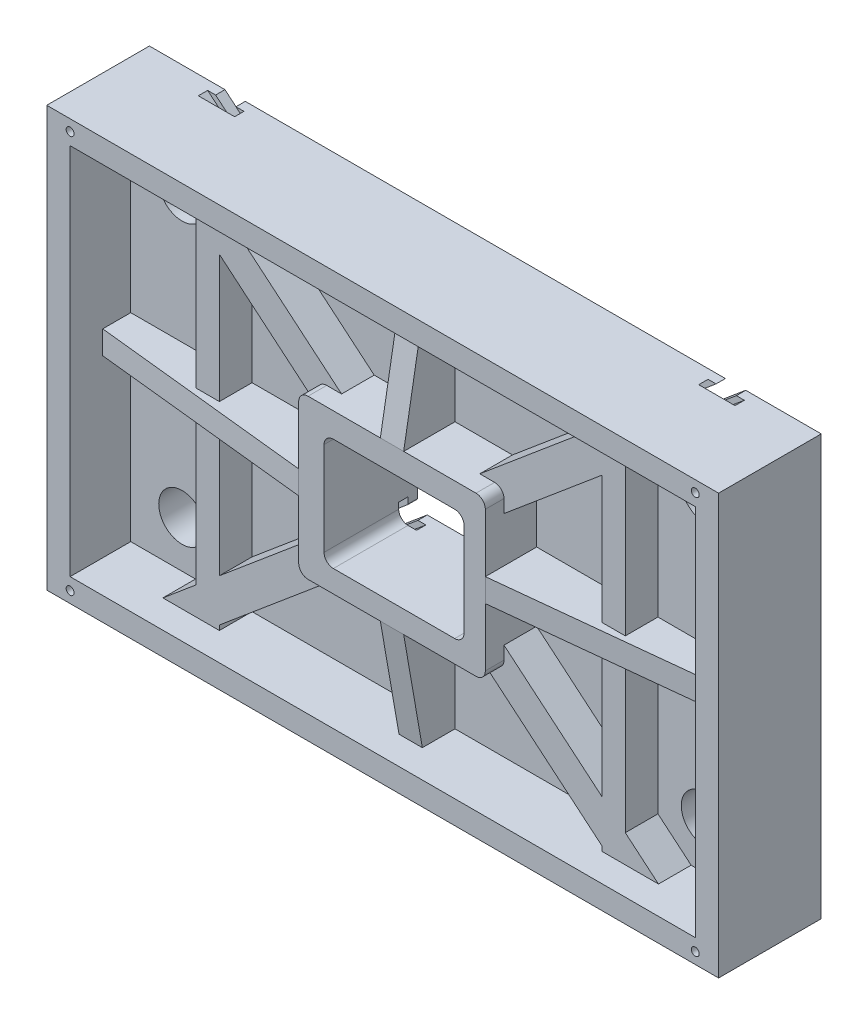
ISO-10303-21;
HEADER;
FILE_DESCRIPTION(('STEP AP214'),'2;1');
FILE_NAME('part.step','',(''),(''),'','','');
FILE_SCHEMA(('AUTOMOTIVE_DESIGN { 1 0 10303 214 1 1 1 1 }'));
ENDSEC;
DATA;
#1=APPLICATION_CONTEXT('core data for automotive mechanical design processes');
#2=APPLICATION_PROTOCOL_DEFINITION('international standard','automotive_design',2000,#1);
#3=PRODUCT_CONTEXT('',#1,'mechanical');
#4=PRODUCT('Part','Part','',(#3));
#5=PRODUCT_RELATED_PRODUCT_CATEGORY('part','',(#4));
#6=PRODUCT_DEFINITION_FORMATION('','',#4);
#7=PRODUCT_DEFINITION_CONTEXT('part definition',#1,'design');
#8=PRODUCT_DEFINITION('design','',#6,#7);
#9=PRODUCT_DEFINITION_SHAPE('','',#8);
#10=(LENGTH_UNIT() NAMED_UNIT(*) SI_UNIT(.MILLI.,.METRE.));
#11=(NAMED_UNIT(*) PLANE_ANGLE_UNIT() SI_UNIT($,.RADIAN.));
#12=(NAMED_UNIT(*) SI_UNIT($,.STERADIAN.) SOLID_ANGLE_UNIT());
#13=UNCERTAINTY_MEASURE_WITH_UNIT(LENGTH_MEASURE(1.E-05),#10,'distance_accuracy_value','');
#14=(GEOMETRIC_REPRESENTATION_CONTEXT(3) GLOBAL_UNCERTAINTY_ASSIGNED_CONTEXT((#13)) GLOBAL_UNIT_ASSIGNED_CONTEXT((#10,
#11,#12)) REPRESENTATION_CONTEXT('',''));
#15=CARTESIAN_POINT('',(0.,0.,0.));
#16=DIRECTION('',(0.,0.,1.));
#17=DIRECTION('',(1.,0.,0.));
#18=AXIS2_PLACEMENT_3D('',#15,#16,#17);
#19=CARTESIAN_POINT('',(335.,200.,45.));
#20=DIRECTION('',(0.,1.,0.));
#21=DIRECTION('',(-1.,0.,0.));
#22=AXIS2_PLACEMENT_3D('',#19,#20,#21);
#23=PLANE('',#22);
#24=DIRECTION('',(0.,0.,-1.));
#25=VECTOR('',#24,1.);
#26=CARTESIAN_POINT('',(-265.5758854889,199.999999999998,316.592172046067));
#27=LINE('',#26,#25);
#28=CARTESIAN_POINT('',(-265.5758854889,200.,80.));
#29=VERTEX_POINT('',#28);
#30=CARTESIAN_POINT('',(-265.5758854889,200.,45.));
#31=VERTEX_POINT('',#30);
#32=EDGE_CURVE('E797',#29,#31,#27,.T.);
#33=ORIENTED_EDGE('',*,*,#32,.F.);
#34=DIRECTION('',(1.,0.,0.));
#35=VECTOR('',#34,1.);
#36=CARTESIAN_POINT('',(-230.,200.,80.));
#37=LINE('',#36,#35);
#38=CARTESIAN_POINT('',(-205.,200.,80.));
#39=VERTEX_POINT('',#38);
#40=EDGE_CURVE('E57',#29,#39,#37,.T.);
#41=ORIENTED_EDGE('',*,*,#40,.T.);
#42=DIRECTION('',(0.,0.,1.));
#43=VECTOR('',#42,1.);
#44=CARTESIAN_POINT('',(-205.,200.,0.));
#45=LINE('',#44,#43);
#46=CARTESIAN_POINT('',(-205.,200.,45.));
#47=VERTEX_POINT('',#46);
#48=EDGE_CURVE('E1182',#47,#39,#45,.T.);
#49=ORIENTED_EDGE('',*,*,#48,.F.);
#50=DIRECTION('',(-1.,0.,0.));
#51=VECTOR('',#50,1.);
#52=CARTESIAN_POINT('',(335.,200.,45.));
#53=LINE('',#52,#51);
#54=CARTESIAN_POINT('',(-12.5,200.,45.));
#55=VERTEX_POINT('',#54);
#56=EDGE_CURVE('E1413',#55,#47,#53,.T.);
#57=ORIENTED_EDGE('',*,*,#56,.F.);
#58=DIRECTION('',(0.,0.,1.));
#59=VECTOR('',#58,1.);
#60=CARTESIAN_POINT('',(-12.5,200.,45.));
#61=LINE('',#60,#59);
#62=CARTESIAN_POINT('',(-12.5,200.,80.));
#63=VERTEX_POINT('',#62);
#64=EDGE_CURVE('E1211',#55,#63,#61,.T.);
#65=ORIENTED_EDGE('',*,*,#64,.T.);
#66=DIRECTION('',(1.,0.,0.));
#67=VECTOR('',#66,1.);
#68=CARTESIAN_POINT('',(-12.5,200.,80.));
#69=LINE('',#68,#67);
#70=CARTESIAN_POINT('',(12.5,200.,80.));
#71=VERTEX_POINT('',#70);
#72=EDGE_CURVE('E1215',#63,#71,#69,.T.);
#73=ORIENTED_EDGE('',*,*,#72,.T.);
#74=DIRECTION('',(0.,0.,1.));
#75=VECTOR('',#74,1.);
#76=CARTESIAN_POINT('',(12.5,200.,45.));
#77=LINE('',#76,#75);
#78=CARTESIAN_POINT('',(12.5,200.,45.));
#79=VERTEX_POINT('',#78);
#80=EDGE_CURVE('E1200',#79,#71,#77,.T.);
#81=ORIENTED_EDGE('',*,*,#80,.F.);
#82=CARTESIAN_POINT('',(205.,200.,45.));
#83=VERTEX_POINT('',#82);
#84=EDGE_CURVE('E1412',#83,#79,#53,.T.);
#85=ORIENTED_EDGE('',*,*,#84,.F.);
#86=DIRECTION('',(0.,0.,1.));
#87=VECTOR('',#86,1.);
#88=CARTESIAN_POINT('',(205.,200.,45.));
#89=LINE('',#88,#87);
#90=CARTESIAN_POINT('',(205.,200.,80.));
#91=VERTEX_POINT('',#90);
#92=EDGE_CURVE('E1130',#83,#91,#89,.T.);
#93=ORIENTED_EDGE('',*,*,#92,.T.);
#94=DIRECTION('',(-1.,0.,0.));
#95=VECTOR('',#94,1.);
#96=CARTESIAN_POINT('',(230.,200.,80.));
#97=LINE('',#96,#95);
#98=CARTESIAN_POINT('',(265.575885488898,200.,80.));
#99=VERTEX_POINT('',#98);
#100=EDGE_CURVE('E1140',#99,#91,#97,.T.);
#101=ORIENTED_EDGE('',*,*,#100,.F.);
#102=DIRECTION('',(0.,0.,-1.));
#103=VECTOR('',#102,1.);
#104=CARTESIAN_POINT('',(265.575885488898,200.,316.592172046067));
#105=LINE('',#104,#103);
#106=CARTESIAN_POINT('',(265.575885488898,200.,45.));
#107=VERTEX_POINT('',#106);
#108=EDGE_CURVE('E821',#99,#107,#105,.T.);
#109=ORIENTED_EDGE('',*,*,#108,.T.);
#110=CARTESIAN_POINT('',(335.,200.,45.));
#111=VERTEX_POINT('',#110);
#112=EDGE_CURVE('E1408',#111,#107,#53,.T.);
#113=ORIENTED_EDGE('',*,*,#112,.F.);
#114=DIRECTION('',(0.,0.,1.));
#115=VECTOR('',#114,1.);
#116=CARTESIAN_POINT('',(335.,200.,45.));
#117=LINE('',#116,#115);
#118=CARTESIAN_POINT('',(335.,200.,110.));
#119=VERTEX_POINT('',#118);
#120=EDGE_CURVE('E1427',#111,#119,#117,.T.);
#121=ORIENTED_EDGE('',*,*,#120,.T.);
#122=DIRECTION('',(-1.,0.,0.));
#123=VECTOR('',#122,1.);
#124=CARTESIAN_POINT('',(335.,200.,110.));
#125=LINE('',#124,#123);
#126=CARTESIAN_POINT('',(-335.,200.,110.));
#127=VERTEX_POINT('',#126);
#128=EDGE_CURVE('E1421',#119,#127,#125,.T.);
#129=ORIENTED_EDGE('',*,*,#128,.T.);
#130=DIRECTION('',(0.,0.,1.));
#131=VECTOR('',#130,1.);
#132=CARTESIAN_POINT('',(-335.,200.,45.));
#133=LINE('',#132,#131);
#134=CARTESIAN_POINT('',(-335.,200.,45.));
#135=VERTEX_POINT('',#134);
#136=EDGE_CURVE('E1424',#135,#127,#133,.T.);
#137=ORIENTED_EDGE('',*,*,#136,.F.);
#138=EDGE_CURVE('E1407',#31,#135,#53,.T.);
#139=ORIENTED_EDGE('',*,*,#138,.F.);
#140=EDGE_LOOP('',(#33,#41,#49,#57,#65,#73,#81,#85,#93,#101,#109,#113,#121,#129,#137,#139));
#141=FACE_BOUND('',#140,.T.);
#142=ADVANCED_FACE('F42',(#141),#23,.F.);
#143=CARTESIAN_POINT('',(0.,0.,45.));
#144=DIRECTION('',(0.,0.,-1.));
#145=DIRECTION('',(-1.,0.,0.));
#146=AXIS2_PLACEMENT_3D('',#143,#144,#145);
#147=PLANE('',#146);
#148=DIRECTION('',(0.766044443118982,-0.642787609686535,0.));
#149=VECTOR('',#148,1.);
#150=CARTESIAN_POINT('',(-265.5758854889,199.999999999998,45.));
#151=LINE('',#150,#149);
#152=CARTESIAN_POINT('',(-205.,149.170796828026,45.));
#153=VERTEX_POINT('',#152);
#154=CARTESIAN_POINT('',(-100.,61.0653355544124,45.));
#155=VERTEX_POINT('',#154);
#156=EDGE_CURVE('E790',#153,#155,#151,.T.);
#157=ORIENTED_EDGE('',*,*,#156,.F.);
#158=DIRECTION('',(0.,1.,0.));
#159=VECTOR('',#158,1.);
#160=CARTESIAN_POINT('',(-205.,0.,45.));
#161=LINE('',#160,#159);
#162=CARTESIAN_POINT('',(-205.,12.5,45.));
#163=VERTEX_POINT('',#162);
#164=EDGE_CURVE('E1173',#163,#153,#161,.T.);
#165=ORIENTED_EDGE('',*,*,#164,.F.);
#166=DIRECTION('',(-1.,0.,0.));
#167=VECTOR('',#166,1.);
#168=CARTESIAN_POINT('',(-335.,12.5,45.));
#169=LINE('',#168,#167);
#170=CARTESIAN_POINT('',(-100.,12.5,45.));
#171=VERTEX_POINT('',#170);
#172=EDGE_CURVE('E1254',#171,#163,#169,.T.);
#173=ORIENTED_EDGE('',*,*,#172,.F.);
#174=DIRECTION('',(0.,-1.,0.));
#175=VECTOR('',#174,1.);
#176=CARTESIAN_POINT('',(-100.,75.,45.));
#177=LINE('',#176,#175);
#178=EDGE_CURVE('E1336',#155,#171,#177,.T.);
#179=ORIENTED_EDGE('',*,*,#178,.F.);
#180=EDGE_LOOP('',(#157,#165,#173,#179));
#181=FACE_BOUND('',#180,.T.);
#182=ADVANCED_FACE('F1639',(#181),#147,.F.);
#183=DIRECTION('',(-0.766044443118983,0.642787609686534,0.));
#184=VECTOR('',#183,1.);
#185=CARTESIAN_POINT('',(-211.125551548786,199.999999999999,45.));
#186=LINE('',#185,#184);
#187=CARTESIAN_POINT('',(-74.0738884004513,85.,45.));
#188=VERTEX_POINT('',#187);
#189=CARTESIAN_POINT('',(-205.,194.860051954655,45.));
#190=VERTEX_POINT('',#189);
#191=EDGE_CURVE('E775',#188,#190,#186,.T.);
#192=ORIENTED_EDGE('',*,*,#191,.F.);
#193=DIRECTION('',(-1.,0.,0.));
#194=VECTOR('',#193,1.);
#195=CARTESIAN_POINT('',(89.9999999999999,85.,45.));
#196=LINE('',#195,#194);
#197=CARTESIAN_POINT('',(-12.5,85.,45.));
#198=VERTEX_POINT('',#197);
#199=EDGE_CURVE('E1364',#198,#188,#196,.T.);
#200=ORIENTED_EDGE('',*,*,#199,.F.);
#201=DIRECTION('',(0.,1.,0.));
#202=VECTOR('',#201,1.);
#203=CARTESIAN_POINT('',(-12.5,85.,45.));
#204=LINE('',#203,#202);
#205=EDGE_CURVE('E1208',#198,#55,#204,.T.);
#206=ORIENTED_EDGE('',*,*,#205,.T.);
#207=ORIENTED_EDGE('',*,*,#56,.T.);
#208=EDGE_CURVE('E1185',#190,#47,#161,.T.);
#209=ORIENTED_EDGE('',*,*,#208,.F.);
#210=EDGE_LOOP('',(#192,#200,#206,#207,#209));
#211=FACE_BOUND('',#210,.T.);
#212=ADVANCED_FACE('F1615',(#211),#147,.F.);
#213=CARTESIAN_POINT('',(-279.999999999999,150.000000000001,45.));
#214=DIRECTION('',(0.,0.,-1.));
#215=DIRECTION('',(-1.,0.,0.));
#216=AXIS2_PLACEMENT_3D('',#213,#214,#215);
#217=CIRCLE('',#216,25.0000000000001);
#218=CARTESIAN_POINT('',(-304.999999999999,150.000000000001,45.));
#219=VERTEX_POINT('',#218);
#220=EDGE_CURVE('E1426',#219,#219,#217,.T.);
#221=ORIENTED_EDGE('',*,*,#220,.T.);
#222=EDGE_LOOP('',(#221));
#223=FACE_BOUND('',#222,.T.);
#224=CARTESIAN_POINT('',(-230.,170.148287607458,45.));
#225=VERTEX_POINT('',#224);
#226=EDGE_CURVE('E65',#31,#225,#151,.T.);
#227=ORIENTED_EDGE('',*,*,#226,.F.);
#228=ORIENTED_EDGE('',*,*,#138,.T.);
#229=DIRECTION('',(0.,-1.,0.));
#230=VECTOR('',#229,1.);
#231=CARTESIAN_POINT('',(-335.,200.,45.));
#232=LINE('',#231,#230);
#233=CARTESIAN_POINT('',(-335.,12.5,45.));
#234=VERTEX_POINT('',#233);
#235=EDGE_CURVE('E1393',#135,#234,#232,.T.);
#236=ORIENTED_EDGE('',*,*,#235,.T.);
#237=CARTESIAN_POINT('',(-230.,12.5,45.));
#238=VERTEX_POINT('',#237);
#239=EDGE_CURVE('E1253',#238,#234,#169,.T.);
#240=ORIENTED_EDGE('',*,*,#239,.F.);
#241=DIRECTION('',(0.,1.,0.));
#242=VECTOR('',#241,1.);
#243=CARTESIAN_POINT('',(-230.,0.,45.));
#244=LINE('',#243,#242);
#245=EDGE_CURVE('E1175',#238,#225,#244,.T.);
#246=ORIENTED_EDGE('',*,*,#245,.T.);
#247=EDGE_LOOP('',(#227,#228,#236,#240,#246));
#248=FACE_BOUND('',#247,.T.);
#249=ADVANCED_FACE('F1676',(#223,#248),#147,.F.);
#250=CARTESIAN_POINT('',(89.9999999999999,85.,100.));
#251=DIRECTION('',(0.,-1.,0.));
#252=DIRECTION('',(1.,0.,0.));
#253=AXIS2_PLACEMENT_3D('',#250,#251,#252);
#254=PLANE('',#253);
#255=DIRECTION('',(0.,0.,-1.));
#256=VECTOR('',#255,1.);
#257=CARTESIAN_POINT('',(-74.0738884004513,85.,316.592172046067));
#258=LINE('',#257,#256);
#259=CARTESIAN_POINT('',(-74.0738884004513,85.,80.));
#260=VERTEX_POINT('',#259);
#261=EDGE_CURVE('E792',#260,#188,#258,.T.);
#262=ORIENTED_EDGE('',*,*,#261,.F.);
#263=DIRECTION('',(-1.,0.,0.));
#264=VECTOR('',#263,1.);
#265=CARTESIAN_POINT('',(-74.0738884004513,85.,80.));
#266=LINE('',#265,#264);
#267=CARTESIAN_POINT('',(-90.,85.,80.));
#268=VERTEX_POINT('',#267);
#269=EDGE_CURVE('E780',#260,#268,#266,.T.);
#270=ORIENTED_EDGE('',*,*,#269,.T.);
#271=DIRECTION('',(0.,0.,-1.));
#272=VECTOR('',#271,1.);
#273=CARTESIAN_POINT('',(-90.,85.,100.));
#274=LINE('',#273,#272);
#275=CARTESIAN_POINT('',(-90.,85.,100.));
#276=VERTEX_POINT('',#275);
#277=EDGE_CURVE('E1374',#276,#268,#274,.T.);
#278=ORIENTED_EDGE('',*,*,#277,.F.);
#279=DIRECTION('',(-1.,0.,0.));
#280=VECTOR('',#279,1.);
#281=CARTESIAN_POINT('',(89.9999999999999,85.,100.));
#282=LINE('',#281,#280);
#283=CARTESIAN_POINT('',(-12.5,85.,100.));
#284=VERTEX_POINT('',#283);
#285=EDGE_CURVE('E1348',#284,#276,#282,.T.);
#286=ORIENTED_EDGE('',*,*,#285,.F.);
#287=DIRECTION('',(0.,0.,-1.));
#288=VECTOR('',#287,1.);
#289=CARTESIAN_POINT('',(-12.5,85.,100.));
#290=LINE('',#289,#288);
#291=EDGE_CURVE('E1205',#284,#198,#290,.T.);
#292=ORIENTED_EDGE('',*,*,#291,.T.);
#293=ORIENTED_EDGE('',*,*,#199,.T.);
#294=EDGE_LOOP('',(#262,#270,#278,#286,#292,#293));
#295=FACE_BOUND('',#294,.T.);
#296=ADVANCED_FACE('F1612',(#295),#254,.F.);
#297=CARTESIAN_POINT('',(-90.,75.,100.));
#298=DIRECTION('',(0.,0.,-1.));
#299=DIRECTION('',(-1.,0.,0.));
#300=AXIS2_PLACEMENT_3D('',#297,#298,#299);
#301=CYLINDRICAL_SURFACE('',#300,10.);
#302=CARTESIAN_POINT('',(-90.,75.,80.));
#303=DIRECTION('',(0.,0.,-1.));
#304=DIRECTION('',(0.,1.,0.));
#305=AXIS2_PLACEMENT_3D('',#302,#303,#304);
#306=CIRCLE('',#305,9.99999999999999);
#307=CARTESIAN_POINT('',(-100.,75.,80.));
#308=VERTEX_POINT('',#307);
#309=EDGE_CURVE('E776',#268,#308,#306,.F.);
#310=ORIENTED_EDGE('',*,*,#309,.T.);
#311=DIRECTION('',(0.,0.,-1.));
#312=VECTOR('',#311,1.);
#313=CARTESIAN_POINT('',(-100.,75.,100.));
#314=LINE('',#313,#312);
#315=CARTESIAN_POINT('',(-100.,75.,100.));
#316=VERTEX_POINT('',#315);
#317=EDGE_CURVE('E1371',#316,#308,#314,.T.);
#318=ORIENTED_EDGE('',*,*,#317,.F.);
#319=CARTESIAN_POINT('',(-90.,75.,100.));
#320=DIRECTION('',(0.,0.,1.));
#321=DIRECTION('',(1.,0.,0.));
#322=AXIS2_PLACEMENT_3D('',#319,#320,#321);
#323=CIRCLE('',#322,10.);
#324=EDGE_CURVE('E1352',#276,#316,#323,.T.);
#325=ORIENTED_EDGE('',*,*,#324,.F.);
#326=ORIENTED_EDGE('',*,*,#277,.T.);
#327=EDGE_LOOP('',(#310,#318,#325,#326));
#328=FACE_BOUND('',#327,.T.);
#329=ADVANCED_FACE('F1650',(#328),#301,.T.);
#330=CARTESIAN_POINT('',(-100.,75.,100.));
#331=DIRECTION('',(1.,0.,0.));
#332=DIRECTION('',(0.,1.,0.));
#333=AXIS2_PLACEMENT_3D('',#330,#331,#332);
#334=PLANE('',#333);
#335=DIRECTION('',(0.,0.,-1.));
#336=VECTOR('',#335,1.);
#337=CARTESIAN_POINT('',(-100.,61.0653355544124,316.592172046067));
#338=LINE('',#337,#336);
#339=CARTESIAN_POINT('',(-100.,61.0653355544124,80.));
#340=VERTEX_POINT('',#339);
#341=EDGE_CURVE('E794',#340,#155,#338,.T.);
#342=ORIENTED_EDGE('',*,*,#341,.T.);
#343=ORIENTED_EDGE('',*,*,#178,.T.);
#344=DIRECTION('',(0.,0.,-1.));
#345=VECTOR('',#344,1.);
#346=CARTESIAN_POINT('',(-100.,12.5,100.));
#347=LINE('',#346,#345);
#348=CARTESIAN_POINT('',(-100.,12.5,100.));
#349=VERTEX_POINT('',#348);
#350=EDGE_CURVE('E1250',#349,#171,#347,.T.);
#351=ORIENTED_EDGE('',*,*,#350,.F.);
#352=DIRECTION('',(0.,-1.,0.));
#353=VECTOR('',#352,1.);
#354=CARTESIAN_POINT('',(-100.,75.,100.));
#355=LINE('',#354,#353);
#356=EDGE_CURVE('E1355',#316,#349,#355,.T.);
#357=ORIENTED_EDGE('',*,*,#356,.F.);
#358=ORIENTED_EDGE('',*,*,#317,.T.);
#359=DIRECTION('',(0.,-1.,0.));
#360=VECTOR('',#359,1.);
#361=CARTESIAN_POINT('',(-100.,74.9999999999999,80.));
#362=LINE('',#361,#360);
#363=EDGE_CURVE('E779',#308,#340,#362,.T.);
#364=ORIENTED_EDGE('',*,*,#363,.T.);
#365=EDGE_LOOP('',(#342,#343,#351,#357,#358,#364));
#366=FACE_BOUND('',#365,.T.);
#367=ADVANCED_FACE('F1645',(#366),#334,.F.);
#368=CARTESIAN_POINT('',(-230.,0.,0.));
#369=DIRECTION('',(-1.,0.,0.));
#370=DIRECTION('',(0.,-1.,0.));
#371=AXIS2_PLACEMENT_3D('',#368,#369,#370);
#372=PLANE('',#371);
#373=DIRECTION('',(0.,1.,0.));
#374=VECTOR('',#373,1.);
#375=CARTESIAN_POINT('',(-230.,0.,80.));
#376=LINE('',#375,#374);
#377=CARTESIAN_POINT('',(-230.,12.5,80.));
#378=VERTEX_POINT('',#377);
#379=CARTESIAN_POINT('',(-230.,170.148287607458,80.));
#380=VERTEX_POINT('',#379);
#381=EDGE_CURVE('E1172',#378,#380,#376,.T.);
#382=ORIENTED_EDGE('',*,*,#381,.T.);
#383=DIRECTION('',(0.,0.,-1.));
#384=VECTOR('',#383,1.);
#385=CARTESIAN_POINT('',(-230.,170.148287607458,0.));
#386=LINE('',#385,#384);
#387=EDGE_CURVE('E788',#380,#225,#386,.T.);
#388=ORIENTED_EDGE('',*,*,#387,.T.);
#389=ORIENTED_EDGE('',*,*,#245,.F.);
#390=DIRECTION('',(0.,0.,-1.));
#391=VECTOR('',#390,1.);
#392=CARTESIAN_POINT('',(-230.,12.5,0.));
#393=LINE('',#392,#391);
#394=EDGE_CURVE('E1169',#378,#238,#393,.T.);
#395=ORIENTED_EDGE('',*,*,#394,.F.);
#396=EDGE_LOOP('',(#382,#388,#389,#395));
#397=FACE_BOUND('',#396,.T.);
#398=ADVANCED_FACE('F1628',(#397),#372,.T.);
#399=CARTESIAN_POINT('',(-205.,0.,0.));
#400=DIRECTION('',(-1.,0.,0.));
#401=DIRECTION('',(0.,-1.,0.));
#402=AXIS2_PLACEMENT_3D('',#399,#400,#401);
#403=PLANE('',#402);
#404=DIRECTION('',(0.,0.,-1.));
#405=VECTOR('',#404,1.);
#406=CARTESIAN_POINT('',(-205.,149.170796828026,0.));
#407=LINE('',#406,#405);
#408=CARTESIAN_POINT('',(-205.,149.170796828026,80.));
#409=VERTEX_POINT('',#408);
#410=EDGE_CURVE('E11',#409,#153,#407,.T.);
#411=ORIENTED_EDGE('',*,*,#410,.F.);
#412=DIRECTION('',(0.,1.,0.));
#413=VECTOR('',#412,1.);
#414=CARTESIAN_POINT('',(-205.,0.,80.));
#415=LINE('',#414,#413);
#416=CARTESIAN_POINT('',(-205.,12.5,80.));
#417=VERTEX_POINT('',#416);
#418=EDGE_CURVE('E1179',#417,#409,#415,.T.);
#419=ORIENTED_EDGE('',*,*,#418,.F.);
#420=DIRECTION('',(0.,0.,-1.));
#421=VECTOR('',#420,1.);
#422=CARTESIAN_POINT('',(-205.,12.5,0.));
#423=LINE('',#422,#421);
#424=EDGE_CURVE('E1168',#417,#163,#423,.T.);
#425=ORIENTED_EDGE('',*,*,#424,.T.);
#426=ORIENTED_EDGE('',*,*,#164,.T.);
#427=EDGE_LOOP('',(#411,#419,#425,#426));
#428=FACE_BOUND('',#427,.T.);
#429=ADVANCED_FACE('F1636',(#428),#403,.F.);
#430=DIRECTION('',(0.,0.,1.));
#431=VECTOR('',#430,1.);
#432=CARTESIAN_POINT('',(-205.,194.860051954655,0.));
#433=LINE('',#432,#431);
#434=CARTESIAN_POINT('',(-205.,194.860051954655,80.));
#435=VERTEX_POINT('',#434);
#436=EDGE_CURVE('E50',#190,#435,#433,.T.);
#437=ORIENTED_EDGE('',*,*,#436,.F.);
#438=ORIENTED_EDGE('',*,*,#208,.T.);
#439=ORIENTED_EDGE('',*,*,#48,.T.);
#440=EDGE_CURVE('E1178',#435,#39,#415,.T.);
#441=ORIENTED_EDGE('',*,*,#440,.F.);
#442=EDGE_LOOP('',(#437,#438,#439,#441));
#443=FACE_BOUND('',#442,.T.);
#444=ADVANCED_FACE('F1605',(#443),#403,.F.);
#445=DIRECTION('',(0.766044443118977,0.642787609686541,0.));
#446=VECTOR('',#445,1.);
#447=CARTESIAN_POINT('',(265.575885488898,200.,45.));
#448=LINE('',#447,#446);
#449=CARTESIAN_POINT('',(100.,61.0653355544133,45.));
#450=VERTEX_POINT('',#449);
#451=CARTESIAN_POINT('',(205.,149.170796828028,45.));
#452=VERTEX_POINT('',#451);
#453=EDGE_CURVE('E819',#450,#452,#448,.T.);
#454=ORIENTED_EDGE('',*,*,#453,.F.);
#455=DIRECTION('',(0.,1.,0.));
#456=VECTOR('',#455,1.);
#457=CARTESIAN_POINT('',(100.,75.,45.));
#458=LINE('',#457,#456);
#459=CARTESIAN_POINT('',(100.,12.5,45.));
#460=VERTEX_POINT('',#459);
#461=EDGE_CURVE('E1361',#460,#450,#458,.T.);
#462=ORIENTED_EDGE('',*,*,#461,.F.);
#463=DIRECTION('',(-1.,0.,0.));
#464=VECTOR('',#463,1.);
#465=CARTESIAN_POINT('',(100.,12.5,45.));
#466=LINE('',#465,#464);
#467=CARTESIAN_POINT('',(205.,12.5,45.));
#468=VERTEX_POINT('',#467);
#469=EDGE_CURVE('E1284',#468,#460,#466,.T.);
#470=ORIENTED_EDGE('',*,*,#469,.F.);
#471=DIRECTION('',(0.,1.,0.));
#472=VECTOR('',#471,1.);
#473=CARTESIAN_POINT('',(205.,12.5,45.));
#474=LINE('',#473,#472);
#475=EDGE_CURVE('E1127',#468,#452,#474,.T.);
#476=ORIENTED_EDGE('',*,*,#475,.T.);
#477=EDGE_LOOP('',(#454,#462,#470,#476));
#478=FACE_BOUND('',#477,.T.);
#479=ADVANCED_FACE('F1859',(#478),#147,.F.);
#480=DIRECTION('',(-0.766044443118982,-0.642787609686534,0.));
#481=VECTOR('',#480,1.);
#482=CARTESIAN_POINT('',(211.125551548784,200.,45.));
#483=LINE('',#482,#481);
#484=CARTESIAN_POINT('',(205.,194.860051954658,45.));
#485=VERTEX_POINT('',#484);
#486=CARTESIAN_POINT('',(74.0738884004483,85.,45.));
#487=VERTEX_POINT('',#486);
#488=EDGE_CURVE('E803',#485,#487,#483,.T.);
#489=ORIENTED_EDGE('',*,*,#488,.F.);
#490=EDGE_CURVE('E1116',#485,#83,#474,.T.);
#491=ORIENTED_EDGE('',*,*,#490,.T.);
#492=ORIENTED_EDGE('',*,*,#84,.T.);
#493=DIRECTION('',(0.,1.,0.));
#494=VECTOR('',#493,1.);
#495=CARTESIAN_POINT('',(12.5,85.,45.));
#496=LINE('',#495,#494);
#497=CARTESIAN_POINT('',(12.5,85.,45.));
#498=VERTEX_POINT('',#497);
#499=EDGE_CURVE('E1197',#498,#79,#496,.T.);
#500=ORIENTED_EDGE('',*,*,#499,.F.);
#501=EDGE_CURVE('E1365',#487,#498,#196,.T.);
#502=ORIENTED_EDGE('',*,*,#501,.F.);
#503=EDGE_LOOP('',(#489,#491,#492,#500,#502));
#504=FACE_BOUND('',#503,.T.);
#505=ADVANCED_FACE('F1672',(#504),#147,.F.);
#506=CARTESIAN_POINT('',(100.,75.,100.));
#507=DIRECTION('',(-1.,0.,0.));
#508=DIRECTION('',(0.,-1.,0.));
#509=AXIS2_PLACEMENT_3D('',#506,#507,#508);
#510=PLANE('',#509);
#511=DIRECTION('',(0.,0.,-1.));
#512=VECTOR('',#511,1.);
#513=CARTESIAN_POINT('',(100.,61.0653355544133,316.592172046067));
#514=LINE('',#513,#512);
#515=CARTESIAN_POINT('',(100.,61.0653355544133,80.));
#516=VERTEX_POINT('',#515);
#517=EDGE_CURVE('E823',#516,#450,#514,.T.);
#518=ORIENTED_EDGE('',*,*,#517,.F.);
#519=DIRECTION('',(0.,1.,0.));
#520=VECTOR('',#519,1.);
#521=CARTESIAN_POINT('',(100.,61.0653355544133,80.));
#522=LINE('',#521,#520);
#523=CARTESIAN_POINT('',(100.,75.,80.));
#524=VERTEX_POINT('',#523);
#525=EDGE_CURVE('E804',#516,#524,#522,.T.);
#526=ORIENTED_EDGE('',*,*,#525,.T.);
#527=DIRECTION('',(0.,0.,-1.));
#528=VECTOR('',#527,1.);
#529=CARTESIAN_POINT('',(100.,75.,100.));
#530=LINE('',#529,#528);
#531=CARTESIAN_POINT('',(100.,75.,100.));
#532=VERTEX_POINT('',#531);
#533=EDGE_CURVE('E1380',#532,#524,#530,.T.);
#534=ORIENTED_EDGE('',*,*,#533,.F.);
#535=DIRECTION('',(0.,1.,0.));
#536=VECTOR('',#535,1.);
#537=CARTESIAN_POINT('',(100.,75.,100.));
#538=LINE('',#537,#536);
#539=CARTESIAN_POINT('',(100.,12.5,100.));
#540=VERTEX_POINT('',#539);
#541=EDGE_CURVE('E1342',#540,#532,#538,.T.);
#542=ORIENTED_EDGE('',*,*,#541,.F.);
#543=DIRECTION('',(0.,0.,1.));
#544=VECTOR('',#543,1.);
#545=CARTESIAN_POINT('',(100.,12.5,100.));
#546=LINE('',#545,#544);
#547=EDGE_CURVE('E1288',#460,#540,#546,.T.);
#548=ORIENTED_EDGE('',*,*,#547,.F.);
#549=ORIENTED_EDGE('',*,*,#461,.T.);
#550=EDGE_LOOP('',(#518,#526,#534,#542,#548,#549));
#551=FACE_BOUND('',#550,.T.);
#552=ADVANCED_FACE('F1842',(#551),#510,.F.);
#553=CARTESIAN_POINT('',(280.,150.,45.));
#554=DIRECTION('',(0.,0.,-1.));
#555=DIRECTION('',(-1.,0.,0.));
#556=AXIS2_PLACEMENT_3D('',#553,#554,#555);
#557=CIRCLE('',#556,25.);
#558=CARTESIAN_POINT('',(255.,150.,45.));
#559=VERTEX_POINT('',#558);
#560=EDGE_CURVE('E1438',#559,#559,#557,.T.);
#561=ORIENTED_EDGE('',*,*,#560,.T.);
#562=EDGE_LOOP('',(#561));
#563=FACE_BOUND('',#562,.T.);
#564=CARTESIAN_POINT('',(230.,170.14828760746,45.));
#565=VERTEX_POINT('',#564);
#566=EDGE_CURVE('E818',#565,#107,#448,.T.);
#567=ORIENTED_EDGE('',*,*,#566,.F.);
#568=DIRECTION('',(0.,1.,0.));
#569=VECTOR('',#568,1.);
#570=CARTESIAN_POINT('',(230.,12.5,45.));
#571=LINE('',#570,#569);
#572=CARTESIAN_POINT('',(230.,12.5,45.));
#573=VERTEX_POINT('',#572);
#574=EDGE_CURVE('E1117',#573,#565,#571,.T.);
#575=ORIENTED_EDGE('',*,*,#574,.F.);
#576=CARTESIAN_POINT('',(335.,12.5,45.));
#577=VERTEX_POINT('',#576);
#578=EDGE_CURVE('E1285',#577,#573,#466,.T.);
#579=ORIENTED_EDGE('',*,*,#578,.F.);
#580=DIRECTION('',(0.,1.,0.));
#581=VECTOR('',#580,1.);
#582=CARTESIAN_POINT('',(335.,200.,45.));
#583=LINE('',#582,#581);
#584=EDGE_CURVE('E1401',#577,#111,#583,.T.);
#585=ORIENTED_EDGE('',*,*,#584,.T.);
#586=ORIENTED_EDGE('',*,*,#112,.T.);
#587=EDGE_LOOP('',(#567,#575,#579,#585,#586));
#588=FACE_BOUND('',#587,.T.);
#589=ADVANCED_FACE('F1851',(#563,#588),#147,.F.);
#590=CARTESIAN_POINT('',(90.,75.0000000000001,100.));
#591=DIRECTION('',(0.,0.,-1.));
#592=DIRECTION('',(-1.,0.,0.));
#593=AXIS2_PLACEMENT_3D('',#590,#591,#592);
#594=CYLINDRICAL_SURFACE('',#593,9.99999999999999);
#595=CARTESIAN_POINT('',(90.,75.0000000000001,80.));
#596=DIRECTION('',(0.,0.,-1.));
#597=DIRECTION('',(0.,1.,0.));
#598=AXIS2_PLACEMENT_3D('',#595,#596,#597);
#599=CIRCLE('',#598,9.99999999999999);
#600=CARTESIAN_POINT('',(90.,85.,80.));
#601=VERTEX_POINT('',#600);
#602=EDGE_CURVE('E807',#524,#601,#599,.F.);
#603=ORIENTED_EDGE('',*,*,#602,.T.);
#604=DIRECTION('',(0.,0.,-1.));
#605=VECTOR('',#604,1.);
#606=CARTESIAN_POINT('',(89.9999999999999,85.,100.));
#607=LINE('',#606,#605);
#608=CARTESIAN_POINT('',(89.9999999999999,85.,100.));
#609=VERTEX_POINT('',#608);
#610=EDGE_CURVE('E1377',#609,#601,#607,.T.);
#611=ORIENTED_EDGE('',*,*,#610,.F.);
#612=CARTESIAN_POINT('',(90.,75.0000000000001,100.));
#613=DIRECTION('',(0.,0.,1.));
#614=DIRECTION('',(-1.,0.,0.));
#615=AXIS2_PLACEMENT_3D('',#612,#613,#614);
#616=CIRCLE('',#615,9.99999999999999);
#617=EDGE_CURVE('E1346',#532,#609,#616,.T.);
#618=ORIENTED_EDGE('',*,*,#617,.F.);
#619=ORIENTED_EDGE('',*,*,#533,.T.);
#620=EDGE_LOOP('',(#603,#611,#618,#619));
#621=FACE_BOUND('',#620,.T.);
#622=ADVANCED_FACE('F2216',(#621),#594,.T.);
#623=DIRECTION('',(0.,0.,-1.));
#624=VECTOR('',#623,1.);
#625=CARTESIAN_POINT('',(74.0738884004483,85.,316.592172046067));
#626=LINE('',#625,#624);
#627=CARTESIAN_POINT('',(74.0738884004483,85.,80.));
#628=VERTEX_POINT('',#627);
#629=EDGE_CURVE('E825',#628,#487,#626,.T.);
#630=ORIENTED_EDGE('',*,*,#629,.T.);
#631=ORIENTED_EDGE('',*,*,#501,.T.);
#632=DIRECTION('',(0.,0.,-1.));
#633=VECTOR('',#632,1.);
#634=CARTESIAN_POINT('',(12.5,85.,100.));
#635=LINE('',#634,#633);
#636=CARTESIAN_POINT('',(12.5,85.,100.));
#637=VERTEX_POINT('',#636);
#638=EDGE_CURVE('E1194',#637,#498,#635,.T.);
#639=ORIENTED_EDGE('',*,*,#638,.F.);
#640=EDGE_CURVE('E1349',#609,#637,#282,.T.);
#641=ORIENTED_EDGE('',*,*,#640,.F.);
#642=ORIENTED_EDGE('',*,*,#610,.T.);
#643=DIRECTION('',(-1.,0.,0.));
#644=VECTOR('',#643,1.);
#645=CARTESIAN_POINT('',(89.9999999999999,85.,80.));
#646=LINE('',#645,#644);
#647=EDGE_CURVE('E811',#601,#628,#646,.T.);
#648=ORIENTED_EDGE('',*,*,#647,.T.);
#649=EDGE_LOOP('',(#630,#631,#639,#641,#642,#648));
#650=FACE_BOUND('',#649,.T.);
#651=ADVANCED_FACE('F1664',(#650),#254,.F.);
#652=CARTESIAN_POINT('',(230.,0.,0.));
#653=DIRECTION('',(1.,0.,0.));
#654=DIRECTION('',(0.,1.,0.));
#655=AXIS2_PLACEMENT_3D('',#652,#653,#654);
#656=PLANE('',#655);
#657=ORIENTED_EDGE('',*,*,#574,.T.);
#658=DIRECTION('',(0.,0.,1.));
#659=VECTOR('',#658,1.);
#660=CARTESIAN_POINT('',(230.,170.14828760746,0.));
#661=LINE('',#660,#659);
#662=CARTESIAN_POINT('',(230.,170.14828760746,80.));
#663=VERTEX_POINT('',#662);
#664=EDGE_CURVE('E816',#565,#663,#661,.T.);
#665=ORIENTED_EDGE('',*,*,#664,.T.);
#666=DIRECTION('',(0.,-1.,0.));
#667=VECTOR('',#666,1.);
#668=CARTESIAN_POINT('',(230.,200.,80.));
#669=LINE('',#668,#667);
#670=CARTESIAN_POINT('',(230.,12.5,80.));
#671=VERTEX_POINT('',#670);
#672=EDGE_CURVE('E1120',#663,#671,#669,.T.);
#673=ORIENTED_EDGE('',*,*,#672,.T.);
#674=DIRECTION('',(0.,0.,-1.));
#675=VECTOR('',#674,1.);
#676=CARTESIAN_POINT('',(230.,12.5,45.));
#677=LINE('',#676,#675);
#678=EDGE_CURVE('E1123',#671,#573,#677,.T.);
#679=ORIENTED_EDGE('',*,*,#678,.T.);
#680=EDGE_LOOP('',(#657,#665,#673,#679));
#681=FACE_BOUND('',#680,.T.);
#682=ADVANCED_FACE('F2158',(#681),#656,.T.);
#683=CARTESIAN_POINT('',(205.,0.,0.));
#684=DIRECTION('',(1.,0.,0.));
#685=DIRECTION('',(0.,1.,0.));
#686=AXIS2_PLACEMENT_3D('',#683,#684,#685);
#687=PLANE('',#686);
#688=DIRECTION('',(0.,0.,1.));
#689=VECTOR('',#688,1.);
#690=CARTESIAN_POINT('',(205.,149.170796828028,0.));
#691=LINE('',#690,#689);
#692=CARTESIAN_POINT('',(205.,149.170796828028,80.));
#693=VERTEX_POINT('',#692);
#694=EDGE_CURVE('E1594',#452,#693,#691,.T.);
#695=ORIENTED_EDGE('',*,*,#694,.F.);
#696=ORIENTED_EDGE('',*,*,#475,.F.);
#697=DIRECTION('',(0.,0.,-1.));
#698=VECTOR('',#697,1.);
#699=CARTESIAN_POINT('',(205.,12.5,45.));
#700=LINE('',#699,#698);
#701=CARTESIAN_POINT('',(205.,12.5000000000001,80.));
#702=VERTEX_POINT('',#701);
#703=EDGE_CURVE('E1121',#702,#468,#700,.T.);
#704=ORIENTED_EDGE('',*,*,#703,.F.);
#705=DIRECTION('',(0.,-1.,0.));
#706=VECTOR('',#705,1.);
#707=CARTESIAN_POINT('',(205.,200.,80.));
#708=LINE('',#707,#706);
#709=EDGE_CURVE('E1133',#693,#702,#708,.T.);
#710=ORIENTED_EDGE('',*,*,#709,.F.);
#711=EDGE_LOOP('',(#695,#696,#704,#710));
#712=FACE_BOUND('',#711,.T.);
#713=ADVANCED_FACE('F2161',(#712),#687,.F.);
#714=DIRECTION('',(0.,0.,-1.));
#715=VECTOR('',#714,1.);
#716=CARTESIAN_POINT('',(205.,194.860051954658,0.));
#717=LINE('',#716,#715);
#718=CARTESIAN_POINT('',(205.,194.860051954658,80.));
#719=VERTEX_POINT('',#718);
#720=EDGE_CURVE('E1592',#719,#485,#717,.T.);
#721=ORIENTED_EDGE('',*,*,#720,.F.);
#722=EDGE_CURVE('E1134',#91,#719,#708,.T.);
#723=ORIENTED_EDGE('',*,*,#722,.F.);
#724=ORIENTED_EDGE('',*,*,#92,.F.);
#725=ORIENTED_EDGE('',*,*,#490,.F.);
#726=EDGE_LOOP('',(#721,#723,#724,#725));
#727=FACE_BOUND('',#726,.T.);
#728=ADVANCED_FACE('F1868',(#727),#687,.F.);
#729=CARTESIAN_POINT('',(335.,-200.,45.));
#730=DIRECTION('',(0.,-1.,0.));
#731=DIRECTION('',(1.,0.,0.));
#732=AXIS2_PLACEMENT_3D('',#729,#730,#731);
#733=PLANE('',#732);
#734=DIRECTION('',(0.,0.,-1.));
#735=VECTOR('',#734,1.);
#736=CARTESIAN_POINT('',(265.5758854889,-200.,316.592172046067));
#737=LINE('',#736,#735);
#738=CARTESIAN_POINT('',(265.5758854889,-200.,80.));
#739=VERTEX_POINT('',#738);
#740=CARTESIAN_POINT('',(265.5758854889,-200.,45.));
#741=VERTEX_POINT('',#740);
#742=EDGE_CURVE('E857',#739,#741,#737,.T.);
#743=ORIENTED_EDGE('',*,*,#742,.F.);
#744=DIRECTION('',(-1.,0.,0.));
#745=VECTOR('',#744,1.);
#746=CARTESIAN_POINT('',(230.,-200.,80.));
#747=LINE('',#746,#745);
#748=CARTESIAN_POINT('',(205.,-200.,80.));
#749=VERTEX_POINT('',#748);
#750=EDGE_CURVE('E1099',#739,#749,#747,.T.);
#751=ORIENTED_EDGE('',*,*,#750,.T.);
#752=DIRECTION('',(0.,0.,-1.));
#753=VECTOR('',#752,1.);
#754=CARTESIAN_POINT('',(205.,-200.,80.));
#755=LINE('',#754,#753);
#756=CARTESIAN_POINT('',(205.,-200.,45.));
#757=VERTEX_POINT('',#756);
#758=EDGE_CURVE('E1095',#749,#757,#755,.T.);
#759=ORIENTED_EDGE('',*,*,#758,.T.);
#760=DIRECTION('',(1.,0.,0.));
#761=VECTOR('',#760,1.);
#762=CARTESIAN_POINT('',(335.,-200.,45.));
#763=LINE('',#762,#761);
#764=CARTESIAN_POINT('',(12.5,-200.,45.));
#765=VERTEX_POINT('',#764);
#766=EDGE_CURVE('E1403',#765,#757,#763,.T.);
#767=ORIENTED_EDGE('',*,*,#766,.F.);
#768=DIRECTION('',(0.,0.,-1.));
#769=VECTOR('',#768,1.);
#770=CARTESIAN_POINT('',(12.5,-200.,45.));
#771=LINE('',#770,#769);
#772=CARTESIAN_POINT('',(12.5,-200.,80.));
#773=VERTEX_POINT('',#772);
#774=EDGE_CURVE('E1223',#773,#765,#771,.T.);
#775=ORIENTED_EDGE('',*,*,#774,.F.);
#776=DIRECTION('',(1.,0.,0.));
#777=VECTOR('',#776,1.);
#778=CARTESIAN_POINT('',(-12.5,-200.,80.));
#779=LINE('',#778,#777);
#780=CARTESIAN_POINT('',(-12.5,-200.,80.));
#781=VERTEX_POINT('',#780);
#782=EDGE_CURVE('E1243',#781,#773,#779,.T.);
#783=ORIENTED_EDGE('',*,*,#782,.F.);
#784=DIRECTION('',(0.,0.,-1.));
#785=VECTOR('',#784,1.);
#786=CARTESIAN_POINT('',(-12.5,-200.,45.));
#787=LINE('',#786,#785);
#788=CARTESIAN_POINT('',(-12.5,-200.,45.));
#789=VERTEX_POINT('',#788);
#790=EDGE_CURVE('E1235',#781,#789,#787,.T.);
#791=ORIENTED_EDGE('',*,*,#790,.T.);
#792=CARTESIAN_POINT('',(-205.,-200.,45.));
#793=VERTEX_POINT('',#792);
#794=EDGE_CURVE('E1402',#793,#789,#763,.T.);
#795=ORIENTED_EDGE('',*,*,#794,.F.);
#796=DIRECTION('',(0.,0.,-1.));
#797=VECTOR('',#796,1.);
#798=CARTESIAN_POINT('',(-205.,-200.,0.));
#799=LINE('',#798,#797);
#800=CARTESIAN_POINT('',(-205.,-200.,80.));
#801=VERTEX_POINT('',#800);
#802=EDGE_CURVE('E1142',#801,#793,#799,.T.);
#803=ORIENTED_EDGE('',*,*,#802,.F.);
#804=DIRECTION('',(1.,0.,0.));
#805=VECTOR('',#804,1.);
#806=CARTESIAN_POINT('',(-230.,-200.,80.));
#807=LINE('',#806,#805);
#808=CARTESIAN_POINT('',(-265.575885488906,-200.,80.));
#809=VERTEX_POINT('',#808);
#810=EDGE_CURVE('E1166',#809,#801,#807,.T.);
#811=ORIENTED_EDGE('',*,*,#810,.F.);
#812=DIRECTION('',(0.,0.,-1.));
#813=VECTOR('',#812,1.);
#814=CARTESIAN_POINT('',(-265.575885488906,-200.,316.592172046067));
#815=LINE('',#814,#813);
#816=CARTESIAN_POINT('',(-265.575885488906,-200.,45.));
#817=VERTEX_POINT('',#816);
#818=EDGE_CURVE('E884',#809,#817,#815,.T.);
#819=ORIENTED_EDGE('',*,*,#818,.T.);
#820=CARTESIAN_POINT('',(-335.,-200.,45.));
#821=VERTEX_POINT('',#820);
#822=EDGE_CURVE('E1398',#821,#817,#763,.T.);
#823=ORIENTED_EDGE('',*,*,#822,.F.);
#824=DIRECTION('',(0.,0.,1.));
#825=VECTOR('',#824,1.);
#826=CARTESIAN_POINT('',(-335.,-200.,45.));
#827=LINE('',#826,#825);
#828=CARTESIAN_POINT('',(-335.,-200.,110.));
#829=VERTEX_POINT('',#828);
#830=EDGE_CURVE('E1411',#821,#829,#827,.T.);
#831=ORIENTED_EDGE('',*,*,#830,.T.);
#832=DIRECTION('',(1.,0.,0.));
#833=VECTOR('',#832,1.);
#834=CARTESIAN_POINT('',(335.,-200.,110.));
#835=LINE('',#834,#833);
#836=CARTESIAN_POINT('',(335.,-200.,110.));
#837=VERTEX_POINT('',#836);
#838=EDGE_CURVE('E1415',#829,#837,#835,.T.);
#839=ORIENTED_EDGE('',*,*,#838,.T.);
#840=DIRECTION('',(0.,0.,1.));
#841=VECTOR('',#840,1.);
#842=CARTESIAN_POINT('',(335.,-200.,45.));
#843=LINE('',#842,#841);
#844=CARTESIAN_POINT('',(335.,-200.,45.));
#845=VERTEX_POINT('',#844);
#846=EDGE_CURVE('E1429',#845,#837,#843,.T.);
#847=ORIENTED_EDGE('',*,*,#846,.F.);
#848=EDGE_CURVE('E1396',#741,#845,#763,.T.);
#849=ORIENTED_EDGE('',*,*,#848,.F.);
#850=EDGE_LOOP('',(#743,#751,#759,#767,#775,#783,#791,#795,#803,#811,#819,#823,#831,#839,#847,#849));
#851=FACE_BOUND('',#850,.T.);
#852=ADVANCED_FACE('F1714',(#851),#733,.F.);
#853=DIRECTION('',(-0.766044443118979,0.642787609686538,0.));
#854=VECTOR('',#853,1.);
#855=CARTESIAN_POINT('',(100.,-61.0653355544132,45.));
#856=LINE('',#855,#854);
#857=CARTESIAN_POINT('',(205.,-149.170796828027,45.));
#858=VERTEX_POINT('',#857);
#859=CARTESIAN_POINT('',(100.,-61.0653355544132,45.));
#860=VERTEX_POINT('',#859);
#861=EDGE_CURVE('E848',#858,#860,#856,.T.);
#862=ORIENTED_EDGE('',*,*,#861,.F.);
#863=DIRECTION('',(0.,1.,0.));
#864=VECTOR('',#863,1.);
#865=CARTESIAN_POINT('',(205.,-200.,45.));
#866=LINE('',#865,#864);
#867=CARTESIAN_POINT('',(205.,-12.5,45.));
#868=VERTEX_POINT('',#867);
#869=EDGE_CURVE('E1091',#858,#868,#866,.T.);
#870=ORIENTED_EDGE('',*,*,#869,.T.);
#871=DIRECTION('',(-1.,0.,0.));
#872=VECTOR('',#871,1.);
#873=CARTESIAN_POINT('',(100.,-12.5,45.));
#874=LINE('',#873,#872);
#875=CARTESIAN_POINT('',(100.,-12.5,45.));
#876=VERTEX_POINT('',#875);
#877=EDGE_CURVE('E1296',#868,#876,#874,.T.);
#878=ORIENTED_EDGE('',*,*,#877,.T.);
#879=EDGE_CURVE('E1362',#860,#876,#458,.T.);
#880=ORIENTED_EDGE('',*,*,#879,.F.);
#881=EDGE_LOOP('',(#862,#870,#878,#880));
#882=FACE_BOUND('',#881,.T.);
#883=ADVANCED_FACE('F1867',(#882),#147,.F.);
#884=DIRECTION('',(0.766044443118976,-0.642787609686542,0.));
#885=VECTOR('',#884,1.);
#886=CARTESIAN_POINT('',(74.0738884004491,-85.,45.));
#887=LINE('',#886,#885);
#888=CARTESIAN_POINT('',(74.0738884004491,-85.,45.));
#889=VERTEX_POINT('',#888);
#890=CARTESIAN_POINT('',(205.,-194.860051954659,45.));
#891=VERTEX_POINT('',#890);
#892=EDGE_CURVE('E833',#889,#891,#887,.T.);
#893=ORIENTED_EDGE('',*,*,#892,.F.);
#894=DIRECTION('',(1.,0.,0.));
#895=VECTOR('',#894,1.);
#896=CARTESIAN_POINT('',(89.9999999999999,-85.,45.));
#897=LINE('',#896,#895);
#898=CARTESIAN_POINT('',(12.5,-85.,45.));
#899=VERTEX_POINT('',#898);
#900=EDGE_CURVE('E1331',#899,#889,#897,.T.);
#901=ORIENTED_EDGE('',*,*,#900,.F.);
#902=DIRECTION('',(0.,1.,0.));
#903=VECTOR('',#902,1.);
#904=CARTESIAN_POINT('',(12.5,-85.,45.));
#905=LINE('',#904,#903);
#906=EDGE_CURVE('E1226',#765,#899,#905,.T.);
#907=ORIENTED_EDGE('',*,*,#906,.F.);
#908=ORIENTED_EDGE('',*,*,#766,.T.);
#909=EDGE_CURVE('E1100',#757,#891,#866,.T.);
#910=ORIENTED_EDGE('',*,*,#909,.T.);
#911=EDGE_LOOP('',(#893,#901,#907,#908,#910));
#912=FACE_BOUND('',#911,.T.);
#913=ADVANCED_FACE('F1727',(#912),#147,.F.);
#914=CARTESIAN_POINT('',(280.,-150.,45.));
#915=DIRECTION('',(0.,0.,-1.));
#916=DIRECTION('',(-1.,0.,0.));
#917=AXIS2_PLACEMENT_3D('',#914,#915,#916);
#918=CIRCLE('',#917,25.);
#919=CARTESIAN_POINT('',(255.,-150.,45.));
#920=VERTEX_POINT('',#919);
#921=EDGE_CURVE('E1441',#920,#920,#918,.T.);
#922=ORIENTED_EDGE('',*,*,#921,.T.);
#923=EDGE_LOOP('',(#922));
#924=FACE_BOUND('',#923,.T.);
#925=CARTESIAN_POINT('',(230.,-170.148287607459,45.));
#926=VERTEX_POINT('',#925);
#927=EDGE_CURVE('E849',#741,#926,#856,.T.);
#928=ORIENTED_EDGE('',*,*,#927,.F.);
#929=ORIENTED_EDGE('',*,*,#848,.T.);
#930=CARTESIAN_POINT('',(335.,-12.5,45.));
#931=VERTEX_POINT('',#930);
#932=EDGE_CURVE('E1404',#845,#931,#583,.T.);
#933=ORIENTED_EDGE('',*,*,#932,.T.);
#934=CARTESIAN_POINT('',(230.,-12.5,45.));
#935=VERTEX_POINT('',#934);
#936=EDGE_CURVE('E1297',#931,#935,#874,.T.);
#937=ORIENTED_EDGE('',*,*,#936,.T.);
#938=DIRECTION('',(0.,1.,0.));
#939=VECTOR('',#938,1.);
#940=CARTESIAN_POINT('',(230.,-200.,45.));
#941=LINE('',#940,#939);
#942=EDGE_CURVE('E1092',#926,#935,#941,.T.);
#943=ORIENTED_EDGE('',*,*,#942,.F.);
#944=EDGE_LOOP('',(#928,#929,#933,#937,#943));
#945=FACE_BOUND('',#944,.T.);
#946=ADVANCED_FACE('F1764',(#924,#945),#147,.F.);
#947=CARTESIAN_POINT('',(89.9999999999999,-85.,100.));
#948=DIRECTION('',(0.,1.,0.));
#949=DIRECTION('',(-1.,0.,0.));
#950=AXIS2_PLACEMENT_3D('',#947,#948,#949);
#951=PLANE('',#950);
#952=DIRECTION('',(0.,0.,-1.));
#953=VECTOR('',#952,1.);
#954=CARTESIAN_POINT('',(74.0738884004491,-85.,316.592172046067));
#955=LINE('',#954,#953);
#956=CARTESIAN_POINT('',(74.0738884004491,-85.,80.));
#957=VERTEX_POINT('',#956);
#958=EDGE_CURVE('E852',#957,#889,#955,.T.);
#959=ORIENTED_EDGE('',*,*,#958,.F.);
#960=DIRECTION('',(1.,0.,0.));
#961=VECTOR('',#960,1.);
#962=CARTESIAN_POINT('',(74.0738884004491,-85.,80.));
#963=LINE('',#962,#961);
#964=CARTESIAN_POINT('',(89.9999999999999,-85.,80.));
#965=VERTEX_POINT('',#964);
#966=EDGE_CURVE('E838',#957,#965,#963,.T.);
#967=ORIENTED_EDGE('',*,*,#966,.T.);
#968=DIRECTION('',(0.,0.,-1.));
#969=VECTOR('',#968,1.);
#970=CARTESIAN_POINT('',(89.9999999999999,-85.,100.));
#971=LINE('',#970,#969);
#972=CARTESIAN_POINT('',(89.9999999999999,-85.,100.));
#973=VERTEX_POINT('',#972);
#974=EDGE_CURVE('E1386',#973,#965,#971,.T.);
#975=ORIENTED_EDGE('',*,*,#974,.F.);
#976=DIRECTION('',(1.,0.,0.));
#977=VECTOR('',#976,1.);
#978=CARTESIAN_POINT('',(89.9999999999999,-85.,100.));
#979=LINE('',#978,#977);
#980=CARTESIAN_POINT('',(12.5,-85.,100.));
#981=VERTEX_POINT('',#980);
#982=EDGE_CURVE('E1335',#981,#973,#979,.T.);
#983=ORIENTED_EDGE('',*,*,#982,.F.);
#984=DIRECTION('',(0.,0.,1.));
#985=VECTOR('',#984,1.);
#986=CARTESIAN_POINT('',(12.5,-85.,100.));
#987=LINE('',#986,#985);
#988=EDGE_CURVE('E1229',#899,#981,#987,.T.);
#989=ORIENTED_EDGE('',*,*,#988,.F.);
#990=ORIENTED_EDGE('',*,*,#900,.T.);
#991=EDGE_LOOP('',(#959,#967,#975,#983,#989,#990));
#992=FACE_BOUND('',#991,.T.);
#993=ADVANCED_FACE('F1723',(#992),#951,.F.);
#994=CARTESIAN_POINT('',(90.,-75.,100.));
#995=DIRECTION('',(0.,0.,-1.));
#996=DIRECTION('',(-1.,0.,0.));
#997=AXIS2_PLACEMENT_3D('',#994,#995,#996);
#998=CYLINDRICAL_SURFACE('',#997,10.);
#999=CARTESIAN_POINT('',(90.,-75.,80.));
#1000=DIRECTION('',(0.,0.,-1.));
#1001=DIRECTION('',(0.,1.,0.));
#1002=AXIS2_PLACEMENT_3D('',#999,#1000,#1001);
#1003=CIRCLE('',#1002,10.);
#1004=CARTESIAN_POINT('',(100.,-75.,80.));
#1005=VERTEX_POINT('',#1004);
#1006=EDGE_CURVE('E834',#965,#1005,#1003,.F.);
#1007=ORIENTED_EDGE('',*,*,#1006,.T.);
#1008=DIRECTION('',(0.,0.,-1.));
#1009=VECTOR('',#1008,1.);
#1010=CARTESIAN_POINT('',(100.,-74.9999999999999,100.));
#1011=LINE('',#1010,#1009);
#1012=CARTESIAN_POINT('',(100.,-74.9999999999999,100.));
#1013=VERTEX_POINT('',#1012);
#1014=EDGE_CURVE('E1383',#1013,#1005,#1011,.T.);
#1015=ORIENTED_EDGE('',*,*,#1014,.F.);
#1016=CARTESIAN_POINT('',(90.,-75.,100.));
#1017=DIRECTION('',(0.,0.,1.));
#1018=DIRECTION('',(-1.,0.,0.));
#1019=AXIS2_PLACEMENT_3D('',#1016,#1017,#1018);
#1020=CIRCLE('',#1019,10.);
#1021=EDGE_CURVE('E1340',#973,#1013,#1020,.T.);
#1022=ORIENTED_EDGE('',*,*,#1021,.F.);
#1023=ORIENTED_EDGE('',*,*,#974,.T.);
#1024=EDGE_LOOP('',(#1007,#1015,#1022,#1023));
#1025=FACE_BOUND('',#1024,.T.);
#1026=ADVANCED_FACE('F1743',(#1025),#998,.T.);
#1027=DIRECTION('',(0.,0.,-1.));
#1028=VECTOR('',#1027,1.);
#1029=CARTESIAN_POINT('',(100.,-61.0653355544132,316.592172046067));
#1030=LINE('',#1029,#1028);
#1031=CARTESIAN_POINT('',(100.,-61.0653355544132,80.));
#1032=VERTEX_POINT('',#1031);
#1033=EDGE_CURVE('E854',#1032,#860,#1030,.T.);
#1034=ORIENTED_EDGE('',*,*,#1033,.T.);
#1035=ORIENTED_EDGE('',*,*,#879,.T.);
#1036=DIRECTION('',(0.,0.,1.));
#1037=VECTOR('',#1036,1.);
#1038=CARTESIAN_POINT('',(100.,-12.5,100.));
#1039=LINE('',#1038,#1037);
#1040=CARTESIAN_POINT('',(100.,-12.5,100.));
#1041=VERTEX_POINT('',#1040);
#1042=EDGE_CURVE('E1300',#876,#1041,#1039,.T.);
#1043=ORIENTED_EDGE('',*,*,#1042,.T.);
#1044=EDGE_CURVE('E1343',#1013,#1041,#538,.T.);
#1045=ORIENTED_EDGE('',*,*,#1044,.F.);
#1046=ORIENTED_EDGE('',*,*,#1014,.T.);
#1047=DIRECTION('',(0.,1.,0.));
#1048=VECTOR('',#1047,1.);
#1049=CARTESIAN_POINT('',(100.,-75.,80.));
#1050=LINE('',#1049,#1048);
#1051=EDGE_CURVE('E837',#1005,#1032,#1050,.T.);
#1052=ORIENTED_EDGE('',*,*,#1051,.T.);
#1053=EDGE_LOOP('',(#1034,#1035,#1043,#1045,#1046,#1052));
#1054=FACE_BOUND('',#1053,.T.);
#1055=ADVANCED_FACE('F1838',(#1054),#510,.F.);
#1056=CARTESIAN_POINT('',(230.,0.,0.));
#1057=DIRECTION('',(1.,0.,0.));
#1058=DIRECTION('',(0.,1.,0.));
#1059=AXIS2_PLACEMENT_3D('',#1056,#1057,#1058);
#1060=PLANE('',#1059);
#1061=DIRECTION('',(0.,-1.,0.));
#1062=VECTOR('',#1061,1.);
#1063=CARTESIAN_POINT('',(230.,-12.4999999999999,80.));
#1064=LINE('',#1063,#1062);
#1065=CARTESIAN_POINT('',(230.,-12.4999999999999,80.));
#1066=VERTEX_POINT('',#1065);
#1067=CARTESIAN_POINT('',(230.,-170.148287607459,80.));
#1068=VERTEX_POINT('',#1067);
#1069=EDGE_CURVE('E1097',#1066,#1068,#1064,.T.);
#1070=ORIENTED_EDGE('',*,*,#1069,.T.);
#1071=DIRECTION('',(0.,0.,-1.));
#1072=VECTOR('',#1071,1.);
#1073=CARTESIAN_POINT('',(230.,-170.148287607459,0.));
#1074=LINE('',#1073,#1072);
#1075=EDGE_CURVE('E846',#1068,#926,#1074,.T.);
#1076=ORIENTED_EDGE('',*,*,#1075,.T.);
#1077=ORIENTED_EDGE('',*,*,#942,.T.);
#1078=DIRECTION('',(0.,0.,1.));
#1079=VECTOR('',#1078,1.);
#1080=CARTESIAN_POINT('',(230.,-12.5,45.));
#1081=LINE('',#1080,#1079);
#1082=EDGE_CURVE('E1094',#935,#1066,#1081,.T.);
#1083=ORIENTED_EDGE('',*,*,#1082,.T.);
#1084=EDGE_LOOP('',(#1070,#1076,#1077,#1083));
#1085=FACE_BOUND('',#1084,.T.);
#1086=ADVANCED_FACE('F1840',(#1085),#1060,.T.);
#1087=CARTESIAN_POINT('',(205.,0.,0.));
#1088=DIRECTION('',(1.,0.,0.));
#1089=DIRECTION('',(0.,1.,0.));
#1090=AXIS2_PLACEMENT_3D('',#1087,#1088,#1089);
#1091=PLANE('',#1090);
#1092=DIRECTION('',(0.,0.,-1.));
#1093=VECTOR('',#1092,1.);
#1094=CARTESIAN_POINT('',(205.,-149.170796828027,0.));
#1095=LINE('',#1094,#1093);
#1096=CARTESIAN_POINT('',(205.,-149.170796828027,80.));
#1097=VERTEX_POINT('',#1096);
#1098=EDGE_CURVE('E1590',#1097,#858,#1095,.T.);
#1099=ORIENTED_EDGE('',*,*,#1098,.F.);
#1100=DIRECTION('',(0.,-1.,0.));
#1101=VECTOR('',#1100,1.);
#1102=CARTESIAN_POINT('',(205.,-12.4999999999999,80.));
#1103=LINE('',#1102,#1101);
#1104=CARTESIAN_POINT('',(205.,-12.5,80.));
#1105=VERTEX_POINT('',#1104);
#1106=EDGE_CURVE('E1107',#1105,#1097,#1103,.T.);
#1107=ORIENTED_EDGE('',*,*,#1106,.F.);
#1108=DIRECTION('',(0.,0.,1.));
#1109=VECTOR('',#1108,1.);
#1110=CARTESIAN_POINT('',(205.,-12.5,45.));
#1111=LINE('',#1110,#1109);
#1112=EDGE_CURVE('E1103',#868,#1105,#1111,.T.);
#1113=ORIENTED_EDGE('',*,*,#1112,.F.);
#1114=ORIENTED_EDGE('',*,*,#869,.F.);
#1115=EDGE_LOOP('',(#1099,#1107,#1113,#1114));
#1116=FACE_BOUND('',#1115,.T.);
#1117=ADVANCED_FACE('F1832',(#1116),#1091,.F.);
#1118=DIRECTION('',(0.,0.,1.));
#1119=VECTOR('',#1118,1.);
#1120=CARTESIAN_POINT('',(205.,-194.860051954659,0.));
#1121=LINE('',#1120,#1119);
#1122=CARTESIAN_POINT('',(205.,-194.860051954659,80.));
#1123=VERTEX_POINT('',#1122);
#1124=EDGE_CURVE('E1587',#891,#1123,#1121,.T.);
#1125=ORIENTED_EDGE('',*,*,#1124,.F.);
#1126=ORIENTED_EDGE('',*,*,#909,.F.);
#1127=ORIENTED_EDGE('',*,*,#758,.F.);
#1128=EDGE_CURVE('E1106',#1123,#749,#1103,.T.);
#1129=ORIENTED_EDGE('',*,*,#1128,.F.);
#1130=EDGE_LOOP('',(#1125,#1126,#1127,#1129));
#1131=FACE_BOUND('',#1130,.T.);
#1132=ADVANCED_FACE('F1734',(#1131),#1091,.F.);
#1133=DIRECTION('',(-0.766044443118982,-0.642787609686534,0.));
#1134=VECTOR('',#1133,1.);
#1135=CARTESIAN_POINT('',(-100.,-61.0653355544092,45.));
#1136=LINE('',#1135,#1134);
#1137=CARTESIAN_POINT('',(-100.,-61.0653355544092,45.));
#1138=VERTEX_POINT('',#1137);
#1139=CARTESIAN_POINT('',(-205.,-149.170796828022,45.));
#1140=VERTEX_POINT('',#1139);
#1141=EDGE_CURVE('E882',#1138,#1140,#1136,.T.);
#1142=ORIENTED_EDGE('',*,*,#1141,.F.);
#1143=CARTESIAN_POINT('',(-100.,-12.5,45.));
#1144=VERTEX_POINT('',#1143);
#1145=EDGE_CURVE('E1367',#1144,#1138,#177,.T.);
#1146=ORIENTED_EDGE('',*,*,#1145,.F.);
#1147=DIRECTION('',(-1.,0.,0.));
#1148=VECTOR('',#1147,1.);
#1149=CARTESIAN_POINT('',(-335.,-12.5,45.));
#1150=LINE('',#1149,#1148);
#1151=CARTESIAN_POINT('',(-205.,-12.5,45.));
#1152=VERTEX_POINT('',#1151);
#1153=EDGE_CURVE('E1266',#1144,#1152,#1150,.T.);
#1154=ORIENTED_EDGE('',*,*,#1153,.T.);
#1155=DIRECTION('',(0.,-1.,0.));
#1156=VECTOR('',#1155,1.);
#1157=CARTESIAN_POINT('',(-205.,0.,45.));
#1158=LINE('',#1157,#1156);
#1159=EDGE_CURVE('E1146',#1152,#1140,#1158,.T.);
#1160=ORIENTED_EDGE('',*,*,#1159,.T.);
#1161=EDGE_LOOP('',(#1142,#1146,#1154,#1160));
#1162=FACE_BOUND('',#1161,.T.);
#1163=ADVANCED_FACE('F1799',(#1162),#147,.F.);
#1164=DIRECTION('',(0.766044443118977,0.64278760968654,0.));
#1165=VECTOR('',#1164,1.);
#1166=CARTESIAN_POINT('',(-74.0738884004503,-85.,45.));
#1167=LINE('',#1166,#1165);
#1168=CARTESIAN_POINT('',(-205.,-194.860051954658,45.));
#1169=VERTEX_POINT('',#1168);
#1170=CARTESIAN_POINT('',(-74.0738884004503,-85.,45.));
#1171=VERTEX_POINT('',#1170);
#1172=EDGE_CURVE('E863',#1169,#1171,#1167,.T.);
#1173=ORIENTED_EDGE('',*,*,#1172,.F.);
#1174=EDGE_CURVE('E1161',#1169,#793,#1158,.T.);
#1175=ORIENTED_EDGE('',*,*,#1174,.T.);
#1176=ORIENTED_EDGE('',*,*,#794,.T.);
#1177=DIRECTION('',(0.,1.,0.));
#1178=VECTOR('',#1177,1.);
#1179=CARTESIAN_POINT('',(-12.5,-85.,45.));
#1180=LINE('',#1179,#1178);
#1181=CARTESIAN_POINT('',(-12.5,-85.,45.));
#1182=VERTEX_POINT('',#1181);
#1183=EDGE_CURVE('E1238',#789,#1182,#1180,.T.);
#1184=ORIENTED_EDGE('',*,*,#1183,.T.);
#1185=EDGE_CURVE('E1359',#1171,#1182,#897,.T.);
#1186=ORIENTED_EDGE('',*,*,#1185,.F.);
#1187=EDGE_LOOP('',(#1173,#1175,#1176,#1184,#1186));
#1188=FACE_BOUND('',#1187,.T.);
#1189=ADVANCED_FACE('F1818',(#1188),#147,.F.);
#1190=CARTESIAN_POINT('',(-280.000000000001,-149.999999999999,45.));
#1191=DIRECTION('',(0.,0.,-1.));
#1192=DIRECTION('',(-1.,0.,0.));
#1193=AXIS2_PLACEMENT_3D('',#1190,#1191,#1192);
#1194=CIRCLE('',#1193,24.9999999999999);
#1195=CARTESIAN_POINT('',(-305.000000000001,-149.999999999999,45.));
#1196=VERTEX_POINT('',#1195);
#1197=EDGE_CURVE('E1435',#1196,#1196,#1194,.T.);
#1198=ORIENTED_EDGE('',*,*,#1197,.T.);
#1199=EDGE_LOOP('',(#1198));
#1200=FACE_BOUND('',#1199,.T.);
#1201=CARTESIAN_POINT('',(-230.,-170.148287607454,45.0000000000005));
#1202=VERTEX_POINT('',#1201);
#1203=EDGE_CURVE('E881',#1202,#817,#1136,.T.);
#1204=ORIENTED_EDGE('',*,*,#1203,.F.);
#1205=DIRECTION('',(0.,-1.,0.));
#1206=VECTOR('',#1205,1.);
#1207=CARTESIAN_POINT('',(-230.,0.,45.));
#1208=LINE('',#1207,#1206);
#1209=CARTESIAN_POINT('',(-230.,-12.5,45.));
#1210=VERTEX_POINT('',#1209);
#1211=EDGE_CURVE('E1149',#1210,#1202,#1208,.T.);
#1212=ORIENTED_EDGE('',*,*,#1211,.F.);
#1213=CARTESIAN_POINT('',(-335.,-12.5,45.));
#1214=VERTEX_POINT('',#1213);
#1215=EDGE_CURVE('E1265',#1210,#1214,#1150,.T.);
#1216=ORIENTED_EDGE('',*,*,#1215,.T.);
#1217=EDGE_CURVE('E1397',#1214,#821,#232,.T.);
#1218=ORIENTED_EDGE('',*,*,#1217,.T.);
#1219=ORIENTED_EDGE('',*,*,#822,.T.);
#1220=EDGE_LOOP('',(#1204,#1212,#1216,#1218,#1219));
#1221=FACE_BOUND('',#1220,.T.);
#1222=ADVANCED_FACE('F1782',(#1200,#1221),#147,.F.);
#1223=DIRECTION('',(0.,0.,-1.));
#1224=VECTOR('',#1223,1.);
#1225=CARTESIAN_POINT('',(-100.,-61.0653355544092,316.592172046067));
#1226=LINE('',#1225,#1224);
#1227=CARTESIAN_POINT('',(-100.,-61.0653355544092,80.));
#1228=VERTEX_POINT('',#1227);
#1229=EDGE_CURVE('E886',#1228,#1138,#1226,.T.);
#1230=ORIENTED_EDGE('',*,*,#1229,.F.);
#1231=DIRECTION('',(0.,-1.,0.));
#1232=VECTOR('',#1231,1.);
#1233=CARTESIAN_POINT('',(-100.,-61.0653355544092,80.));
#1234=LINE('',#1233,#1232);
#1235=CARTESIAN_POINT('',(-100.,-74.9999999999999,80.));
#1236=VERTEX_POINT('',#1235);
#1237=EDGE_CURVE('E867',#1228,#1236,#1234,.T.);
#1238=ORIENTED_EDGE('',*,*,#1237,.T.);
#1239=DIRECTION('',(0.,0.,-1.));
#1240=VECTOR('',#1239,1.);
#1241=CARTESIAN_POINT('',(-100.,-74.9999999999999,100.));
#1242=LINE('',#1241,#1240);
#1243=CARTESIAN_POINT('',(-100.,-74.9999999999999,100.));
#1244=VERTEX_POINT('',#1243);
#1245=EDGE_CURVE('E1358',#1244,#1236,#1242,.T.);
#1246=ORIENTED_EDGE('',*,*,#1245,.F.);
#1247=CARTESIAN_POINT('',(-100.,-12.5,100.));
#1248=VERTEX_POINT('',#1247);
#1249=EDGE_CURVE('E1354',#1248,#1244,#355,.T.);
#1250=ORIENTED_EDGE('',*,*,#1249,.F.);
#1251=DIRECTION('',(0.,0.,-1.));
#1252=VECTOR('',#1251,1.);
#1253=CARTESIAN_POINT('',(-100.,-12.5,100.));
#1254=LINE('',#1253,#1252);
#1255=EDGE_CURVE('E1262',#1248,#1144,#1254,.T.);
#1256=ORIENTED_EDGE('',*,*,#1255,.T.);
#1257=ORIENTED_EDGE('',*,*,#1145,.T.);
#1258=EDGE_LOOP('',(#1230,#1238,#1246,#1250,#1256,#1257));
#1259=FACE_BOUND('',#1258,.T.);
#1260=ADVANCED_FACE('F1694',(#1259),#334,.F.);
#1261=CARTESIAN_POINT('',(-90.,-75.,100.));
#1262=DIRECTION('',(0.,0.,-1.));
#1263=DIRECTION('',(-1.,0.,0.));
#1264=AXIS2_PLACEMENT_3D('',#1261,#1262,#1263);
#1265=CYLINDRICAL_SURFACE('',#1264,10.);
#1266=CARTESIAN_POINT('',(-90.,-75.,80.));
#1267=DIRECTION('',(0.,0.,-1.));
#1268=DIRECTION('',(0.,1.,0.));
#1269=AXIS2_PLACEMENT_3D('',#1266,#1267,#1268);
#1270=CIRCLE('',#1269,10.);
#1271=CARTESIAN_POINT('',(-89.9999999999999,-85.,80.));
#1272=VERTEX_POINT('',#1271);
#1273=EDGE_CURVE('E871',#1236,#1272,#1270,.F.);
#1274=ORIENTED_EDGE('',*,*,#1273,.T.);
#1275=DIRECTION('',(0.,0.,-1.));
#1276=VECTOR('',#1275,1.);
#1277=CARTESIAN_POINT('',(-89.9999999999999,-85.,100.));
#1278=LINE('',#1277,#1276);
#1279=CARTESIAN_POINT('',(-89.9999999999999,-85.,100.));
#1280=VERTEX_POINT('',#1279);
#1281=EDGE_CURVE('E1389',#1280,#1272,#1278,.T.);
#1282=ORIENTED_EDGE('',*,*,#1281,.F.);
#1283=CARTESIAN_POINT('',(-90.,-75.,100.));
#1284=DIRECTION('',(0.,0.,1.));
#1285=DIRECTION('',(1.,0.,0.));
#1286=AXIS2_PLACEMENT_3D('',#1283,#1284,#1285);
#1287=CIRCLE('',#1286,10.);
#1288=EDGE_CURVE('E1332',#1244,#1280,#1287,.T.);
#1289=ORIENTED_EDGE('',*,*,#1288,.F.);
#1290=ORIENTED_EDGE('',*,*,#1245,.T.);
#1291=EDGE_LOOP('',(#1274,#1282,#1289,#1290));
#1292=FACE_BOUND('',#1291,.T.);
#1293=ADVANCED_FACE('F1697',(#1292),#1265,.T.);
#1294=DIRECTION('',(0.,0.,-1.));
#1295=VECTOR('',#1294,1.);
#1296=CARTESIAN_POINT('',(-74.0738884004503,-85.,316.592172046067));
#1297=LINE('',#1296,#1295);
#1298=CARTESIAN_POINT('',(-74.0738884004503,-85.,80.));
#1299=VERTEX_POINT('',#1298);
#1300=EDGE_CURVE('E888',#1299,#1171,#1297,.T.);
#1301=ORIENTED_EDGE('',*,*,#1300,.T.);
#1302=ORIENTED_EDGE('',*,*,#1185,.T.);
#1303=DIRECTION('',(0.,0.,1.));
#1304=VECTOR('',#1303,1.);
#1305=CARTESIAN_POINT('',(-12.5,-85.,100.));
#1306=LINE('',#1305,#1304);
#1307=CARTESIAN_POINT('',(-12.5,-85.,100.));
#1308=VERTEX_POINT('',#1307);
#1309=EDGE_CURVE('E1241',#1182,#1308,#1306,.T.);
#1310=ORIENTED_EDGE('',*,*,#1309,.T.);
#1311=EDGE_CURVE('E1337',#1280,#1308,#979,.T.);
#1312=ORIENTED_EDGE('',*,*,#1311,.F.);
#1313=ORIENTED_EDGE('',*,*,#1281,.T.);
#1314=DIRECTION('',(1.,0.,0.));
#1315=VECTOR('',#1314,1.);
#1316=CARTESIAN_POINT('',(-89.9999999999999,-85.,80.));
#1317=LINE('',#1316,#1315);
#1318=EDGE_CURVE('E874',#1272,#1299,#1317,.T.);
#1319=ORIENTED_EDGE('',*,*,#1318,.T.);
#1320=EDGE_LOOP('',(#1301,#1302,#1310,#1312,#1313,#1319));
#1321=FACE_BOUND('',#1320,.T.);
#1322=ADVANCED_FACE('F1699',(#1321),#951,.F.);
#1323=CARTESIAN_POINT('',(-230.,0.,0.));
#1324=DIRECTION('',(-1.,0.,0.));
#1325=DIRECTION('',(0.,-1.,0.));
#1326=AXIS2_PLACEMENT_3D('',#1323,#1324,#1325);
#1327=PLANE('',#1326);
#1328=ORIENTED_EDGE('',*,*,#1211,.T.);
#1329=DIRECTION('',(0.,0.,1.));
#1330=VECTOR('',#1329,1.);
#1331=CARTESIAN_POINT('',(-230.,-170.148287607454,0.));
#1332=LINE('',#1331,#1330);
#1333=CARTESIAN_POINT('',(-230.,-170.148287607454,80.));
#1334=VERTEX_POINT('',#1333);
#1335=EDGE_CURVE('E879',#1202,#1334,#1332,.T.);
#1336=ORIENTED_EDGE('',*,*,#1335,.T.);
#1337=DIRECTION('',(0.,1.,0.));
#1338=VECTOR('',#1337,1.);
#1339=CARTESIAN_POINT('',(-230.,0.,80.));
#1340=LINE('',#1339,#1338);
#1341=CARTESIAN_POINT('',(-230.,-12.5,80.));
#1342=VERTEX_POINT('',#1341);
#1343=EDGE_CURVE('E1143',#1334,#1342,#1340,.T.);
#1344=ORIENTED_EDGE('',*,*,#1343,.T.);
#1345=DIRECTION('',(0.,0.,-1.));
#1346=VECTOR('',#1345,1.);
#1347=CARTESIAN_POINT('',(-230.,-12.5000000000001,0.));
#1348=LINE('',#1347,#1346);
#1349=EDGE_CURVE('E1145',#1342,#1210,#1348,.T.);
#1350=ORIENTED_EDGE('',*,*,#1349,.T.);
#1351=EDGE_LOOP('',(#1328,#1336,#1344,#1350));
#1352=FACE_BOUND('',#1351,.T.);
#1353=ADVANCED_FACE('F1788',(#1352),#1327,.T.);
#1354=CARTESIAN_POINT('',(-205.,0.,0.));
#1355=DIRECTION('',(-1.,0.,0.));
#1356=DIRECTION('',(0.,-1.,0.));
#1357=AXIS2_PLACEMENT_3D('',#1354,#1355,#1356);
#1358=PLANE('',#1357);
#1359=DIRECTION('',(0.,0.,1.));
#1360=VECTOR('',#1359,1.);
#1361=CARTESIAN_POINT('',(-205.,-149.170796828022,0.));
#1362=LINE('',#1361,#1360);
#1363=CARTESIAN_POINT('',(-205.,-149.170796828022,80.));
#1364=VERTEX_POINT('',#1363);
#1365=EDGE_CURVE('E1584',#1140,#1364,#1362,.T.);
#1366=ORIENTED_EDGE('',*,*,#1365,.F.);
#1367=ORIENTED_EDGE('',*,*,#1159,.F.);
#1368=DIRECTION('',(0.,0.,-1.));
#1369=VECTOR('',#1368,1.);
#1370=CARTESIAN_POINT('',(-205.,-12.5,0.));
#1371=LINE('',#1370,#1369);
#1372=CARTESIAN_POINT('',(-205.,-12.5,80.));
#1373=VERTEX_POINT('',#1372);
#1374=EDGE_CURVE('E1159',#1373,#1152,#1371,.T.);
#1375=ORIENTED_EDGE('',*,*,#1374,.F.);
#1376=DIRECTION('',(0.,1.,0.));
#1377=VECTOR('',#1376,1.);
#1378=CARTESIAN_POINT('',(-205.,0.,80.));
#1379=LINE('',#1378,#1377);
#1380=EDGE_CURVE('E1155',#1364,#1373,#1379,.T.);
#1381=ORIENTED_EDGE('',*,*,#1380,.F.);
#1382=EDGE_LOOP('',(#1366,#1367,#1375,#1381));
#1383=FACE_BOUND('',#1382,.T.);
#1384=ADVANCED_FACE('F1806',(#1383),#1358,.F.);
#1385=DIRECTION('',(0.,0.,-1.));
#1386=VECTOR('',#1385,1.);
#1387=CARTESIAN_POINT('',(-205.,-194.860051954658,0.));
#1388=LINE('',#1387,#1386);
#1389=CARTESIAN_POINT('',(-205.,-194.860051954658,80.));
#1390=VERTEX_POINT('',#1389);
#1391=EDGE_CURVE('E1582',#1390,#1169,#1388,.T.);
#1392=ORIENTED_EDGE('',*,*,#1391,.F.);
#1393=EDGE_CURVE('E1156',#801,#1390,#1379,.T.);
#1394=ORIENTED_EDGE('',*,*,#1393,.F.);
#1395=ORIENTED_EDGE('',*,*,#802,.T.);
#1396=ORIENTED_EDGE('',*,*,#1174,.F.);
#1397=EDGE_LOOP('',(#1392,#1394,#1395,#1396));
#1398=FACE_BOUND('',#1397,.T.);
#1399=ADVANCED_FACE('F1931',(#1398),#1358,.F.);
#1400=CARTESIAN_POINT('',(0.,0.,0.));
#1401=DIRECTION('',(0.,0.,-1.));
#1402=DIRECTION('',(-1.,0.,0.));
#1403=AXIS2_PLACEMENT_3D('',#1400,#1401,#1402);
#1404=PLANE('',#1403);
#1405=CARTESIAN_POINT('',(280.,-150.,0.));
#1406=DIRECTION('',(0.,0.,1.));
#1407=DIRECTION('',(1.,0.,0.));
#1408=AXIS2_PLACEMENT_3D('',#1405,#1406,#1407);
#1409=CIRCLE('',#1408,25.);
#1410=CARTESIAN_POINT('',(305.,-150.,0.));
#1411=VERTEX_POINT('',#1410);
#1412=EDGE_CURVE('E1501',#1411,#1411,#1409,.T.);
#1413=ORIENTED_EDGE('',*,*,#1412,.T.);
#1414=EDGE_LOOP('',(#1413));
#1415=FACE_BOUND('',#1414,.T.);
#1416=CARTESIAN_POINT('',(280.,150.,0.));
#1417=DIRECTION('',(0.,0.,1.));
#1418=DIRECTION('',(-1.,0.,0.));
#1419=AXIS2_PLACEMENT_3D('',#1416,#1417,#1418);
#1420=CIRCLE('',#1419,25.);
#1421=CARTESIAN_POINT('',(255.,150.,0.));
#1422=VERTEX_POINT('',#1421);
#1423=EDGE_CURVE('E1498',#1422,#1422,#1420,.T.);
#1424=ORIENTED_EDGE('',*,*,#1423,.T.);
#1425=EDGE_LOOP('',(#1424));
#1426=FACE_BOUND('',#1425,.T.);
#1427=CARTESIAN_POINT('',(67.1628170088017,48.6482393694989,0.));
#1428=DIRECTION('',(0.,0.,1.));
#1429=DIRECTION('',(-1.,0.,0.));
#1430=AXIS2_PLACEMENT_3D('',#1427,#1428,#1429);
#1431=CIRCLE('',#1430,10.);
#1432=CARTESIAN_POINT('',(77.1628170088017,48.6482393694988,0.));
#1433=VERTEX_POINT('',#1432);
#1434=CARTESIAN_POINT('',(75.4812102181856,54.1984046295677,0.));
#1435=VERTEX_POINT('',#1434);
#1436=EDGE_CURVE('E1454',#1433,#1435,#1431,.T.);
#1437=ORIENTED_EDGE('',*,*,#1436,.T.);
#1438=DIRECTION('',(0.766044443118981,0.642787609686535,0.));
#1439=VECTOR('',#1438,1.);
#1440=CARTESIAN_POINT('',(-278.936930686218,-243.193726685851,0.));
#1441=LINE('',#1440,#1439);
#1442=CARTESIAN_POINT('',(279.034625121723,225.,0.));
#1443=VERTEX_POINT('',#1442);
#1444=EDGE_CURVE('E893',#1435,#1443,#1441,.T.);
#1445=ORIENTED_EDGE('',*,*,#1444,.T.);
#1446=DIRECTION('',(-1.,0.,0.));
#1447=VECTOR('',#1446,1.);
#1448=CARTESIAN_POINT('',(360.,225.,0.));
#1449=LINE('',#1448,#1447);
#1450=CARTESIAN_POINT('',(360.,225.,0.));
#1451=VERTEX_POINT('',#1450);
#1452=EDGE_CURVE('E1509',#1451,#1443,#1449,.T.);
#1453=ORIENTED_EDGE('',*,*,#1452,.F.);
#1454=DIRECTION('',(0.,1.,0.));
#1455=VECTOR('',#1454,1.);
#1456=CARTESIAN_POINT('',(360.,225.,0.));
#1457=LINE('',#1456,#1455);
#1458=CARTESIAN_POINT('',(360.,-225.,0.));
#1459=VERTEX_POINT('',#1458);
#1460=EDGE_CURVE('E1522',#1459,#1451,#1457,.T.);
#1461=ORIENTED_EDGE('',*,*,#1460,.F.);
#1462=DIRECTION('',(1.,0.,0.));
#1463=VECTOR('',#1462,1.);
#1464=CARTESIAN_POINT('',(360.,-225.,0.));
#1465=LINE('',#1464,#1463);
#1466=CARTESIAN_POINT('',(279.034625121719,-225.,0.));
#1467=VERTEX_POINT('',#1466);
#1468=EDGE_CURVE('E1518',#1467,#1459,#1465,.T.);
#1469=ORIENTED_EDGE('',*,*,#1468,.F.);
#1470=DIRECTION('',(-0.766044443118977,0.642787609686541,0.));
#1471=VECTOR('',#1470,1.);
#1472=CARTESIAN_POINT('',(320.875868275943,-260.108971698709,0.));
#1473=LINE('',#1472,#1471);
#1474=CARTESIAN_POINT('',(76.4643849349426,-55.0233861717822,0.));
#1475=VERTEX_POINT('',#1474);
#1476=EDGE_CURVE('E994',#1467,#1475,#1473,.T.);
#1477=ORIENTED_EDGE('',*,*,#1476,.T.);
#1478=CARTESIAN_POINT('',(67.1628170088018,-51.3517606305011,0.));
#1479=DIRECTION('',(0.,0.,1.));
#1480=DIRECTION('',(-1.,0.,0.));
#1481=AXIS2_PLACEMENT_3D('',#1478,#1479,#1480);
#1482=CIRCLE('',#1481,9.99999999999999);
#1483=CARTESIAN_POINT('',(77.1628170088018,-51.3517606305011,0.));
#1484=VERTEX_POINT('',#1483);
#1485=EDGE_CURVE('E1449',#1475,#1484,#1482,.T.);
#1486=ORIENTED_EDGE('',*,*,#1485,.T.);
#1487=DIRECTION('',(0.,1.,0.));
#1488=VECTOR('',#1487,1.);
#1489=CARTESIAN_POINT('',(77.1628170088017,48.6482393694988,0.));
#1490=LINE('',#1489,#1488);
#1491=EDGE_CURVE('E1451',#1484,#1433,#1490,.T.);
#1492=ORIENTED_EDGE('',*,*,#1491,.T.);
#1493=EDGE_LOOP('',(#1437,#1445,#1453,#1461,#1469,#1477,#1486,#1492));
#1494=FACE_BOUND('',#1493,.T.);
#1495=ADVANCED_FACE('F1927',(#1415,#1426,#1494),#1404,.T.);
#1496=CARTESIAN_POINT('',(257.254491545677,225.,0.));
#1497=VERTEX_POINT('',#1496);
#1498=CARTESIAN_POINT('',(-257.254491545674,225.,0.));
#1499=VERTEX_POINT('',#1498);
#1500=EDGE_CURVE('E1528',#1497,#1499,#1449,.T.);
#1501=ORIENTED_EDGE('',*,*,#1500,.F.);
#1502=DIRECTION('',(0.766044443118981,0.642787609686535,0.));
#1503=VECTOR('',#1502,1.);
#1504=CARTESIAN_POINT('',(-287.935957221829,-232.469104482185,0.));
#1505=LINE('',#1504,#1503);
#1506=CARTESIAN_POINT('',(59.0041831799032,58.6482393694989,0.));
#1507=VERTEX_POINT('',#1506);
#1508=EDGE_CURVE('E897',#1507,#1497,#1505,.T.);
#1509=ORIENTED_EDGE('',*,*,#1508,.F.);
#1510=DIRECTION('',(-1.,0.,0.));
#1511=VECTOR('',#1510,1.);
#1512=CARTESIAN_POINT('',(67.1628170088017,58.6482393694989,0.));
#1513=LINE('',#1512,#1511);
#1514=CARTESIAN_POINT('',(-59.0041831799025,58.6482393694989,0.));
#1515=VERTEX_POINT('',#1514);
#1516=EDGE_CURVE('E1457',#1507,#1515,#1513,.T.);
#1517=ORIENTED_EDGE('',*,*,#1516,.T.);
#1518=EDGE_CURVE('E991',#1515,#1499,#1473,.T.);
#1519=ORIENTED_EDGE('',*,*,#1518,.T.);
#1520=EDGE_LOOP('',(#1501,#1509,#1517,#1519));
#1521=FACE_BOUND('',#1520,.T.);
#1522=ADVANCED_FACE('F1930',(#1521),#1404,.T.);
#1523=CARTESIAN_POINT('',(-257.254491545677,-225.,0.));
#1524=VERTEX_POINT('',#1523);
#1525=CARTESIAN_POINT('',(257.254491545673,-225.,0.));
#1526=VERTEX_POINT('',#1525);
#1527=EDGE_CURVE('E1523',#1524,#1526,#1465,.T.);
#1528=ORIENTED_EDGE('',*,*,#1527,.F.);
#1529=CARTESIAN_POINT('',(-62.2261143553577,-61.3517606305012,0.));
#1530=VERTEX_POINT('',#1529);
#1531=EDGE_CURVE('E896',#1524,#1530,#1441,.T.);
#1532=ORIENTED_EDGE('',*,*,#1531,.T.);
#1533=DIRECTION('',(1.,0.,0.));
#1534=VECTOR('',#1533,1.);
#1535=CARTESIAN_POINT('',(67.1628170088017,-61.3517606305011,0.));
#1536=LINE('',#1535,#1534);
#1537=CARTESIAN_POINT('',(62.2261143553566,-61.3517606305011,0.));
#1538=VERTEX_POINT('',#1537);
#1539=EDGE_CURVE('E1447',#1530,#1538,#1536,.T.);
#1540=ORIENTED_EDGE('',*,*,#1539,.T.);
#1541=DIRECTION('',(-0.766044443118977,0.642787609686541,0.));
#1542=VECTOR('',#1541,1.);
#1543=CARTESIAN_POINT('',(311.876841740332,-270.833593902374,0.));
#1544=LINE('',#1543,#1542);
#1545=EDGE_CURVE('E997',#1526,#1538,#1544,.T.);
#1546=ORIENTED_EDGE('',*,*,#1545,.F.);
#1547=EDGE_LOOP('',(#1528,#1532,#1540,#1546));
#1548=FACE_BOUND('',#1547,.T.);
#1549=ADVANCED_FACE('F1945',(#1548),#1404,.T.);
#1550=CARTESIAN_POINT('',(-279.999999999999,150.000000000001,0.));
#1551=DIRECTION('',(0.,0.,1.));
#1552=DIRECTION('',(1.,0.,0.));
#1553=AXIS2_PLACEMENT_3D('',#1550,#1551,#1552);
#1554=CIRCLE('',#1553,25.0000000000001);
#1555=CARTESIAN_POINT('',(-254.999999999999,150.000000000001,0.));
#1556=VERTEX_POINT('',#1555);
#1557=EDGE_CURVE('E1492',#1556,#1556,#1554,.T.);
#1558=ORIENTED_EDGE('',*,*,#1557,.T.);
#1559=EDGE_LOOP('',(#1558));
#1560=FACE_BOUND('',#1559,.T.);
#1561=CARTESIAN_POINT('',(-280.000000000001,-149.999999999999,0.));
#1562=DIRECTION('',(0.,0.,1.));
#1563=DIRECTION('',(-1.,0.,0.));
#1564=AXIS2_PLACEMENT_3D('',#1561,#1562,#1563);
#1565=CIRCLE('',#1564,24.9999999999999);
#1566=CARTESIAN_POINT('',(-305.000000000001,-149.999999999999,0.));
#1567=VERTEX_POINT('',#1566);
#1568=EDGE_CURVE('E1495',#1567,#1567,#1565,.T.);
#1569=ORIENTED_EDGE('',*,*,#1568,.T.);
#1570=EDGE_LOOP('',(#1569));
#1571=FACE_BOUND('',#1570,.T.);
#1572=CARTESIAN_POINT('',(-62.8371829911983,-51.3517606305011,0.));
#1573=DIRECTION('',(0.,0.,1.));
#1574=DIRECTION('',(1.,0.,0.));
#1575=AXIS2_PLACEMENT_3D('',#1572,#1573,#1574);
#1576=CIRCLE('',#1575,10.);
#1577=CARTESIAN_POINT('',(-72.8371829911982,-51.3517606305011,0.));
#1578=VERTEX_POINT('',#1577);
#1579=CARTESIAN_POINT('',(-72.8184199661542,-51.9640583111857,0.));
#1580=VERTEX_POINT('',#1579);
#1581=EDGE_CURVE('E1444',#1578,#1580,#1576,.T.);
#1582=ORIENTED_EDGE('',*,*,#1581,.T.);
#1583=CARTESIAN_POINT('',(-279.034625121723,-225.,0.));
#1584=VERTEX_POINT('',#1583);
#1585=EDGE_CURVE('E899',#1584,#1580,#1505,.T.);
#1586=ORIENTED_EDGE('',*,*,#1585,.F.);
#1587=CARTESIAN_POINT('',(-360.,-225.,0.));
#1588=VERTEX_POINT('',#1587);
#1589=EDGE_CURVE('E1519',#1588,#1584,#1465,.T.);
#1590=ORIENTED_EDGE('',*,*,#1589,.F.);
#1591=DIRECTION('',(0.,-1.,0.));
#1592=VECTOR('',#1591,1.);
#1593=CARTESIAN_POINT('',(-360.,225.,0.));
#1594=LINE('',#1593,#1592);
#1595=CARTESIAN_POINT('',(-360.,225.,0.));
#1596=VERTEX_POINT('',#1595);
#1597=EDGE_CURVE('E1504',#1596,#1588,#1594,.T.);
#1598=ORIENTED_EDGE('',*,*,#1597,.F.);
#1599=CARTESIAN_POINT('',(-279.034625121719,225.,0.));
#1600=VERTEX_POINT('',#1599);
#1601=EDGE_CURVE('E1525',#1600,#1596,#1449,.T.);
#1602=ORIENTED_EDGE('',*,*,#1601,.F.);
#1603=CARTESIAN_POINT('',(-72.3901574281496,51.6047033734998,0.));
#1604=VERTEX_POINT('',#1603);
#1605=EDGE_CURVE('E995',#1604,#1600,#1544,.T.);
#1606=ORIENTED_EDGE('',*,*,#1605,.F.);
#1607=CARTESIAN_POINT('',(-62.8371829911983,48.6482393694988,0.));
#1608=DIRECTION('',(0.,0.,1.));
#1609=DIRECTION('',(1.,0.,0.));
#1610=AXIS2_PLACEMENT_3D('',#1607,#1608,#1609);
#1611=CIRCLE('',#1610,10.);
#1612=CARTESIAN_POINT('',(-72.8371829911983,48.6482393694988,0.));
#1613=VERTEX_POINT('',#1612);
#1614=EDGE_CURVE('E1459',#1604,#1613,#1611,.T.);
#1615=ORIENTED_EDGE('',*,*,#1614,.T.);
#1616=DIRECTION('',(0.,-1.,0.));
#1617=VECTOR('',#1616,1.);
#1618=CARTESIAN_POINT('',(-72.8371829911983,48.6482393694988,0.));
#1619=LINE('',#1618,#1617);
#1620=EDGE_CURVE('E1461',#1613,#1578,#1619,.T.);
#1621=ORIENTED_EDGE('',*,*,#1620,.T.);
#1622=EDGE_LOOP('',(#1582,#1586,#1590,#1598,#1602,#1606,#1615,#1621));
#1623=FACE_BOUND('',#1622,.T.);
#1624=ADVANCED_FACE('F1933',(#1560,#1571,#1623),#1404,.T.);
#1625=CARTESIAN_POINT('',(360.,-225.,110.));
#1626=DIRECTION('',(0.,1.,0.));
#1627=DIRECTION('',(-1.,0.,0.));
#1628=AXIS2_PLACEMENT_3D('',#1625,#1626,#1627);
#1629=PLANE('',#1628);
#1630=DIRECTION('',(0.,0.,1.));
#1631=VECTOR('',#1630,1.);
#1632=CARTESIAN_POINT('',(-257.254491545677,-225.,110.));
#1633=LINE('',#1632,#1631);
#1634=CARTESIAN_POINT('',(-257.254491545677,-225.,10.));
#1635=VERTEX_POINT('',#1634);
#1636=EDGE_CURVE('E958',#1524,#1635,#1633,.T.);
#1637=ORIENTED_EDGE('',*,*,#1636,.F.);
#1638=ORIENTED_EDGE('',*,*,#1527,.T.);
#1639=DIRECTION('',(0.,0.,-1.));
#1640=VECTOR('',#1639,1.);
#1641=CARTESIAN_POINT('',(257.254491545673,-225.,110.));
#1642=LINE('',#1641,#1640);
#1643=CARTESIAN_POINT('',(257.254491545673,-225.,10.));
#1644=VERTEX_POINT('',#1643);
#1645=EDGE_CURVE('E1063',#1644,#1526,#1642,.T.);
#1646=ORIENTED_EDGE('',*,*,#1645,.F.);
#1647=DIRECTION('',(1.,0.,0.));
#1648=VECTOR('',#1647,1.);
#1649=CARTESIAN_POINT('',(360.,-225.,10.));
#1650=LINE('',#1649,#1648);
#1651=CARTESIAN_POINT('',(248.698010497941,-225.,9.99999999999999));
#1652=VERTEX_POINT('',#1651);
#1653=EDGE_CURVE('E1030',#1652,#1644,#1650,.T.);
#1654=ORIENTED_EDGE('',*,*,#1653,.F.);
#1655=DIRECTION('',(0.,0.,-1.));
#1656=VECTOR('',#1655,1.);
#1657=CARTESIAN_POINT('',(248.698010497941,-225.,110.));
#1658=LINE('',#1657,#1656);
#1659=CARTESIAN_POINT('',(248.698010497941,-225.,20.));
#1660=VERTEX_POINT('',#1659);
#1661=EDGE_CURVE('E1037',#1660,#1652,#1658,.T.);
#1662=ORIENTED_EDGE('',*,*,#1661,.F.);
#1663=DIRECTION('',(-1.,0.,0.));
#1664=VECTOR('',#1663,1.);
#1665=CARTESIAN_POINT('',(360.,-225.,20.));
#1666=LINE('',#1665,#1664);
#1667=CARTESIAN_POINT('',(287.591106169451,-225.,20.));
#1668=VERTEX_POINT('',#1667);
#1669=EDGE_CURVE('E1056',#1668,#1660,#1666,.T.);
#1670=ORIENTED_EDGE('',*,*,#1669,.F.);
#1671=DIRECTION('',(0.,0.,1.));
#1672=VECTOR('',#1671,1.);
#1673=CARTESIAN_POINT('',(287.591106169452,-225.,110.));
#1674=LINE('',#1673,#1672);
#1675=CARTESIAN_POINT('',(287.591106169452,-225.,10.));
#1676=VERTEX_POINT('',#1675);
#1677=EDGE_CURVE('E1071',#1676,#1668,#1674,.T.);
#1678=ORIENTED_EDGE('',*,*,#1677,.F.);
#1679=DIRECTION('',(1.,0.,0.));
#1680=VECTOR('',#1679,1.);
#1681=CARTESIAN_POINT('',(360.,-225.,9.99999999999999));
#1682=LINE('',#1681,#1680);
#1683=CARTESIAN_POINT('',(279.034625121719,-225.,10.));
#1684=VERTEX_POINT('',#1683);
#1685=EDGE_CURVE('E1081',#1684,#1676,#1682,.T.);
#1686=ORIENTED_EDGE('',*,*,#1685,.F.);
#1687=DIRECTION('',(0.,0.,1.));
#1688=VECTOR('',#1687,1.);
#1689=CARTESIAN_POINT('',(279.034625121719,-225.,110.));
#1690=LINE('',#1689,#1688);
#1691=EDGE_CURVE('E1089',#1467,#1684,#1690,.T.);
#1692=ORIENTED_EDGE('',*,*,#1691,.F.);
#1693=ORIENTED_EDGE('',*,*,#1468,.T.);
#1694=DIRECTION('',(0.,0.,-1.));
#1695=VECTOR('',#1694,1.);
#1696=CARTESIAN_POINT('',(360.,-225.,110.));
#1697=LINE('',#1696,#1695);
#1698=CARTESIAN_POINT('',(360.,-225.,110.));
#1699=VERTEX_POINT('',#1698);
#1700=EDGE_CURVE('E1534',#1699,#1459,#1697,.T.);
#1701=ORIENTED_EDGE('',*,*,#1700,.F.);
#1702=DIRECTION('',(1.,0.,0.));
#1703=VECTOR('',#1702,1.);
#1704=CARTESIAN_POINT('',(360.,-225.,110.));
#1705=LINE('',#1704,#1703);
#1706=CARTESIAN_POINT('',(-360.,-225.,110.));
#1707=VERTEX_POINT('',#1706);
#1708=EDGE_CURVE('E1508',#1707,#1699,#1705,.T.);
#1709=ORIENTED_EDGE('',*,*,#1708,.F.);
#1710=DIRECTION('',(0.,0.,-1.));
#1711=VECTOR('',#1710,1.);
#1712=CARTESIAN_POINT('',(-360.,-225.,110.));
#1713=LINE('',#1712,#1711);
#1714=EDGE_CURVE('E1537',#1707,#1588,#1713,.T.);
#1715=ORIENTED_EDGE('',*,*,#1714,.T.);
#1716=ORIENTED_EDGE('',*,*,#1589,.T.);
#1717=DIRECTION('',(0.,0.,-1.));
#1718=VECTOR('',#1717,1.);
#1719=CARTESIAN_POINT('',(-279.034625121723,-225.,110.));
#1720=LINE('',#1719,#1718);
#1721=CARTESIAN_POINT('',(-279.034625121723,-225.,10.));
#1722=VERTEX_POINT('',#1721);
#1723=EDGE_CURVE('E965',#1722,#1584,#1720,.T.);
#1724=ORIENTED_EDGE('',*,*,#1723,.F.);
#1725=DIRECTION('',(1.,0.,0.));
#1726=VECTOR('',#1725,1.);
#1727=CARTESIAN_POINT('',(360.,-225.,9.99999999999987));
#1728=LINE('',#1727,#1726);
#1729=CARTESIAN_POINT('',(-287.591106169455,-225.,10.));
#1730=VERTEX_POINT('',#1729);
#1731=EDGE_CURVE('E975',#1730,#1722,#1728,.T.);
#1732=ORIENTED_EDGE('',*,*,#1731,.F.);
#1733=DIRECTION('',(0.,0.,-1.));
#1734=VECTOR('',#1733,1.);
#1735=CARTESIAN_POINT('',(-287.591106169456,-225.,110.));
#1736=LINE('',#1735,#1734);
#1737=CARTESIAN_POINT('',(-287.591106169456,-225.,20.));
#1738=VERTEX_POINT('',#1737);
#1739=EDGE_CURVE('E982',#1738,#1730,#1736,.T.);
#1740=ORIENTED_EDGE('',*,*,#1739,.F.);
#1741=DIRECTION('',(-1.,0.,0.));
#1742=VECTOR('',#1741,1.);
#1743=CARTESIAN_POINT('',(360.,-225.,20.));
#1744=LINE('',#1743,#1742);
#1745=CARTESIAN_POINT('',(-248.698010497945,-225.,20.));
#1746=VERTEX_POINT('',#1745);
#1747=EDGE_CURVE('E941',#1746,#1738,#1744,.T.);
#1748=ORIENTED_EDGE('',*,*,#1747,.F.);
#1749=DIRECTION('',(0.,0.,1.));
#1750=VECTOR('',#1749,1.);
#1751=CARTESIAN_POINT('',(-248.698010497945,-225.,110.));
#1752=LINE('',#1751,#1750);
#1753=CARTESIAN_POINT('',(-248.698010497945,-225.,10.));
#1754=VERTEX_POINT('',#1753);
#1755=EDGE_CURVE('E989',#1754,#1746,#1752,.T.);
#1756=ORIENTED_EDGE('',*,*,#1755,.F.);
#1757=DIRECTION('',(1.,0.,0.));
#1758=VECTOR('',#1757,1.);
#1759=CARTESIAN_POINT('',(360.,-225.,10.0000000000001));
#1760=LINE('',#1759,#1758);
#1761=EDGE_CURVE('E951',#1635,#1754,#1760,.T.);
#1762=ORIENTED_EDGE('',*,*,#1761,.F.);
#1763=EDGE_LOOP('',(#1637,#1638,#1646,#1654,#1662,#1670,#1678,#1686,#1692,#1693,#1701,#1709,
#1715,#1716,#1724,#1732,#1740,#1748,#1756,#1762));
#1764=FACE_BOUND('',#1763,.T.);
#1765=ADVANCED_FACE('F1936',(#1764),#1629,.F.);
#1766=CARTESIAN_POINT('',(360.,225.,110.));
#1767=DIRECTION('',(0.,-1.,0.));
#1768=DIRECTION('',(1.,0.,0.));
#1769=AXIS2_PLACEMENT_3D('',#1766,#1767,#1768);
#1770=PLANE('',#1769);
#1771=DIRECTION('',(0.,0.,-1.));
#1772=VECTOR('',#1771,1.);
#1773=CARTESIAN_POINT('',(279.034625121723,225.,110.));
#1774=LINE('',#1773,#1772);
#1775=CARTESIAN_POINT('',(279.034625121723,225.,9.99999999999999));
#1776=VERTEX_POINT('',#1775);
#1777=EDGE_CURVE('E956',#1776,#1443,#1774,.T.);
#1778=ORIENTED_EDGE('',*,*,#1777,.F.);
#1779=DIRECTION('',(-1.,0.,0.));
#1780=VECTOR('',#1779,1.);
#1781=CARTESIAN_POINT('',(360.,225.,10.));
#1782=LINE('',#1781,#1780);
#1783=CARTESIAN_POINT('',(287.591106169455,225.,10.));
#1784=VERTEX_POINT('',#1783);
#1785=EDGE_CURVE('E949',#1784,#1776,#1782,.T.);
#1786=ORIENTED_EDGE('',*,*,#1785,.F.);
#1787=DIRECTION('',(0.,0.,-1.));
#1788=VECTOR('',#1787,1.);
#1789=CARTESIAN_POINT('',(287.591106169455,225.,110.));
#1790=LINE('',#1789,#1788);
#1791=CARTESIAN_POINT('',(287.591106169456,225.,20.));
#1792=VERTEX_POINT('',#1791);
#1793=EDGE_CURVE('E987',#1792,#1784,#1790,.T.);
#1794=ORIENTED_EDGE('',*,*,#1793,.F.);
#1795=DIRECTION('',(1.,0.,0.));
#1796=VECTOR('',#1795,1.);
#1797=CARTESIAN_POINT('',(360.,225.,20.));
#1798=LINE('',#1797,#1796);
#1799=CARTESIAN_POINT('',(248.698010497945,225.,20.));
#1800=VERTEX_POINT('',#1799);
#1801=EDGE_CURVE('E939',#1800,#1792,#1798,.T.);
#1802=ORIENTED_EDGE('',*,*,#1801,.F.);
#1803=DIRECTION('',(0.,0.,1.));
#1804=VECTOR('',#1803,1.);
#1805=CARTESIAN_POINT('',(248.698010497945,225.,110.));
#1806=LINE('',#1805,#1804);
#1807=CARTESIAN_POINT('',(248.698010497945,225.,9.99999999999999));
#1808=VERTEX_POINT('',#1807);
#1809=EDGE_CURVE('E980',#1808,#1800,#1806,.T.);
#1810=ORIENTED_EDGE('',*,*,#1809,.F.);
#1811=DIRECTION('',(-1.,0.,0.));
#1812=VECTOR('',#1811,1.);
#1813=CARTESIAN_POINT('',(360.,225.,9.99999999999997));
#1814=LINE('',#1813,#1812);
#1815=CARTESIAN_POINT('',(257.254491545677,225.,10.));
#1816=VERTEX_POINT('',#1815);
#1817=EDGE_CURVE('E973',#1816,#1808,#1814,.T.);
#1818=ORIENTED_EDGE('',*,*,#1817,.F.);
#1819=DIRECTION('',(0.,0.,1.));
#1820=VECTOR('',#1819,1.);
#1821=CARTESIAN_POINT('',(257.254491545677,225.,110.));
#1822=LINE('',#1821,#1820);
#1823=EDGE_CURVE('E963',#1497,#1816,#1822,.T.);
#1824=ORIENTED_EDGE('',*,*,#1823,.F.);
#1825=ORIENTED_EDGE('',*,*,#1500,.T.);
#1826=DIRECTION('',(0.,0.,-1.));
#1827=VECTOR('',#1826,1.);
#1828=CARTESIAN_POINT('',(-257.254491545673,225.,110.));
#1829=LINE('',#1828,#1827);
#1830=CARTESIAN_POINT('',(-257.254491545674,225.,10.));
#1831=VERTEX_POINT('',#1830);
#1832=EDGE_CURVE('E1086',#1831,#1499,#1829,.T.);
#1833=ORIENTED_EDGE('',*,*,#1832,.F.);
#1834=DIRECTION('',(-1.,0.,0.));
#1835=VECTOR('',#1834,1.);
#1836=CARTESIAN_POINT('',(360.,225.,9.99999999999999));
#1837=LINE('',#1836,#1835);
#1838=CARTESIAN_POINT('',(-248.698010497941,225.,10.));
#1839=VERTEX_POINT('',#1838);
#1840=EDGE_CURVE('E1079',#1839,#1831,#1837,.T.);
#1841=ORIENTED_EDGE('',*,*,#1840,.F.);
#1842=DIRECTION('',(0.,0.,-1.));
#1843=VECTOR('',#1842,1.);
#1844=CARTESIAN_POINT('',(-248.698010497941,225.,110.));
#1845=LINE('',#1844,#1843);
#1846=CARTESIAN_POINT('',(-248.698010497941,225.,20.));
#1847=VERTEX_POINT('',#1846);
#1848=EDGE_CURVE('E1069',#1847,#1839,#1845,.T.);
#1849=ORIENTED_EDGE('',*,*,#1848,.F.);
#1850=DIRECTION('',(1.,0.,0.));
#1851=VECTOR('',#1850,1.);
#1852=CARTESIAN_POINT('',(360.,225.,20.));
#1853=LINE('',#1852,#1851);
#1854=CARTESIAN_POINT('',(-287.591106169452,225.,20.));
#1855=VERTEX_POINT('',#1854);
#1856=EDGE_CURVE('E1054',#1855,#1847,#1853,.T.);
#1857=ORIENTED_EDGE('',*,*,#1856,.F.);
#1858=DIRECTION('',(0.,0.,1.));
#1859=VECTOR('',#1858,1.);
#1860=CARTESIAN_POINT('',(-287.591106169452,225.,110.));
#1861=LINE('',#1860,#1859);
#1862=CARTESIAN_POINT('',(-287.591106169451,225.,10.));
#1863=VERTEX_POINT('',#1862);
#1864=EDGE_CURVE('E1035',#1863,#1855,#1861,.T.);
#1865=ORIENTED_EDGE('',*,*,#1864,.F.);
#1866=DIRECTION('',(-1.,0.,0.));
#1867=VECTOR('',#1866,1.);
#1868=CARTESIAN_POINT('',(360.,225.,10.0000000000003));
#1869=LINE('',#1868,#1867);
#1870=CARTESIAN_POINT('',(-279.034625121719,225.,10.));
#1871=VERTEX_POINT('',#1870);
#1872=EDGE_CURVE('E1028',#1871,#1863,#1869,.T.);
#1873=ORIENTED_EDGE('',*,*,#1872,.F.);
#1874=DIRECTION('',(0.,0.,1.));
#1875=VECTOR('',#1874,1.);
#1876=CARTESIAN_POINT('',(-279.034625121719,225.,110.));
#1877=LINE('',#1876,#1875);
#1878=EDGE_CURVE('E1061',#1600,#1871,#1877,.T.);
#1879=ORIENTED_EDGE('',*,*,#1878,.F.);
#1880=ORIENTED_EDGE('',*,*,#1601,.T.);
#1881=DIRECTION('',(0.,0.,-1.));
#1882=VECTOR('',#1881,1.);
#1883=CARTESIAN_POINT('',(-360.,225.,110.));
#1884=LINE('',#1883,#1882);
#1885=CARTESIAN_POINT('',(-360.,225.,110.));
#1886=VERTEX_POINT('',#1885);
#1887=EDGE_CURVE('E1515',#1886,#1596,#1884,.T.);
#1888=ORIENTED_EDGE('',*,*,#1887,.F.);
#1889=DIRECTION('',(-1.,0.,0.));
#1890=VECTOR('',#1889,1.);
#1891=CARTESIAN_POINT('',(360.,225.,110.));
#1892=LINE('',#1891,#1890);
#1893=CARTESIAN_POINT('',(360.,225.,110.));
#1894=VERTEX_POINT('',#1893);
#1895=EDGE_CURVE('E1513',#1894,#1886,#1892,.T.);
#1896=ORIENTED_EDGE('',*,*,#1895,.F.);
#1897=DIRECTION('',(0.,0.,-1.));
#1898=VECTOR('',#1897,1.);
#1899=CARTESIAN_POINT('',(360.,225.,110.));
#1900=LINE('',#1899,#1898);
#1901=EDGE_CURVE('E1531',#1894,#1451,#1900,.T.);
#1902=ORIENTED_EDGE('',*,*,#1901,.T.);
#1903=ORIENTED_EDGE('',*,*,#1452,.T.);
#1904=EDGE_LOOP('',(#1778,#1786,#1794,#1802,#1810,#1818,#1824,#1825,#1833,#1841,#1849,#1857,
#1865,#1873,#1879,#1880,#1888,#1896,#1902,#1903));
#1905=FACE_BOUND('',#1904,.T.);
#1906=ADVANCED_FACE('F1903',(#1905),#1770,.F.);
#1907=CARTESIAN_POINT('',(67.1628170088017,-61.3517606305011,110.));
#1908=DIRECTION('',(0.,1.,0.));
#1909=DIRECTION('',(-1.,0.,0.));
#1910=AXIS2_PLACEMENT_3D('',#1907,#1908,#1909);
#1911=PLANE('',#1910);
#1912=ORIENTED_EDGE('',*,*,#1539,.F.);
#1913=DIRECTION('',(0.,0.,1.));
#1914=VECTOR('',#1913,1.);
#1915=CARTESIAN_POINT('',(-62.2261143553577,-61.3517606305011,110.));
#1916=LINE('',#1915,#1914);
#1917=CARTESIAN_POINT('',(-62.2261143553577,-61.3517606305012,10.));
#1918=VERTEX_POINT('',#1917);
#1919=EDGE_CURVE('E953',#1530,#1918,#1916,.T.);
#1920=ORIENTED_EDGE('',*,*,#1919,.T.);
#1921=DIRECTION('',(1.,0.,0.));
#1922=VECTOR('',#1921,1.);
#1923=CARTESIAN_POINT('',(67.1628170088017,-61.3517606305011,10.));
#1924=LINE('',#1923,#1922);
#1925=CARTESIAN_POINT('',(-53.6696333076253,-61.3517606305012,10.));
#1926=VERTEX_POINT('',#1925);
#1927=EDGE_CURVE('E946',#1918,#1926,#1924,.T.);
#1928=ORIENTED_EDGE('',*,*,#1927,.T.);
#1929=DIRECTION('',(0.,0.,1.));
#1930=VECTOR('',#1929,1.);
#1931=CARTESIAN_POINT('',(-53.6696333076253,-61.3517606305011,110.));
#1932=LINE('',#1931,#1930);
#1933=CARTESIAN_POINT('',(-53.6696333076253,-61.3517606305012,20.));
#1934=VERTEX_POINT('',#1933);
#1935=EDGE_CURVE('E984',#1926,#1934,#1932,.T.);
#1936=ORIENTED_EDGE('',*,*,#1935,.T.);
#1937=DIRECTION('',(-1.,0.,0.));
#1938=VECTOR('',#1937,1.);
#1939=CARTESIAN_POINT('',(67.1628170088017,-61.3517606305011,20.));
#1940=LINE('',#1939,#1938);
#1941=CARTESIAN_POINT('',(-62.8371829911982,-61.3517606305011,20.));
#1942=VERTEX_POINT('',#1941);
#1943=EDGE_CURVE('E936',#1934,#1942,#1940,.T.);
#1944=ORIENTED_EDGE('',*,*,#1943,.T.);
#1945=DIRECTION('',(0.,0.,-1.));
#1946=VECTOR('',#1945,1.);
#1947=CARTESIAN_POINT('',(-62.8371829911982,-61.3517606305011,110.));
#1948=LINE('',#1947,#1946);
#1949=CARTESIAN_POINT('',(-62.8371829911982,-61.3517606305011,100.));
#1950=VERTEX_POINT('',#1949);
#1951=EDGE_CURVE('E1489',#1950,#1942,#1948,.T.);
#1952=ORIENTED_EDGE('',*,*,#1951,.F.);
#1953=DIRECTION('',(1.,0.,0.));
#1954=VECTOR('',#1953,1.);
#1955=CARTESIAN_POINT('',(67.1628170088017,-61.3517606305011,100.));
#1956=LINE('',#1955,#1954);
#1957=CARTESIAN_POINT('',(67.1628170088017,-61.3517606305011,100.));
#1958=VERTEX_POINT('',#1957);
#1959=EDGE_CURVE('E1322',#1950,#1958,#1956,.T.);
#1960=ORIENTED_EDGE('',*,*,#1959,.T.);
#1961=DIRECTION('',(0.,0.,-1.));
#1962=VECTOR('',#1961,1.);
#1963=CARTESIAN_POINT('',(67.1628170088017,-61.3517606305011,110.));
#1964=LINE('',#1963,#1962);
#1965=CARTESIAN_POINT('',(67.1628170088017,-61.3517606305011,20.));
#1966=VERTEX_POINT('',#1965);
#1967=EDGE_CURVE('E1486',#1958,#1966,#1964,.T.);
#1968=ORIENTED_EDGE('',*,*,#1967,.T.);
#1969=DIRECTION('',(-1.,0.,0.));
#1970=VECTOR('',#1969,1.);
#1971=CARTESIAN_POINT('',(67.1628170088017,-61.3517606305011,20.));
#1972=LINE('',#1971,#1970);
#1973=CARTESIAN_POINT('',(53.6696333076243,-61.3517606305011,20.));
#1974=VERTEX_POINT('',#1973);
#1975=EDGE_CURVE('E1051',#1966,#1974,#1972,.T.);
#1976=ORIENTED_EDGE('',*,*,#1975,.T.);
#1977=DIRECTION('',(0.,0.,-1.));
#1978=VECTOR('',#1977,1.);
#1979=CARTESIAN_POINT('',(53.6696333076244,-61.3517606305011,110.));
#1980=LINE('',#1979,#1978);
#1981=CARTESIAN_POINT('',(53.6696333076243,-61.3517606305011,9.99999999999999));
#1982=VERTEX_POINT('',#1981);
#1983=EDGE_CURVE('E1032',#1974,#1982,#1980,.T.);
#1984=ORIENTED_EDGE('',*,*,#1983,.T.);
#1985=DIRECTION('',(1.,0.,0.));
#1986=VECTOR('',#1985,1.);
#1987=CARTESIAN_POINT('',(67.1628170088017,-61.3517606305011,9.99999999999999));
#1988=LINE('',#1987,#1986);
#1989=CARTESIAN_POINT('',(62.2261143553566,-61.3517606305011,10.));
#1990=VERTEX_POINT('',#1989);
#1991=EDGE_CURVE('E1025',#1982,#1990,#1988,.T.);
#1992=ORIENTED_EDGE('',*,*,#1991,.T.);
#1993=DIRECTION('',(0.,0.,-1.));
#1994=VECTOR('',#1993,1.);
#1995=CARTESIAN_POINT('',(62.2261143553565,-61.3517606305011,110.));
#1996=LINE('',#1995,#1994);
#1997=EDGE_CURVE('E1058',#1990,#1538,#1996,.T.);
#1998=ORIENTED_EDGE('',*,*,#1997,.T.);
#1999=EDGE_LOOP('',(#1912,#1920,#1928,#1936,#1944,#1952,#1960,#1968,#1976,#1984,#1992,#1998));
#2000=FACE_BOUND('',#1999,.T.);
#2001=ADVANCED_FACE('F1895',(#2000),#1911,.T.);
#2002=CARTESIAN_POINT('',(77.1628170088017,48.6482393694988,110.));
#2003=DIRECTION('',(-1.,0.,0.));
#2004=DIRECTION('',(0.,-1.,0.));
#2005=AXIS2_PLACEMENT_3D('',#2002,#2003,#2004);
#2006=PLANE('',#2005);
#2007=DIRECTION('',(0.,0.,-1.));
#2008=VECTOR('',#2007,1.);
#2009=CARTESIAN_POINT('',(77.1628170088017,48.4297001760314,110.));
#2010=LINE('',#2009,#2008);
#2011=CARTESIAN_POINT('',(77.1628170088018,48.4297001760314,20.));
#2012=VERTEX_POINT('',#2011);
#2013=CARTESIAN_POINT('',(77.1628170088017,48.4297001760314,10.));
#2014=VERTEX_POINT('',#2013);
#2015=EDGE_CURVE('E1579',#2012,#2014,#2010,.T.);
#2016=ORIENTED_EDGE('',*,*,#2015,.T.);
#2017=DIRECTION('',(0.,1.,0.));
#2018=VECTOR('',#2017,1.);
#2019=CARTESIAN_POINT('',(77.1628170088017,48.6482393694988,9.99999999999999));
#2020=LINE('',#2019,#2018);
#2021=CARTESIAN_POINT('',(77.1628170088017,48.6482393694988,10.));
#2022=VERTEX_POINT('',#2021);
#2023=EDGE_CURVE('E943',#2014,#2022,#2020,.T.);
#2024=ORIENTED_EDGE('',*,*,#2023,.T.);
#2025=DIRECTION('',(0.,0.,-1.));
#2026=VECTOR('',#2025,1.);
#2027=CARTESIAN_POINT('',(77.1628170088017,48.6482393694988,110.));
#2028=LINE('',#2027,#2026);
#2029=EDGE_CURVE('E1478',#2022,#1433,#2028,.T.);
#2030=ORIENTED_EDGE('',*,*,#2029,.T.);
#2031=ORIENTED_EDGE('',*,*,#1491,.F.);
#2032=DIRECTION('',(0.,0.,-1.));
#2033=VECTOR('',#2032,1.);
#2034=CARTESIAN_POINT('',(77.1628170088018,-51.3517606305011,110.));
#2035=LINE('',#2034,#2033);
#2036=CARTESIAN_POINT('',(77.1628170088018,-51.3517606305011,9.99999999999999));
#2037=VERTEX_POINT('',#2036);
#2038=EDGE_CURVE('E1482',#2037,#1484,#2035,.T.);
#2039=ORIENTED_EDGE('',*,*,#2038,.F.);
#2040=DIRECTION('',(0.,1.,0.));
#2041=VECTOR('',#2040,1.);
#2042=CARTESIAN_POINT('',(77.1628170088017,48.6482393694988,9.99999999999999));
#2043=LINE('',#2042,#2041);
#2044=CARTESIAN_POINT('',(77.1628170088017,-48.4297001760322,10.));
#2045=VERTEX_POINT('',#2044);
#2046=EDGE_CURVE('E1073',#2037,#2045,#2043,.T.);
#2047=ORIENTED_EDGE('',*,*,#2046,.T.);
#2048=DIRECTION('',(0.,0.,1.));
#2049=VECTOR('',#2048,1.);
#2050=CARTESIAN_POINT('',(77.1628170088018,-48.4297001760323,110.));
#2051=LINE('',#2050,#2049);
#2052=CARTESIAN_POINT('',(77.1628170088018,-48.4297001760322,20.));
#2053=VERTEX_POINT('',#2052);
#2054=EDGE_CURVE('E1066',#2045,#2053,#2051,.T.);
#2055=ORIENTED_EDGE('',*,*,#2054,.T.);
#2056=DIRECTION('',(0.,-1.,0.));
#2057=VECTOR('',#2056,1.);
#2058=CARTESIAN_POINT('',(77.1628170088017,48.6482393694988,20.));
#2059=LINE('',#2058,#2057);
#2060=CARTESIAN_POINT('',(77.1628170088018,-51.3517606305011,20.));
#2061=VERTEX_POINT('',#2060);
#2062=EDGE_CURVE('E1045',#2053,#2061,#2059,.T.);
#2063=ORIENTED_EDGE('',*,*,#2062,.T.);
#2064=CARTESIAN_POINT('',(77.1628170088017,-51.3517606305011,100.));
#2065=VERTEX_POINT('',#2064);
#2066=EDGE_CURVE('E1483',#2065,#2061,#2035,.T.);
#2067=ORIENTED_EDGE('',*,*,#2066,.F.);
#2068=DIRECTION('',(0.,1.,0.));
#2069=VECTOR('',#2068,1.);
#2070=CARTESIAN_POINT('',(77.1628170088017,48.6482393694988,100.));
#2071=LINE('',#2070,#2069);
#2072=CARTESIAN_POINT('',(77.1628170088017,48.6482393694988,100.));
#2073=VERTEX_POINT('',#2072);
#2074=EDGE_CURVE('E1328',#2065,#2073,#2071,.T.);
#2075=ORIENTED_EDGE('',*,*,#2074,.T.);
#2076=CARTESIAN_POINT('',(77.1628170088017,48.6482393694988,20.));
#2077=VERTEX_POINT('',#2076);
#2078=EDGE_CURVE('E1479',#2073,#2077,#2028,.T.);
#2079=ORIENTED_EDGE('',*,*,#2078,.T.);
#2080=DIRECTION('',(0.,-1.,0.));
#2081=VECTOR('',#2080,1.);
#2082=CARTESIAN_POINT('',(77.1628170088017,48.6482393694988,20.));
#2083=LINE('',#2082,#2081);
#2084=EDGE_CURVE('E927',#2077,#2012,#2083,.T.);
#2085=ORIENTED_EDGE('',*,*,#2084,.T.);
#2086=EDGE_LOOP('',(#2016,#2024,#2030,#2031,#2039,#2047,#2055,#2063,#2067,#2075,#2079,#2085));
#2087=FACE_BOUND('',#2086,.T.);
#2088=ADVANCED_FACE('F1885',(#2087),#2006,.T.);
#2089=CARTESIAN_POINT('',(67.1628170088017,58.6482393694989,110.));
#2090=DIRECTION('',(0.,-1.,0.));
#2091=DIRECTION('',(1.,0.,0.));
#2092=AXIS2_PLACEMENT_3D('',#2089,#2090,#2091);
#2093=PLANE('',#2092);
#2094=DIRECTION('',(0.,0.,1.));
#2095=VECTOR('',#2094,1.);
#2096=CARTESIAN_POINT('',(50.4477021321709,58.6482393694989,110.));
#2097=LINE('',#2096,#2095);
#2098=CARTESIAN_POINT('',(50.4477021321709,58.6482393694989,10.));
#2099=VERTEX_POINT('',#2098);
#2100=CARTESIAN_POINT('',(50.4477021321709,58.6482393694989,20.));
#2101=VERTEX_POINT('',#2100);
#2102=EDGE_CURVE('E977',#2099,#2101,#2097,.T.);
#2103=ORIENTED_EDGE('',*,*,#2102,.T.);
#2104=DIRECTION('',(1.,0.,0.));
#2105=VECTOR('',#2104,1.);
#2106=CARTESIAN_POINT('',(67.1628170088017,58.6482393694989,20.));
#2107=LINE('',#2106,#2105);
#2108=CARTESIAN_POINT('',(67.1628170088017,58.6482393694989,20.));
#2109=VERTEX_POINT('',#2108);
#2110=EDGE_CURVE('E924',#2101,#2109,#2107,.T.);
#2111=ORIENTED_EDGE('',*,*,#2110,.T.);
#2112=DIRECTION('',(0.,0.,-1.));
#2113=VECTOR('',#2112,1.);
#2114=CARTESIAN_POINT('',(67.1628170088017,58.6482393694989,110.));
#2115=LINE('',#2114,#2113);
#2116=CARTESIAN_POINT('',(67.1628170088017,58.6482393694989,100.));
#2117=VERTEX_POINT('',#2116);
#2118=EDGE_CURVE('E1475',#2117,#2109,#2115,.T.);
#2119=ORIENTED_EDGE('',*,*,#2118,.F.);
#2120=DIRECTION('',(-1.,0.,0.));
#2121=VECTOR('',#2120,1.);
#2122=CARTESIAN_POINT('',(-62.8371829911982,58.6482393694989,100.));
#2123=LINE('',#2122,#2121);
#2124=CARTESIAN_POINT('',(-62.8371829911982,58.6482393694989,100.));
#2125=VERTEX_POINT('',#2124);
#2126=EDGE_CURVE('E1310',#2117,#2125,#2123,.T.);
#2127=ORIENTED_EDGE('',*,*,#2126,.T.);
#2128=DIRECTION('',(0.,0.,-1.));
#2129=VECTOR('',#2128,1.);
#2130=CARTESIAN_POINT('',(-62.8371829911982,58.6482393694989,110.));
#2131=LINE('',#2130,#2129);
#2132=CARTESIAN_POINT('',(-62.8371829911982,58.6482393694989,20.));
#2133=VERTEX_POINT('',#2132);
#2134=EDGE_CURVE('E1472',#2125,#2133,#2131,.T.);
#2135=ORIENTED_EDGE('',*,*,#2134,.T.);
#2136=DIRECTION('',(1.,0.,0.));
#2137=VECTOR('',#2136,1.);
#2138=CARTESIAN_POINT('',(67.1628170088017,58.6482393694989,20.));
#2139=LINE('',#2138,#2137);
#2140=CARTESIAN_POINT('',(-50.4477021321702,58.6482393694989,20.));
#2141=VERTEX_POINT('',#2140);
#2142=EDGE_CURVE('E1042',#2133,#2141,#2139,.T.);
#2143=ORIENTED_EDGE('',*,*,#2142,.T.);
#2144=DIRECTION('',(0.,0.,-1.));
#2145=VECTOR('',#2144,1.);
#2146=CARTESIAN_POINT('',(-50.4477021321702,58.6482393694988,110.));
#2147=LINE('',#2146,#2145);
#2148=CARTESIAN_POINT('',(-50.4477021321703,58.6482393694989,10.));
#2149=VERTEX_POINT('',#2148);
#2150=EDGE_CURVE('E1552',#2141,#2149,#2147,.T.);
#2151=ORIENTED_EDGE('',*,*,#2150,.T.);
#2152=DIRECTION('',(-1.,0.,0.));
#2153=VECTOR('',#2152,1.);
#2154=CARTESIAN_POINT('',(67.1628170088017,58.6482393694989,9.99999999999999));
#2155=LINE('',#2154,#2153);
#2156=CARTESIAN_POINT('',(-59.0041831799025,58.6482393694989,10.));
#2157=VERTEX_POINT('',#2156);
#2158=EDGE_CURVE('E1555',#2149,#2157,#2155,.T.);
#2159=ORIENTED_EDGE('',*,*,#2158,.T.);
#2160=DIRECTION('',(0.,0.,-1.));
#2161=VECTOR('',#2160,1.);
#2162=CARTESIAN_POINT('',(-59.0041831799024,58.6482393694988,110.));
#2163=LINE('',#2162,#2161);
#2164=EDGE_CURVE('E1558',#2157,#1515,#2163,.T.);
#2165=ORIENTED_EDGE('',*,*,#2164,.T.);
#2166=ORIENTED_EDGE('',*,*,#1516,.F.);
#2167=DIRECTION('',(0.,0.,1.));
#2168=VECTOR('',#2167,1.);
#2169=CARTESIAN_POINT('',(59.0041831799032,58.6482393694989,110.));
#2170=LINE('',#2169,#2168);
#2171=CARTESIAN_POINT('',(59.0041831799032,58.6482393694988,10.));
#2172=VERTEX_POINT('',#2171);
#2173=EDGE_CURVE('E960',#1507,#2172,#2170,.T.);
#2174=ORIENTED_EDGE('',*,*,#2173,.T.);
#2175=DIRECTION('',(-1.,0.,0.));
#2176=VECTOR('',#2175,1.);
#2177=CARTESIAN_POINT('',(67.1628170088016,58.6482393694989,9.99999999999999));
#2178=LINE('',#2177,#2176);
#2179=EDGE_CURVE('E970',#2172,#2099,#2178,.T.);
#2180=ORIENTED_EDGE('',*,*,#2179,.T.);
#2181=EDGE_LOOP('',(#2103,#2111,#2119,#2127,#2135,#2143,#2151,#2159,#2165,#2166,#2174,#2180));
#2182=FACE_BOUND('',#2181,.T.);
#2183=ADVANCED_FACE('F1876',(#2182),#2093,.T.);
#2184=CARTESIAN_POINT('',(-72.8371829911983,48.6482393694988,110.));
#2185=DIRECTION('',(1.,0.,0.));
#2186=DIRECTION('',(0.,1.,0.));
#2187=AXIS2_PLACEMENT_3D('',#2184,#2185,#2186);
#2188=PLANE('',#2187);
#2189=DIRECTION('',(0.,0.,-1.));
#2190=VECTOR('',#2189,1.);
#2191=CARTESIAN_POINT('',(-72.8371829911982,-51.3517606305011,110.));
#2192=LINE('',#2191,#2190);
#2193=CARTESIAN_POINT('',(-72.8371829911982,-51.3517606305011,100.));
#2194=VERTEX_POINT('',#2193);
#2195=CARTESIAN_POINT('',(-72.8371829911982,-51.3517606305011,20.));
#2196=VERTEX_POINT('',#2195);
#2197=EDGE_CURVE('E1465',#2194,#2196,#2192,.T.);
#2198=ORIENTED_EDGE('',*,*,#2197,.T.);
#2199=DIRECTION('',(0.,1.,0.));
#2200=VECTOR('',#2199,1.);
#2201=CARTESIAN_POINT('',(-72.8371829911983,48.6482393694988,20.));
#2202=LINE('',#2201,#2200);
#2203=CARTESIAN_POINT('',(-72.8371829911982,-44.8000622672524,20.));
#2204=VERTEX_POINT('',#2203);
#2205=EDGE_CURVE('E933',#2196,#2204,#2202,.T.);
#2206=ORIENTED_EDGE('',*,*,#2205,.T.);
#2207=DIRECTION('',(0.,0.,-1.));
#2208=VECTOR('',#2207,1.);
#2209=CARTESIAN_POINT('',(-72.8371829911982,-44.8000622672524,110.));
#2210=LINE('',#2209,#2208);
#2211=CARTESIAN_POINT('',(-72.8371829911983,-44.8000622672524,10.));
#2212=VERTEX_POINT('',#2211);
#2213=EDGE_CURVE('E1576',#2204,#2212,#2210,.T.);
#2214=ORIENTED_EDGE('',*,*,#2213,.T.);
#2215=DIRECTION('',(0.,-1.,0.));
#2216=VECTOR('',#2215,1.);
#2217=CARTESIAN_POINT('',(-72.8371829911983,48.6482393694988,10.));
#2218=LINE('',#2217,#2216);
#2219=CARTESIAN_POINT('',(-72.8371829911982,-51.3517606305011,10.));
#2220=VERTEX_POINT('',#2219);
#2221=EDGE_CURVE('E967',#2212,#2220,#2218,.T.);
#2222=ORIENTED_EDGE('',*,*,#2221,.T.);
#2223=EDGE_CURVE('E1464',#2220,#1578,#2192,.T.);
#2224=ORIENTED_EDGE('',*,*,#2223,.T.);
#2225=ORIENTED_EDGE('',*,*,#1620,.F.);
#2226=DIRECTION('',(0.,0.,-1.));
#2227=VECTOR('',#2226,1.);
#2228=CARTESIAN_POINT('',(-72.8371829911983,48.6482393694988,110.));
#2229=LINE('',#2228,#2227);
#2230=CARTESIAN_POINT('',(-72.8371829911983,48.6482393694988,9.99999999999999));
#2231=VERTEX_POINT('',#2230);
#2232=EDGE_CURVE('E1468',#2231,#1613,#2229,.T.);
#2233=ORIENTED_EDGE('',*,*,#2232,.F.);
#2234=DIRECTION('',(0.,-1.,0.));
#2235=VECTOR('',#2234,1.);
#2236=CARTESIAN_POINT('',(-72.8371829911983,48.6482393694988,9.99999999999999));
#2237=LINE('',#2236,#2235);
#2238=CARTESIAN_POINT('',(-72.8371829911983,44.8000622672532,9.99999999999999));
#2239=VERTEX_POINT('',#2238);
#2240=EDGE_CURVE('E1540',#2231,#2239,#2237,.T.);
#2241=ORIENTED_EDGE('',*,*,#2240,.T.);
#2242=DIRECTION('',(0.,0.,1.));
#2243=VECTOR('',#2242,1.);
#2244=CARTESIAN_POINT('',(-72.8371829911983,44.8000622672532,110.));
#2245=LINE('',#2244,#2243);
#2246=CARTESIAN_POINT('',(-72.8371829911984,44.8000622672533,20.));
#2247=VERTEX_POINT('',#2246);
#2248=EDGE_CURVE('E1543',#2239,#2247,#2245,.T.);
#2249=ORIENTED_EDGE('',*,*,#2248,.T.);
#2250=DIRECTION('',(0.,1.,0.));
#2251=VECTOR('',#2250,1.);
#2252=CARTESIAN_POINT('',(-72.8371829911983,48.6482393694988,20.));
#2253=LINE('',#2252,#2251);
#2254=CARTESIAN_POINT('',(-72.8371829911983,48.6482393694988,20.));
#2255=VERTEX_POINT('',#2254);
#2256=EDGE_CURVE('E1546',#2247,#2255,#2253,.T.);
#2257=ORIENTED_EDGE('',*,*,#2256,.T.);
#2258=CARTESIAN_POINT('',(-72.8371829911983,48.6482393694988,100.));
#2259=VERTEX_POINT('',#2258);
#2260=EDGE_CURVE('E1469',#2259,#2255,#2229,.T.);
#2261=ORIENTED_EDGE('',*,*,#2260,.F.);
#2262=DIRECTION('',(0.,-1.,0.));
#2263=VECTOR('',#2262,1.);
#2264=CARTESIAN_POINT('',(-72.8371829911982,-51.3517606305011,100.));
#2265=LINE('',#2264,#2263);
#2266=EDGE_CURVE('E1316',#2259,#2194,#2265,.T.);
#2267=ORIENTED_EDGE('',*,*,#2266,.T.);
#2268=EDGE_LOOP('',(#2198,#2206,#2214,#2222,#2224,#2225,#2233,#2241,#2249,#2257,#2261,#2267));
#2269=FACE_BOUND('',#2268,.T.);
#2270=ADVANCED_FACE('F1872',(#2269),#2188,.T.);
#2271=CARTESIAN_POINT('',(-62.8371829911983,-51.3517606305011,110.));
#2272=DIRECTION('',(0.,0.,-1.));
#2273=DIRECTION('',(-1.,0.,0.));
#2274=AXIS2_PLACEMENT_3D('',#2271,#2272,#2273);
#2275=CYLINDRICAL_SURFACE('',#2274,10.);
#2276=ORIENTED_EDGE('',*,*,#1951,.T.);
#2277=CARTESIAN_POINT('',(-62.8371829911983,-51.3517606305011,20.));
#2278=DIRECTION('',(0.,0.,-1.));
#2279=DIRECTION('',(-1.,0.,0.));
#2280=AXIS2_PLACEMENT_3D('',#2277,#2278,#2279);
#2281=CIRCLE('',#2280,10.);
#2282=EDGE_CURVE('E930',#1942,#2196,#2281,.T.);
#2283=ORIENTED_EDGE('',*,*,#2282,.T.);
#2284=ORIENTED_EDGE('',*,*,#2197,.F.);
#2285=CARTESIAN_POINT('',(-62.8371829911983,-51.3517606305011,100.));
#2286=DIRECTION('',(0.,0.,1.));
#2287=DIRECTION('',(1.,0.,0.));
#2288=AXIS2_PLACEMENT_3D('',#2285,#2286,#2287);
#2289=CIRCLE('',#2288,10.);
#2290=EDGE_CURVE('E1319',#2194,#1950,#2289,.T.);
#2291=ORIENTED_EDGE('',*,*,#2290,.T.);
#2292=EDGE_LOOP('',(#2276,#2283,#2284,#2291));
#2293=FACE_BOUND('',#2292,.T.);
#2294=ADVANCED_FACE('F1875',(#2293),#2275,.F.);
#2295=ORIENTED_EDGE('',*,*,#2223,.F.);
#2296=CARTESIAN_POINT('',(-62.8371829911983,-51.3517606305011,9.99999999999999));
#2297=DIRECTION('',(0.,0.,1.));
#2298=DIRECTION('',(0.,-1.,0.));
#2299=AXIS2_PLACEMENT_3D('',#2296,#2297,#2298);
#2300=CIRCLE('',#2299,10.);
#2301=CARTESIAN_POINT('',(-72.8184199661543,-51.9640583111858,10.));
#2302=VERTEX_POINT('',#2301);
#2303=EDGE_CURVE('E1573',#2220,#2302,#2300,.T.);
#2304=ORIENTED_EDGE('',*,*,#2303,.T.);
#2305=DIRECTION('',(0.,0.,-1.));
#2306=VECTOR('',#2305,1.);
#2307=CARTESIAN_POINT('',(-72.8184199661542,-51.9640583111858,110.));
#2308=LINE('',#2307,#2306);
#2309=EDGE_CURVE('E1570',#2302,#1580,#2308,.T.);
#2310=ORIENTED_EDGE('',*,*,#2309,.T.);
#2311=ORIENTED_EDGE('',*,*,#1581,.F.);
#2312=EDGE_LOOP('',(#2295,#2304,#2310,#2311));
#2313=FACE_BOUND('',#2312,.T.);
#2314=ADVANCED_FACE('F1891',(#2313),#2275,.F.);
#2315=CARTESIAN_POINT('',(67.1628170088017,48.6482393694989,110.));
#2316=DIRECTION('',(0.,0.,-1.));
#2317=DIRECTION('',(-1.,0.,0.));
#2318=AXIS2_PLACEMENT_3D('',#2315,#2316,#2317);
#2319=CYLINDRICAL_SURFACE('',#2318,10.);
#2320=CARTESIAN_POINT('',(67.1628170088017,48.6482393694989,9.99999999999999));
#2321=DIRECTION('',(0.,0.,1.));
#2322=DIRECTION('',(0.,-1.,0.));
#2323=AXIS2_PLACEMENT_3D('',#2320,#2321,#2322);
#2324=CIRCLE('',#2323,10.);
#2325=CARTESIAN_POINT('',(75.4812102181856,54.1984046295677,9.99999999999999));
#2326=VERTEX_POINT('',#2325);
#2327=EDGE_CURVE('E1564',#2022,#2326,#2324,.T.);
#2328=ORIENTED_EDGE('',*,*,#2327,.T.);
#2329=DIRECTION('',(0.,0.,-1.));
#2330=VECTOR('',#2329,1.);
#2331=CARTESIAN_POINT('',(75.4812102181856,54.1984046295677,110.));
#2332=LINE('',#2331,#2330);
#2333=EDGE_CURVE('E1567',#2326,#1435,#2332,.T.);
#2334=ORIENTED_EDGE('',*,*,#2333,.T.);
#2335=ORIENTED_EDGE('',*,*,#1436,.F.);
#2336=ORIENTED_EDGE('',*,*,#2029,.F.);
#2337=EDGE_LOOP('',(#2328,#2334,#2335,#2336));
#2338=FACE_BOUND('',#2337,.T.);
#2339=ADVANCED_FACE('F1887',(#2338),#2319,.F.);
#2340=ORIENTED_EDGE('',*,*,#2118,.T.);
#2341=CARTESIAN_POINT('',(67.1628170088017,48.6482393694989,20.));
#2342=DIRECTION('',(0.,0.,-1.));
#2343=DIRECTION('',(-1.,0.,0.));
#2344=AXIS2_PLACEMENT_3D('',#2341,#2342,#2343);
#2345=CIRCLE('',#2344,10.);
#2346=EDGE_CURVE('E1561',#2109,#2077,#2345,.T.);
#2347=ORIENTED_EDGE('',*,*,#2346,.T.);
#2348=ORIENTED_EDGE('',*,*,#2078,.F.);
#2349=CARTESIAN_POINT('',(67.1628170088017,48.6482393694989,100.));
#2350=DIRECTION('',(0.,0.,1.));
#2351=DIRECTION('',(1.,0.,0.));
#2352=AXIS2_PLACEMENT_3D('',#2349,#2350,#2351);
#2353=CIRCLE('',#2352,10.);
#2354=EDGE_CURVE('E1305',#2073,#2117,#2353,.T.);
#2355=ORIENTED_EDGE('',*,*,#2354,.T.);
#2356=EDGE_LOOP('',(#2340,#2347,#2348,#2355));
#2357=FACE_BOUND('',#2356,.T.);
#2358=ADVANCED_FACE('F1890',(#2357),#2319,.F.);
#2359=CARTESIAN_POINT('',(67.1628170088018,-51.3517606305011,110.));
#2360=DIRECTION('',(0.,0.,-1.));
#2361=DIRECTION('',(-1.,0.,0.));
#2362=AXIS2_PLACEMENT_3D('',#2359,#2360,#2361);
#2363=CYLINDRICAL_SURFACE('',#2362,9.99999999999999);
#2364=ORIENTED_EDGE('',*,*,#1485,.F.);
#2365=DIRECTION('',(0.,0.,-1.));
#2366=VECTOR('',#2365,1.);
#2367=CARTESIAN_POINT('',(76.4643849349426,-55.0233861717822,110.));
#2368=LINE('',#2367,#2366);
#2369=CARTESIAN_POINT('',(76.4643849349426,-55.0233861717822,9.99999999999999));
#2370=VERTEX_POINT('',#2369);
#2371=EDGE_CURVE('E1083',#1475,#2370,#2368,.F.);
#2372=ORIENTED_EDGE('',*,*,#2371,.T.);
#2373=CARTESIAN_POINT('',(67.1628170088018,-51.3517606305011,9.99999999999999));
#2374=DIRECTION('',(0.,0.,1.));
#2375=DIRECTION('',(1.,0.,0.));
#2376=AXIS2_PLACEMENT_3D('',#2373,#2374,#2375);
#2377=CIRCLE('',#2376,9.99999999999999);
#2378=EDGE_CURVE('E1076',#2370,#2037,#2377,.T.);
#2379=ORIENTED_EDGE('',*,*,#2378,.T.);
#2380=ORIENTED_EDGE('',*,*,#2038,.T.);
#2381=EDGE_LOOP('',(#2364,#2372,#2379,#2380));
#2382=FACE_BOUND('',#2381,.T.);
#2383=ADVANCED_FACE('F1897',(#2382),#2363,.F.);
#2384=ORIENTED_EDGE('',*,*,#2066,.T.);
#2385=CARTESIAN_POINT('',(67.1628170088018,-51.3517606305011,20.));
#2386=DIRECTION('',(0.,0.,-1.));
#2387=DIRECTION('',(-1.,0.,0.));
#2388=AXIS2_PLACEMENT_3D('',#2385,#2386,#2387);
#2389=CIRCLE('',#2388,9.99999999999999);
#2390=EDGE_CURVE('E1048',#2061,#1966,#2389,.T.);
#2391=ORIENTED_EDGE('',*,*,#2390,.T.);
#2392=ORIENTED_EDGE('',*,*,#1967,.F.);
#2393=CARTESIAN_POINT('',(67.1628170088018,-51.3517606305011,100.));
#2394=DIRECTION('',(0.,0.,1.));
#2395=DIRECTION('',(1.,0.,0.));
#2396=AXIS2_PLACEMENT_3D('',#2393,#2394,#2395);
#2397=CIRCLE('',#2396,9.99999999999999);
#2398=EDGE_CURVE('E1325',#1958,#2065,#2397,.T.);
#2399=ORIENTED_EDGE('',*,*,#2398,.T.);
#2400=EDGE_LOOP('',(#2384,#2391,#2392,#2399));
#2401=FACE_BOUND('',#2400,.T.);
#2402=ADVANCED_FACE('F1881',(#2401),#2363,.F.);
#2403=CARTESIAN_POINT('',(-62.8371829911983,48.6482393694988,110.));
#2404=DIRECTION('',(0.,0.,-1.));
#2405=DIRECTION('',(-1.,0.,0.));
#2406=AXIS2_PLACEMENT_3D('',#2403,#2404,#2405);
#2407=CYLINDRICAL_SURFACE('',#2406,10.);
#2408=ORIENTED_EDGE('',*,*,#2260,.T.);
#2409=CARTESIAN_POINT('',(-62.8371829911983,48.6482393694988,20.));
#2410=DIRECTION('',(0.,0.,-1.));
#2411=DIRECTION('',(-1.,0.,0.));
#2412=AXIS2_PLACEMENT_3D('',#2409,#2410,#2411);
#2413=CIRCLE('',#2412,10.);
#2414=EDGE_CURVE('E1039',#2255,#2133,#2413,.T.);
#2415=ORIENTED_EDGE('',*,*,#2414,.T.);
#2416=ORIENTED_EDGE('',*,*,#2134,.F.);
#2417=CARTESIAN_POINT('',(-62.8371829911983,48.6482393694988,100.));
#2418=DIRECTION('',(0.,0.,1.));
#2419=DIRECTION('',(1.,0.,0.));
#2420=AXIS2_PLACEMENT_3D('',#2417,#2418,#2419);
#2421=CIRCLE('',#2420,10.);
#2422=EDGE_CURVE('E1313',#2125,#2259,#2421,.T.);
#2423=ORIENTED_EDGE('',*,*,#2422,.T.);
#2424=EDGE_LOOP('',(#2408,#2415,#2416,#2423));
#2425=FACE_BOUND('',#2424,.T.);
#2426=ADVANCED_FACE('F1878',(#2425),#2407,.F.);
#2427=DIRECTION('',(0.,0.,-1.));
#2428=VECTOR('',#2427,1.);
#2429=CARTESIAN_POINT('',(-72.3901574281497,51.6047033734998,110.));
#2430=LINE('',#2429,#2428);
#2431=CARTESIAN_POINT('',(-72.3901574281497,51.6047033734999,10.));
#2432=VERTEX_POINT('',#2431);
#2433=EDGE_CURVE('E1549',#1604,#2432,#2430,.F.);
#2434=ORIENTED_EDGE('',*,*,#2433,.T.);
#2435=CARTESIAN_POINT('',(-62.8371829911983,48.6482393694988,9.99999999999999));
#2436=DIRECTION('',(0.,0.,1.));
#2437=DIRECTION('',(0.,-1.,0.));
#2438=AXIS2_PLACEMENT_3D('',#2435,#2436,#2437);
#2439=CIRCLE('',#2438,10.);
#2440=EDGE_CURVE('E1022',#2432,#2231,#2439,.T.);
#2441=ORIENTED_EDGE('',*,*,#2440,.T.);
#2442=ORIENTED_EDGE('',*,*,#2232,.T.);
#2443=ORIENTED_EDGE('',*,*,#1614,.F.);
#2444=EDGE_LOOP('',(#2434,#2441,#2442,#2443));
#2445=FACE_BOUND('',#2444,.T.);
#2446=ADVANCED_FACE('F1871',(#2445),#2407,.F.);
#2447=CARTESIAN_POINT('',(-335.,200.,45.));
#2448=DIRECTION('',(-1.,0.,0.));
#2449=DIRECTION('',(0.,-1.,0.));
#2450=AXIS2_PLACEMENT_3D('',#2447,#2448,#2449);
#2451=PLANE('',#2450);
#2452=DIRECTION('',(0.,0.,1.));
#2453=VECTOR('',#2452,1.);
#2454=CARTESIAN_POINT('',(-335.,-12.5,45.));
#2455=LINE('',#2454,#2453);
#2456=CARTESIAN_POINT('',(-335.,-12.5,75.));
#2457=VERTEX_POINT('',#2456);
#2458=EDGE_CURVE('E1269',#1214,#2457,#2455,.T.);
#2459=ORIENTED_EDGE('',*,*,#2458,.T.);
#2460=DIRECTION('',(0.,1.,0.));
#2461=VECTOR('',#2460,1.);
#2462=CARTESIAN_POINT('',(-335.,-12.5,75.));
#2463=LINE('',#2462,#2461);
#2464=CARTESIAN_POINT('',(-335.,12.5,75.));
#2465=VERTEX_POINT('',#2464);
#2466=EDGE_CURVE('E1273',#2457,#2465,#2463,.T.);
#2467=ORIENTED_EDGE('',*,*,#2466,.T.);
#2468=DIRECTION('',(0.,0.,1.));
#2469=VECTOR('',#2468,1.);
#2470=CARTESIAN_POINT('',(-335.,12.5,45.));
#2471=LINE('',#2470,#2469);
#2472=EDGE_CURVE('E1257',#234,#2465,#2471,.T.);
#2473=ORIENTED_EDGE('',*,*,#2472,.F.);
#2474=ORIENTED_EDGE('',*,*,#235,.F.);
#2475=ORIENTED_EDGE('',*,*,#136,.T.);
#2476=DIRECTION('',(0.,-1.,0.));
#2477=VECTOR('',#2476,1.);
#2478=CARTESIAN_POINT('',(-335.,200.,110.));
#2479=LINE('',#2478,#2477);
#2480=EDGE_CURVE('E1392',#127,#829,#2479,.T.);
#2481=ORIENTED_EDGE('',*,*,#2480,.T.);
#2482=ORIENTED_EDGE('',*,*,#830,.F.);
#2483=ORIENTED_EDGE('',*,*,#1217,.F.);
#2484=EDGE_LOOP('',(#2459,#2467,#2473,#2474,#2475,#2481,#2482,#2483));
#2485=FACE_BOUND('',#2484,.T.);
#2486=ADVANCED_FACE('F1682',(#2485),#2451,.F.);
#2487=CARTESIAN_POINT('',(0.,0.,110.));
#2488=DIRECTION('',(0.,0.,-1.));
#2489=DIRECTION('',(-1.,0.,0.));
#2490=AXIS2_PLACEMENT_3D('',#2487,#2488,#2489);
#2491=PLANE('',#2490);
#2492=CARTESIAN_POINT('',(-335.,-213.,110.));
#2493=DIRECTION('',(0.,0.,1.));
#2494=DIRECTION('',(1.,0.,0.));
#2495=AXIS2_PLACEMENT_3D('',#2492,#2493,#2494);
#2496=CIRCLE('',#2495,4.24999999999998);
#2497=CARTESIAN_POINT('',(-330.75,-213.,110.));
#2498=VERTEX_POINT('',#2497);
#2499=EDGE_CURVE('E753',#2498,#2498,#2496,.T.);
#2500=ORIENTED_EDGE('',*,*,#2499,.F.);
#2501=EDGE_LOOP('',(#2500));
#2502=FACE_BOUND('',#2501,.T.);
#2503=CARTESIAN_POINT('',(-335.,213.,110.));
#2504=DIRECTION('',(0.,0.,1.));
#2505=DIRECTION('',(1.,0.,0.));
#2506=AXIS2_PLACEMENT_3D('',#2503,#2504,#2505);
#2507=CIRCLE('',#2506,4.24999999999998);
#2508=CARTESIAN_POINT('',(-330.75,213.,110.));
#2509=VERTEX_POINT('',#2508);
#2510=EDGE_CURVE('E752',#2509,#2509,#2507,.T.);
#2511=ORIENTED_EDGE('',*,*,#2510,.F.);
#2512=EDGE_LOOP('',(#2511));
#2513=FACE_BOUND('',#2512,.T.);
#2514=CARTESIAN_POINT('',(335.,213.,110.));
#2515=DIRECTION('',(0.,0.,1.));
#2516=DIRECTION('',(1.,0.,0.));
#2517=AXIS2_PLACEMENT_3D('',#2514,#2515,#2516);
#2518=CIRCLE('',#2517,4.24999999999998);
#2519=CARTESIAN_POINT('',(339.25,213.,110.));
#2520=VERTEX_POINT('',#2519);
#2521=EDGE_CURVE('E763',#2520,#2520,#2518,.T.);
#2522=ORIENTED_EDGE('',*,*,#2521,.F.);
#2523=EDGE_LOOP('',(#2522));
#2524=FACE_BOUND('',#2523,.T.);
#2525=CARTESIAN_POINT('',(335.,-213.,110.));
#2526=DIRECTION('',(0.,0.,1.));
#2527=DIRECTION('',(1.,0.,0.));
#2528=AXIS2_PLACEMENT_3D('',#2525,#2526,#2527);
#2529=CIRCLE('',#2528,4.24999999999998);
#2530=CARTESIAN_POINT('',(339.25,-213.,110.));
#2531=VERTEX_POINT('',#2530);
#2532=EDGE_CURVE('E769',#2531,#2531,#2529,.T.);
#2533=ORIENTED_EDGE('',*,*,#2532,.F.);
#2534=EDGE_LOOP('',(#2533));
#2535=FACE_BOUND('',#2534,.T.);
#2536=ORIENTED_EDGE('',*,*,#838,.F.);
#2537=ORIENTED_EDGE('',*,*,#2480,.F.);
#2538=ORIENTED_EDGE('',*,*,#128,.F.);
#2539=DIRECTION('',(0.,1.,0.));
#2540=VECTOR('',#2539,1.);
#2541=CARTESIAN_POINT('',(335.,200.,110.));
#2542=LINE('',#2541,#2540);
#2543=EDGE_CURVE('E1418',#837,#119,#2542,.T.);
#2544=ORIENTED_EDGE('',*,*,#2543,.F.);
#2545=EDGE_LOOP('',(#2536,#2537,#2538,#2544));
#2546=FACE_BOUND('',#2545,.T.);
#2547=DIRECTION('',(0.,-1.,0.));
#2548=VECTOR('',#2547,1.);
#2549=CARTESIAN_POINT('',(-360.,225.,110.));
#2550=LINE('',#2549,#2548);
#2551=EDGE_CURVE('E1505',#1886,#1707,#2550,.T.);
#2552=ORIENTED_EDGE('',*,*,#2551,.T.);
#2553=ORIENTED_EDGE('',*,*,#1708,.T.);
#2554=DIRECTION('',(0.,1.,0.));
#2555=VECTOR('',#2554,1.);
#2556=CARTESIAN_POINT('',(360.,225.,110.));
#2557=LINE('',#2556,#2555);
#2558=EDGE_CURVE('E1511',#1699,#1894,#2557,.T.);
#2559=ORIENTED_EDGE('',*,*,#2558,.T.);
#2560=ORIENTED_EDGE('',*,*,#1895,.T.);
#2561=EDGE_LOOP('',(#2552,#2553,#2559,#2560));
#2562=FACE_BOUND('',#2561,.T.);
#2563=ADVANCED_FACE('F1774',(#2502,#2513,#2524,#2535,#2546,#2562),#2491,.F.);
#2564=CARTESIAN_POINT('',(-360.,225.,110.));
#2565=DIRECTION('',(1.,0.,0.));
#2566=DIRECTION('',(0.,1.,0.));
#2567=AXIS2_PLACEMENT_3D('',#2564,#2565,#2566);
#2568=PLANE('',#2567);
#2569=ORIENTED_EDGE('',*,*,#1597,.T.);
#2570=ORIENTED_EDGE('',*,*,#1714,.F.);
#2571=ORIENTED_EDGE('',*,*,#2551,.F.);
#2572=ORIENTED_EDGE('',*,*,#1887,.T.);
#2573=EDGE_LOOP('',(#2569,#2570,#2571,#2572));
#2574=FACE_BOUND('',#2573,.T.);
#2575=ADVANCED_FACE('F44',(#2574),#2568,.F.);
#2576=CARTESIAN_POINT('',(360.,225.,110.));
#2577=DIRECTION('',(-1.,0.,0.));
#2578=DIRECTION('',(0.,-1.,0.));
#2579=AXIS2_PLACEMENT_3D('',#2576,#2577,#2578);
#2580=PLANE('',#2579);
#2581=ORIENTED_EDGE('',*,*,#1460,.T.);
#2582=ORIENTED_EDGE('',*,*,#1901,.F.);
#2583=ORIENTED_EDGE('',*,*,#2558,.F.);
#2584=ORIENTED_EDGE('',*,*,#1700,.T.);
#2585=EDGE_LOOP('',(#2581,#2582,#2583,#2584));
#2586=FACE_BOUND('',#2585,.T.);
#2587=ADVANCED_FACE('F1922',(#2586),#2580,.F.);
#2588=CARTESIAN_POINT('',(280.,-150.,110.));
#2589=DIRECTION('',(0.,0.,-1.));
#2590=DIRECTION('',(-1.,0.,0.));
#2591=AXIS2_PLACEMENT_3D('',#2588,#2589,#2590);
#2592=CYLINDRICAL_SURFACE('',#2591,25.);
#2593=ORIENTED_EDGE('',*,*,#921,.F.);
#2594=EDGE_LOOP('',(#2593));
#2595=FACE_BOUND('',#2594,.T.);
#2596=ORIENTED_EDGE('',*,*,#1412,.F.);
#2597=EDGE_LOOP('',(#2596));
#2598=FACE_BOUND('',#2597,.T.);
#2599=ADVANCED_FACE('F1918',(#2595,#2598),#2592,.F.);
#2600=CARTESIAN_POINT('',(280.,150.,110.));
#2601=DIRECTION('',(0.,0.,-1.));
#2602=DIRECTION('',(-1.,0.,0.));
#2603=AXIS2_PLACEMENT_3D('',#2600,#2601,#2602);
#2604=CYLINDRICAL_SURFACE('',#2603,25.);
#2605=ORIENTED_EDGE('',*,*,#560,.F.);
#2606=EDGE_LOOP('',(#2605));
#2607=FACE_BOUND('',#2606,.T.);
#2608=ORIENTED_EDGE('',*,*,#1423,.F.);
#2609=EDGE_LOOP('',(#2608));
#2610=FACE_BOUND('',#2609,.T.);
#2611=ADVANCED_FACE('F1914',(#2607,#2610),#2604,.F.);
#2612=CARTESIAN_POINT('',(-280.000000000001,-149.999999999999,110.));
#2613=DIRECTION('',(0.,0.,-1.));
#2614=DIRECTION('',(-1.,0.,0.));
#2615=AXIS2_PLACEMENT_3D('',#2612,#2613,#2614);
#2616=CYLINDRICAL_SURFACE('',#2615,24.9999999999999);
#2617=ORIENTED_EDGE('',*,*,#1197,.F.);
#2618=EDGE_LOOP('',(#2617));
#2619=FACE_BOUND('',#2618,.T.);
#2620=ORIENTED_EDGE('',*,*,#1568,.F.);
#2621=EDGE_LOOP('',(#2620));
#2622=FACE_BOUND('',#2621,.T.);
#2623=ADVANCED_FACE('F1910',(#2619,#2622),#2616,.F.);
#2624=CARTESIAN_POINT('',(-279.999999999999,150.000000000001,110.));
#2625=DIRECTION('',(0.,0.,-1.));
#2626=DIRECTION('',(-1.,0.,0.));
#2627=AXIS2_PLACEMENT_3D('',#2624,#2625,#2626);
#2628=CYLINDRICAL_SURFACE('',#2627,25.0000000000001);
#2629=ORIENTED_EDGE('',*,*,#220,.F.);
#2630=EDGE_LOOP('',(#2629));
#2631=FACE_BOUND('',#2630,.T.);
#2632=ORIENTED_EDGE('',*,*,#1557,.F.);
#2633=EDGE_LOOP('',(#2632));
#2634=FACE_BOUND('',#2633,.T.);
#2635=ADVANCED_FACE('F1864',(#2631,#2634),#2628,.F.);
#2636=CARTESIAN_POINT('',(335.,200.,45.));
#2637=DIRECTION('',(1.,0.,0.));
#2638=DIRECTION('',(0.,1.,0.));
#2639=AXIS2_PLACEMENT_3D('',#2636,#2637,#2638);
#2640=PLANE('',#2639);
#2641=DIRECTION('',(0.,1.,0.));
#2642=VECTOR('',#2641,1.);
#2643=CARTESIAN_POINT('',(335.,-12.5,75.));
#2644=LINE('',#2643,#2642);
#2645=CARTESIAN_POINT('',(335.,-12.5,75.));
#2646=VERTEX_POINT('',#2645);
#2647=CARTESIAN_POINT('',(335.,12.5,75.));
#2648=VERTEX_POINT('',#2647);
#2649=EDGE_CURVE('E1302',#2646,#2648,#2644,.T.);
#2650=ORIENTED_EDGE('',*,*,#2649,.F.);
#2651=DIRECTION('',(0.,0.,-1.));
#2652=VECTOR('',#2651,1.);
#2653=CARTESIAN_POINT('',(335.,-12.5,45.));
#2654=LINE('',#2653,#2652);
#2655=EDGE_CURVE('E1294',#2646,#931,#2654,.T.);
#2656=ORIENTED_EDGE('',*,*,#2655,.T.);
#2657=ORIENTED_EDGE('',*,*,#932,.F.);
#2658=ORIENTED_EDGE('',*,*,#846,.T.);
#2659=ORIENTED_EDGE('',*,*,#2543,.T.);
#2660=ORIENTED_EDGE('',*,*,#120,.F.);
#2661=ORIENTED_EDGE('',*,*,#584,.F.);
#2662=DIRECTION('',(0.,0.,-1.));
#2663=VECTOR('',#2662,1.);
#2664=CARTESIAN_POINT('',(335.,12.5,45.));
#2665=LINE('',#2664,#2663);
#2666=EDGE_CURVE('E1281',#2648,#577,#2665,.T.);
#2667=ORIENTED_EDGE('',*,*,#2666,.F.);
#2668=EDGE_LOOP('',(#2650,#2656,#2657,#2658,#2659,#2660,#2661,#2667));
#2669=FACE_BOUND('',#2668,.T.);
#2670=ADVANCED_FACE('F1762',(#2669),#2640,.F.);
#2671=CARTESIAN_POINT('',(-90.,-75.,100.));
#2672=DIRECTION('',(0.,0.,1.));
#2673=DIRECTION('',(1.,0.,0.));
#2674=AXIS2_PLACEMENT_3D('',#2671,#2672,#2673);
#2675=PLANE('',#2674);
#2676=ORIENTED_EDGE('',*,*,#1288,.T.);
#2677=ORIENTED_EDGE('',*,*,#1311,.T.);
#2678=DIRECTION('',(1.,0.,0.));
#2679=VECTOR('',#2678,1.);
#2680=CARTESIAN_POINT('',(-12.5,-85.,100.));
#2681=LINE('',#2680,#2679);
#2682=EDGE_CURVE('E1244',#1308,#981,#2681,.T.);
#2683=ORIENTED_EDGE('',*,*,#2682,.T.);
#2684=ORIENTED_EDGE('',*,*,#982,.T.);
#2685=ORIENTED_EDGE('',*,*,#1021,.T.);
#2686=ORIENTED_EDGE('',*,*,#1044,.T.);
#2687=DIRECTION('',(0.,1.,0.));
#2688=VECTOR('',#2687,1.);
#2689=CARTESIAN_POINT('',(100.,-12.5,100.));
#2690=LINE('',#2689,#2688);
#2691=EDGE_CURVE('E1303',#1041,#540,#2690,.T.);
#2692=ORIENTED_EDGE('',*,*,#2691,.T.);
#2693=ORIENTED_EDGE('',*,*,#541,.T.);
#2694=ORIENTED_EDGE('',*,*,#617,.T.);
#2695=ORIENTED_EDGE('',*,*,#640,.T.);
#2696=DIRECTION('',(1.,0.,0.));
#2697=VECTOR('',#2696,1.);
#2698=CARTESIAN_POINT('',(-12.5,85.,100.));
#2699=LINE('',#2698,#2697);
#2700=EDGE_CURVE('E1214',#284,#637,#2699,.T.);
#2701=ORIENTED_EDGE('',*,*,#2700,.F.);
#2702=ORIENTED_EDGE('',*,*,#285,.T.);
#2703=ORIENTED_EDGE('',*,*,#324,.T.);
#2704=ORIENTED_EDGE('',*,*,#356,.T.);
#2705=DIRECTION('',(0.,1.,0.));
#2706=VECTOR('',#2705,1.);
#2707=CARTESIAN_POINT('',(-100.,-12.5,100.));
#2708=LINE('',#2707,#2706);
#2709=EDGE_CURVE('E1272',#1248,#349,#2708,.T.);
#2710=ORIENTED_EDGE('',*,*,#2709,.F.);
#2711=ORIENTED_EDGE('',*,*,#1249,.T.);
#2712=EDGE_LOOP('',(#2676,#2677,#2683,#2684,#2685,#2686,#2692,#2693,#2694,#2695,#2701,#2702,
#2703,#2704,#2710,#2711));
#2713=FACE_BOUND('',#2712,.T.);
#2714=ORIENTED_EDGE('',*,*,#2126,.F.);
#2715=ORIENTED_EDGE('',*,*,#2354,.F.);
#2716=ORIENTED_EDGE('',*,*,#2074,.F.);
#2717=ORIENTED_EDGE('',*,*,#2398,.F.);
#2718=ORIENTED_EDGE('',*,*,#1959,.F.);
#2719=ORIENTED_EDGE('',*,*,#2290,.F.);
#2720=ORIENTED_EDGE('',*,*,#2266,.F.);
#2721=ORIENTED_EDGE('',*,*,#2422,.F.);
#2722=EDGE_LOOP('',(#2714,#2715,#2716,#2717,#2718,#2719,#2720,#2721));
#2723=FACE_BOUND('',#2722,.T.);
#2724=ADVANCED_FACE('F1655',(#2713,#2723),#2675,.T.);
#2725=CARTESIAN_POINT('',(335.,-12.5,75.));
#2726=DIRECTION('',(0.105786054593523,0.,0.994388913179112));
#2727=DIRECTION('',(0.994388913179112,0.,-0.105786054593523));
#2728=AXIS2_PLACEMENT_3D('',#2725,#2726,#2727);
#2729=PLANE('',#2728);
#2730=ORIENTED_EDGE('',*,*,#2649,.T.);
#2731=DIRECTION('',(0.994388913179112,0.,-0.105786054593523));
#2732=VECTOR('',#2731,1.);
#2733=CARTESIAN_POINT('',(335.,12.5,75.));
#2734=LINE('',#2733,#2732);
#2735=EDGE_CURVE('E1276',#540,#2648,#2734,.T.);
#2736=ORIENTED_EDGE('',*,*,#2735,.F.);
#2737=ORIENTED_EDGE('',*,*,#2691,.F.);
#2738=DIRECTION('',(0.994388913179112,0.,-0.105786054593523));
#2739=VECTOR('',#2738,1.);
#2740=CARTESIAN_POINT('',(335.,-12.5,75.));
#2741=LINE('',#2740,#2739);
#2742=EDGE_CURVE('E1291',#1041,#2646,#2741,.T.);
#2743=ORIENTED_EDGE('',*,*,#2742,.T.);
#2744=EDGE_LOOP('',(#2730,#2736,#2737,#2743));
#2745=FACE_BOUND('',#2744,.T.);
#2746=ADVANCED_FACE('F1752',(#2745),#2729,.T.);
#2747=CARTESIAN_POINT('',(0.,-12.5,0.));
#2748=DIRECTION('',(0.,-1.,0.));
#2749=DIRECTION('',(0.,0.,-1.));
#2750=AXIS2_PLACEMENT_3D('',#2747,#2748,#2749);
#2751=PLANE('',#2750);
#2752=ORIENTED_EDGE('',*,*,#1082,.F.);
#2753=ORIENTED_EDGE('',*,*,#936,.F.);
#2754=ORIENTED_EDGE('',*,*,#2655,.F.);
#2755=ORIENTED_EDGE('',*,*,#2742,.F.);
#2756=ORIENTED_EDGE('',*,*,#1042,.F.);
#2757=ORIENTED_EDGE('',*,*,#877,.F.);
#2758=ORIENTED_EDGE('',*,*,#1112,.T.);
#2759=DIRECTION('',(-1.,0.,0.));
#2760=VECTOR('',#2759,1.);
#2761=CARTESIAN_POINT('',(230.,-12.4999999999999,80.));
#2762=LINE('',#2761,#2760);
#2763=EDGE_CURVE('E1113',#1066,#1105,#2762,.T.);
#2764=ORIENTED_EDGE('',*,*,#2763,.F.);
#2765=EDGE_LOOP('',(#2752,#2753,#2754,#2755,#2756,#2757,#2758,#2764));
#2766=FACE_BOUND('',#2765,.T.);
#2767=ADVANCED_FACE('F1757',(#2766),#2751,.T.);
#2768=CARTESIAN_POINT('',(0.,12.5,0.));
#2769=DIRECTION('',(0.,-1.,0.));
#2770=DIRECTION('',(0.,0.,-1.));
#2771=AXIS2_PLACEMENT_3D('',#2768,#2769,#2770);
#2772=PLANE('',#2771);
#2773=ORIENTED_EDGE('',*,*,#578,.T.);
#2774=ORIENTED_EDGE('',*,*,#678,.F.);
#2775=DIRECTION('',(-1.,0.,0.));
#2776=VECTOR('',#2775,1.);
#2777=CARTESIAN_POINT('',(230.,12.5000000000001,80.));
#2778=LINE('',#2777,#2776);
#2779=EDGE_CURVE('E1126',#671,#702,#2778,.T.);
#2780=ORIENTED_EDGE('',*,*,#2779,.T.);
#2781=ORIENTED_EDGE('',*,*,#703,.T.);
#2782=ORIENTED_EDGE('',*,*,#469,.T.);
#2783=ORIENTED_EDGE('',*,*,#547,.T.);
#2784=ORIENTED_EDGE('',*,*,#2735,.T.);
#2785=ORIENTED_EDGE('',*,*,#2666,.T.);
#2786=EDGE_LOOP('',(#2773,#2774,#2780,#2781,#2782,#2783,#2784,#2785));
#2787=FACE_BOUND('',#2786,.T.);
#2788=ADVANCED_FACE('F2201',(#2787),#2772,.F.);
#2789=CARTESIAN_POINT('',(-335.,-12.5,75.));
#2790=DIRECTION('',(-0.105786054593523,0.,0.994388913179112));
#2791=DIRECTION('',(0.994388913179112,0.,0.105786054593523));
#2792=AXIS2_PLACEMENT_3D('',#2789,#2790,#2791);
#2793=PLANE('',#2792);
#2794=ORIENTED_EDGE('',*,*,#2709,.T.);
#2795=DIRECTION('',(0.994388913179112,0.,0.105786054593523));
#2796=VECTOR('',#2795,1.);
#2797=CARTESIAN_POINT('',(-335.,12.5,75.));
#2798=LINE('',#2797,#2796);
#2799=EDGE_CURVE('E1246',#2465,#349,#2798,.T.);
#2800=ORIENTED_EDGE('',*,*,#2799,.F.);
#2801=ORIENTED_EDGE('',*,*,#2466,.F.);
#2802=DIRECTION('',(0.994388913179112,0.,0.105786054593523));
#2803=VECTOR('',#2802,1.);
#2804=CARTESIAN_POINT('',(-335.,-12.5,75.));
#2805=LINE('',#2804,#2803);
#2806=EDGE_CURVE('E1259',#2457,#1248,#2805,.T.);
#2807=ORIENTED_EDGE('',*,*,#2806,.T.);
#2808=EDGE_LOOP('',(#2794,#2800,#2801,#2807));
#2809=FACE_BOUND('',#2808,.T.);
#2810=ADVANCED_FACE('F1685',(#2809),#2793,.T.);
#2811=CARTESIAN_POINT('',(0.,-12.5,0.));
#2812=DIRECTION('',(0.,1.,0.));
#2813=DIRECTION('',(0.,0.,1.));
#2814=AXIS2_PLACEMENT_3D('',#2811,#2812,#2813);
#2815=PLANE('',#2814);
#2816=ORIENTED_EDGE('',*,*,#1215,.F.);
#2817=ORIENTED_EDGE('',*,*,#1349,.F.);
#2818=DIRECTION('',(1.,0.,0.));
#2819=VECTOR('',#2818,1.);
#2820=CARTESIAN_POINT('',(-230.,-12.5,80.));
#2821=LINE('',#2820,#2819);
#2822=EDGE_CURVE('E1152',#1342,#1373,#2821,.T.);
#2823=ORIENTED_EDGE('',*,*,#2822,.T.);
#2824=ORIENTED_EDGE('',*,*,#1374,.T.);
#2825=ORIENTED_EDGE('',*,*,#1153,.F.);
#2826=ORIENTED_EDGE('',*,*,#1255,.F.);
#2827=ORIENTED_EDGE('',*,*,#2806,.F.);
#2828=ORIENTED_EDGE('',*,*,#2458,.F.);
#2829=EDGE_LOOP('',(#2816,#2817,#2823,#2824,#2825,#2826,#2827,#2828));
#2830=FACE_BOUND('',#2829,.T.);
#2831=ADVANCED_FACE('F1793',(#2830),#2815,.F.);
#2832=CARTESIAN_POINT('',(0.,12.5,0.));
#2833=DIRECTION('',(0.,1.,0.));
#2834=DIRECTION('',(0.,0.,1.));
#2835=AXIS2_PLACEMENT_3D('',#2832,#2833,#2834);
#2836=PLANE('',#2835);
#2837=ORIENTED_EDGE('',*,*,#394,.T.);
#2838=ORIENTED_EDGE('',*,*,#239,.T.);
#2839=ORIENTED_EDGE('',*,*,#2472,.T.);
#2840=ORIENTED_EDGE('',*,*,#2799,.T.);
#2841=ORIENTED_EDGE('',*,*,#350,.T.);
#2842=ORIENTED_EDGE('',*,*,#172,.T.);
#2843=ORIENTED_EDGE('',*,*,#424,.F.);
#2844=DIRECTION('',(1.,0.,0.));
#2845=VECTOR('',#2844,1.);
#2846=CARTESIAN_POINT('',(-230.,12.5,80.));
#2847=LINE('',#2846,#2845);
#2848=EDGE_CURVE('E1189',#378,#417,#2847,.T.);
#2849=ORIENTED_EDGE('',*,*,#2848,.F.);
#2850=EDGE_LOOP('',(#2837,#2838,#2839,#2840,#2841,#2842,#2843,#2849));
#2851=FACE_BOUND('',#2850,.T.);
#2852=ADVANCED_FACE('F1631',(#2851),#2836,.T.);
#2853=CARTESIAN_POINT('',(-12.5,-200.,80.));
#2854=DIRECTION('',(0.,-0.171341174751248,0.985211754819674));
#2855=DIRECTION('',(0.,-0.985211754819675,-0.171341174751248));
#2856=AXIS2_PLACEMENT_3D('',#2853,#2854,#2855);
#2857=PLANE('',#2856);
#2858=ORIENTED_EDGE('',*,*,#782,.T.);
#2859=DIRECTION('',(0.,-0.985211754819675,-0.171341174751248));
#2860=VECTOR('',#2859,1.);
#2861=CARTESIAN_POINT('',(12.5,-200.,80.));
#2862=LINE('',#2861,#2860);
#2863=EDGE_CURVE('E1218',#981,#773,#2862,.T.);
#2864=ORIENTED_EDGE('',*,*,#2863,.F.);
#2865=ORIENTED_EDGE('',*,*,#2682,.F.);
#2866=DIRECTION('',(0.,-0.985211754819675,-0.171341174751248));
#2867=VECTOR('',#2866,1.);
#2868=CARTESIAN_POINT('',(-12.5,-200.,80.));
#2869=LINE('',#2868,#2867);
#2870=EDGE_CURVE('E1232',#1308,#781,#2869,.T.);
#2871=ORIENTED_EDGE('',*,*,#2870,.T.);
#2872=EDGE_LOOP('',(#2858,#2864,#2865,#2871));
#2873=FACE_BOUND('',#2872,.T.);
#2874=ADVANCED_FACE('F1706',(#2873),#2857,.T.);
#2875=CARTESIAN_POINT('',(-12.5,0.,0.));
#2876=DIRECTION('',(-1.,0.,0.));
#2877=DIRECTION('',(0.,0.,1.));
#2878=AXIS2_PLACEMENT_3D('',#2875,#2876,#2877);
#2879=PLANE('',#2878);
#2880=ORIENTED_EDGE('',*,*,#2870,.F.);
#2881=ORIENTED_EDGE('',*,*,#1309,.F.);
#2882=ORIENTED_EDGE('',*,*,#1183,.F.);
#2883=ORIENTED_EDGE('',*,*,#790,.F.);
#2884=EDGE_LOOP('',(#2880,#2881,#2882,#2883));
#2885=FACE_BOUND('',#2884,.T.);
#2886=ADVANCED_FACE('F1709',(#2885),#2879,.T.);
#2887=CARTESIAN_POINT('',(12.5,0.,0.));
#2888=DIRECTION('',(-1.,0.,0.));
#2889=DIRECTION('',(0.,0.,1.));
#2890=AXIS2_PLACEMENT_3D('',#2887,#2888,#2889);
#2891=PLANE('',#2890);
#2892=ORIENTED_EDGE('',*,*,#2863,.T.);
#2893=ORIENTED_EDGE('',*,*,#774,.T.);
#2894=ORIENTED_EDGE('',*,*,#906,.T.);
#2895=ORIENTED_EDGE('',*,*,#988,.T.);
#2896=EDGE_LOOP('',(#2892,#2893,#2894,#2895));
#2897=FACE_BOUND('',#2896,.T.);
#2898=ADVANCED_FACE('F1718',(#2897),#2891,.F.);
#2899=CARTESIAN_POINT('',(-12.5,85.,100.));
#2900=DIRECTION('',(0.,0.171341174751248,0.985211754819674));
#2901=DIRECTION('',(0.,-0.985211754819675,0.171341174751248));
#2902=AXIS2_PLACEMENT_3D('',#2899,#2900,#2901);
#2903=PLANE('',#2902);
#2904=ORIENTED_EDGE('',*,*,#2700,.T.);
#2905=DIRECTION('',(0.,-0.985211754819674,0.171341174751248));
#2906=VECTOR('',#2905,1.);
#2907=CARTESIAN_POINT('',(12.5,85.,100.));
#2908=LINE('',#2907,#2906);
#2909=EDGE_CURVE('E1192',#71,#637,#2908,.T.);
#2910=ORIENTED_EDGE('',*,*,#2909,.F.);
#2911=ORIENTED_EDGE('',*,*,#72,.F.);
#2912=DIRECTION('',(0.,-0.985211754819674,0.171341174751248));
#2913=VECTOR('',#2912,1.);
#2914=CARTESIAN_POINT('',(-12.5,85.,100.));
#2915=LINE('',#2914,#2913);
#2916=EDGE_CURVE('E1202',#63,#284,#2915,.T.);
#2917=ORIENTED_EDGE('',*,*,#2916,.T.);
#2918=EDGE_LOOP('',(#2904,#2910,#2911,#2917));
#2919=FACE_BOUND('',#2918,.T.);
#2920=ADVANCED_FACE('F1661',(#2919),#2903,.T.);
#2921=CARTESIAN_POINT('',(-12.5,0.,0.));
#2922=DIRECTION('',(1.,0.,0.));
#2923=DIRECTION('',(0.,0.,-1.));
#2924=AXIS2_PLACEMENT_3D('',#2921,#2922,#2923);
#2925=PLANE('',#2924);
#2926=ORIENTED_EDGE('',*,*,#2916,.F.);
#2927=ORIENTED_EDGE('',*,*,#64,.F.);
#2928=ORIENTED_EDGE('',*,*,#205,.F.);
#2929=ORIENTED_EDGE('',*,*,#291,.F.);
#2930=EDGE_LOOP('',(#2926,#2927,#2928,#2929));
#2931=FACE_BOUND('',#2930,.T.);
#2932=ADVANCED_FACE('F2183',(#2931),#2925,.F.);
#2933=CARTESIAN_POINT('',(12.5,0.,0.));
#2934=DIRECTION('',(1.,0.,0.));
#2935=DIRECTION('',(0.,0.,-1.));
#2936=AXIS2_PLACEMENT_3D('',#2933,#2934,#2935);
#2937=PLANE('',#2936);
#2938=ORIENTED_EDGE('',*,*,#2909,.T.);
#2939=ORIENTED_EDGE('',*,*,#638,.T.);
#2940=ORIENTED_EDGE('',*,*,#499,.T.);
#2941=ORIENTED_EDGE('',*,*,#80,.T.);
#2942=EDGE_LOOP('',(#2938,#2939,#2940,#2941));
#2943=FACE_BOUND('',#2942,.T.);
#2944=ADVANCED_FACE('F1668',(#2943),#2937,.T.);
#2945=CARTESIAN_POINT('',(-230.,0.,80.));
#2946=DIRECTION('',(0.,0.,-1.));
#2947=DIRECTION('',(-1.,0.,0.));
#2948=AXIS2_PLACEMENT_3D('',#2945,#2946,#2947);
#2949=PLANE('',#2948);
#2950=ORIENTED_EDGE('',*,*,#40,.F.);
#2951=DIRECTION('',(-0.766044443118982,0.642787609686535,0.));
#2952=VECTOR('',#2951,1.);
#2953=CARTESIAN_POINT('',(-265.5758854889,199.999999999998,80.));
#2954=LINE('',#2953,#2952);
#2955=EDGE_CURVE('E783',#380,#29,#2954,.T.);
#2956=ORIENTED_EDGE('',*,*,#2955,.F.);
#2957=ORIENTED_EDGE('',*,*,#381,.F.);
#2958=ORIENTED_EDGE('',*,*,#2848,.T.);
#2959=ORIENTED_EDGE('',*,*,#418,.T.);
#2960=EDGE_CURVE('E784',#340,#409,#2954,.T.);
#2961=ORIENTED_EDGE('',*,*,#2960,.F.);
#2962=ORIENTED_EDGE('',*,*,#363,.F.);
#2963=ORIENTED_EDGE('',*,*,#309,.F.);
#2964=ORIENTED_EDGE('',*,*,#269,.F.);
#2965=DIRECTION('',(0.766044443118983,-0.642787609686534,0.));
#2966=VECTOR('',#2965,1.);
#2967=CARTESIAN_POINT('',(-211.125551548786,199.999999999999,80.));
#2968=LINE('',#2967,#2966);
#2969=EDGE_CURVE('E786',#435,#260,#2968,.T.);
#2970=ORIENTED_EDGE('',*,*,#2969,.F.);
#2971=ORIENTED_EDGE('',*,*,#440,.T.);
#2972=EDGE_LOOP('',(#2950,#2956,#2957,#2958,#2959,#2961,#2962,#2963,#2964,#2970,#2971));
#2973=FACE_BOUND('',#2972,.T.);
#2974=ADVANCED_FACE('F1607',(#2973),#2949,.F.);
#2975=CARTESIAN_POINT('',(-230.,0.,80.));
#2976=DIRECTION('',(0.,0.,-1.));
#2977=DIRECTION('',(-1.,0.,0.));
#2978=AXIS2_PLACEMENT_3D('',#2975,#2976,#2977);
#2979=PLANE('',#2978);
#2980=ORIENTED_EDGE('',*,*,#810,.T.);
#2981=ORIENTED_EDGE('',*,*,#1393,.T.);
#2982=DIRECTION('',(-0.766044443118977,-0.64278760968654,0.));
#2983=VECTOR('',#2982,1.);
#2984=CARTESIAN_POINT('',(-74.0738884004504,-85.,80.));
#2985=LINE('',#2984,#2983);
#2986=EDGE_CURVE('E877',#1299,#1390,#2985,.T.);
#2987=ORIENTED_EDGE('',*,*,#2986,.F.);
#2988=ORIENTED_EDGE('',*,*,#1318,.F.);
#2989=ORIENTED_EDGE('',*,*,#1273,.F.);
#2990=ORIENTED_EDGE('',*,*,#1237,.F.);
#2991=DIRECTION('',(0.766044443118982,0.642787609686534,0.));
#2992=VECTOR('',#2991,1.);
#2993=CARTESIAN_POINT('',(-100.,-61.0653355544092,80.));
#2994=LINE('',#2993,#2992);
#2995=EDGE_CURVE('E868',#1364,#1228,#2994,.T.);
#2996=ORIENTED_EDGE('',*,*,#2995,.F.);
#2997=ORIENTED_EDGE('',*,*,#1380,.T.);
#2998=ORIENTED_EDGE('',*,*,#2822,.F.);
#2999=ORIENTED_EDGE('',*,*,#1343,.F.);
#3000=EDGE_CURVE('E864',#809,#1334,#2994,.T.);
#3001=ORIENTED_EDGE('',*,*,#3000,.F.);
#3002=EDGE_LOOP('',(#2980,#2981,#2987,#2988,#2989,#2990,#2996,#2997,#2998,#2999,#3001));
#3003=FACE_BOUND('',#3002,.T.);
#3004=ADVANCED_FACE('F1809',(#3003),#2979,.F.);
#3005=CARTESIAN_POINT('',(230.,200.,80.));
#3006=DIRECTION('',(0.,0.,-1.));
#3007=DIRECTION('',(0.,1.,0.));
#3008=AXIS2_PLACEMENT_3D('',#3005,#3006,#3007);
#3009=PLANE('',#3008);
#3010=ORIENTED_EDGE('',*,*,#100,.T.);
#3011=ORIENTED_EDGE('',*,*,#722,.T.);
#3012=DIRECTION('',(0.766044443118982,0.642787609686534,0.));
#3013=VECTOR('',#3012,1.);
#3014=CARTESIAN_POINT('',(211.125551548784,200.,80.));
#3015=LINE('',#3014,#3013);
#3016=EDGE_CURVE('E814',#628,#719,#3015,.T.);
#3017=ORIENTED_EDGE('',*,*,#3016,.F.);
#3018=ORIENTED_EDGE('',*,*,#647,.F.);
#3019=ORIENTED_EDGE('',*,*,#602,.F.);
#3020=ORIENTED_EDGE('',*,*,#525,.F.);
#3021=DIRECTION('',(-0.766044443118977,-0.642787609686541,0.));
#3022=VECTOR('',#3021,1.);
#3023=CARTESIAN_POINT('',(265.575885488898,200.,80.));
#3024=LINE('',#3023,#3022);
#3025=EDGE_CURVE('E828',#693,#516,#3024,.T.);
#3026=ORIENTED_EDGE('',*,*,#3025,.F.);
#3027=ORIENTED_EDGE('',*,*,#709,.T.);
#3028=ORIENTED_EDGE('',*,*,#2779,.F.);
#3029=ORIENTED_EDGE('',*,*,#672,.F.);
#3030=EDGE_CURVE('E808',#99,#663,#3024,.T.);
#3031=ORIENTED_EDGE('',*,*,#3030,.F.);
#3032=EDGE_LOOP('',(#3010,#3011,#3017,#3018,#3019,#3020,#3026,#3027,#3028,#3029,#3031));
#3033=FACE_BOUND('',#3032,.T.);
#3034=ADVANCED_FACE('F2157',(#3033),#3009,.F.);
#3035=CARTESIAN_POINT('',(230.,-12.4999999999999,80.));
#3036=DIRECTION('',(0.,0.,-1.));
#3037=DIRECTION('',(0.,1.,0.));
#3038=AXIS2_PLACEMENT_3D('',#3035,#3036,#3037);
#3039=PLANE('',#3038);
#3040=ORIENTED_EDGE('',*,*,#750,.F.);
#3041=DIRECTION('',(0.766044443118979,-0.642787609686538,0.));
#3042=VECTOR('',#3041,1.);
#3043=CARTESIAN_POINT('',(100.,-61.0653355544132,80.));
#3044=LINE('',#3043,#3042);
#3045=EDGE_CURVE('E841',#1068,#739,#3044,.T.);
#3046=ORIENTED_EDGE('',*,*,#3045,.F.);
#3047=ORIENTED_EDGE('',*,*,#1069,.F.);
#3048=ORIENTED_EDGE('',*,*,#2763,.T.);
#3049=ORIENTED_EDGE('',*,*,#1106,.T.);
#3050=EDGE_CURVE('E842',#1032,#1097,#3044,.T.);
#3051=ORIENTED_EDGE('',*,*,#3050,.F.);
#3052=ORIENTED_EDGE('',*,*,#1051,.F.);
#3053=ORIENTED_EDGE('',*,*,#1006,.F.);
#3054=ORIENTED_EDGE('',*,*,#966,.F.);
#3055=DIRECTION('',(-0.766044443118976,0.642787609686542,0.));
#3056=VECTOR('',#3055,1.);
#3057=CARTESIAN_POINT('',(74.0738884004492,-85.,80.));
#3058=LINE('',#3057,#3056);
#3059=EDGE_CURVE('E844',#1123,#957,#3058,.T.);
#3060=ORIENTED_EDGE('',*,*,#3059,.F.);
#3061=ORIENTED_EDGE('',*,*,#1128,.T.);
#3062=EDGE_LOOP('',(#3040,#3046,#3047,#3048,#3049,#3051,#3052,#3053,#3054,#3060,#3061));
#3063=FACE_BOUND('',#3062,.T.);
#3064=ADVANCED_FACE('F1738',(#3063),#3039,.F.);
#3065=CARTESIAN_POINT('',(308.341509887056,-275.046838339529,10.));
#3066=DIRECTION('',(0.,0.,1.));
#3067=DIRECTION('',(0.,-1.,0.));
#3068=AXIS2_PLACEMENT_3D('',#3065,#3066,#3067);
#3069=PLANE('',#3068);
#3070=ORIENTED_EDGE('',*,*,#1872,.T.);
#3071=DIRECTION('',(-0.766044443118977,0.642787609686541,0.));
#3072=VECTOR('',#3071,1.);
#3073=CARTESIAN_POINT('',(308.341509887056,-275.046838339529,10.));
#3074=LINE('',#3073,#3072);
#3075=EDGE_CURVE('E1002',#2239,#1863,#3074,.T.);
#3076=ORIENTED_EDGE('',*,*,#3075,.F.);
#3077=ORIENTED_EDGE('',*,*,#2240,.F.);
#3078=ORIENTED_EDGE('',*,*,#2440,.F.);
#3079=DIRECTION('',(-0.766044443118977,0.642787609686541,0.));
#3080=VECTOR('',#3079,1.);
#3081=CARTESIAN_POINT('',(311.876841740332,-270.833593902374,10.));
#3082=LINE('',#3081,#3080);
#3083=EDGE_CURVE('E998',#2432,#1871,#3082,.T.);
#3084=ORIENTED_EDGE('',*,*,#3083,.T.);
#3085=EDGE_LOOP('',(#3070,#3076,#3077,#3078,#3084));
#3086=FACE_BOUND('',#3085,.T.);
#3087=ADVANCED_FACE('F2071',(#3086),#3069,.T.);
#3088=CARTESIAN_POINT('',(308.341509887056,-275.046838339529,20.));
#3089=DIRECTION('',(0.642787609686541,0.766044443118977,0.));
#3090=DIRECTION('',(-0.766044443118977,0.642787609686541,0.));
#3091=AXIS2_PLACEMENT_3D('',#3088,#3089,#3090);
#3092=PLANE('',#3091);
#3093=ORIENTED_EDGE('',*,*,#1864,.T.);
#3094=DIRECTION('',(-0.766044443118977,0.642787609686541,0.));
#3095=VECTOR('',#3094,1.);
#3096=CARTESIAN_POINT('',(308.341509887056,-275.046838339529,20.));
#3097=LINE('',#3096,#3095);
#3098=EDGE_CURVE('E1006',#2247,#1855,#3097,.T.);
#3099=ORIENTED_EDGE('',*,*,#3098,.F.);
#3100=ORIENTED_EDGE('',*,*,#2248,.F.);
#3101=ORIENTED_EDGE('',*,*,#3075,.T.);
#3102=EDGE_LOOP('',(#3093,#3099,#3100,#3101));
#3103=FACE_BOUND('',#3102,.T.);
#3104=ADVANCED_FACE('F2079',(#3103),#3092,.T.);
#3105=CARTESIAN_POINT('',(308.341509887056,-275.046838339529,20.));
#3106=DIRECTION('',(0.,0.,-1.));
#3107=DIRECTION('',(-1.,0.,0.));
#3108=AXIS2_PLACEMENT_3D('',#3105,#3106,#3107);
#3109=PLANE('',#3108);
#3110=ORIENTED_EDGE('',*,*,#1856,.T.);
#3111=DIRECTION('',(-0.766044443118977,0.642787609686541,0.));
#3112=VECTOR('',#3111,1.);
#3113=CARTESIAN_POINT('',(324.411200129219,-255.895727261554,20.));
#3114=LINE('',#3113,#3112);
#3115=EDGE_CURVE('E1010',#2141,#1847,#3114,.T.);
#3116=ORIENTED_EDGE('',*,*,#3115,.F.);
#3117=ORIENTED_EDGE('',*,*,#2142,.F.);
#3118=ORIENTED_EDGE('',*,*,#2414,.F.);
#3119=ORIENTED_EDGE('',*,*,#2256,.F.);
#3120=ORIENTED_EDGE('',*,*,#3098,.T.);
#3121=EDGE_LOOP('',(#3110,#3116,#3117,#3118,#3119,#3120));
#3122=FACE_BOUND('',#3121,.T.);
#3123=ADVANCED_FACE('F2082',(#3122),#3109,.T.);
#3124=CARTESIAN_POINT('',(311.876841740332,-270.833593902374,10.));
#3125=DIRECTION('',(0.642787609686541,0.766044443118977,0.));
#3126=DIRECTION('',(-0.766044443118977,0.642787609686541,0.));
#3127=AXIS2_PLACEMENT_3D('',#3124,#3125,#3126);
#3128=PLANE('',#3127);
#3129=ORIENTED_EDGE('',*,*,#1878,.T.);
#3130=ORIENTED_EDGE('',*,*,#3083,.F.);
#3131=ORIENTED_EDGE('',*,*,#2433,.F.);
#3132=ORIENTED_EDGE('',*,*,#1605,.T.);
#3133=EDGE_LOOP('',(#3129,#3130,#3131,#3132));
#3134=FACE_BOUND('',#3133,.T.);
#3135=ADVANCED_FACE('F2069',(#3134),#3128,.T.);
#3136=CARTESIAN_POINT('',(324.411200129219,-255.895727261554,20.));
#3137=DIRECTION('',(-0.642787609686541,-0.766044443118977,0.));
#3138=DIRECTION('',(0.766044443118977,-0.642787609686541,0.));
#3139=AXIS2_PLACEMENT_3D('',#3136,#3137,#3138);
#3140=PLANE('',#3139);
#3141=ORIENTED_EDGE('',*,*,#1848,.T.);
#3142=DIRECTION('',(-0.766044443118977,0.642787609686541,0.));
#3143=VECTOR('',#3142,1.);
#3144=CARTESIAN_POINT('',(324.411200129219,-255.895727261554,10.));
#3145=LINE('',#3144,#3143);
#3146=EDGE_CURVE('E1014',#2149,#1839,#3145,.T.);
#3147=ORIENTED_EDGE('',*,*,#3146,.F.);
#3148=ORIENTED_EDGE('',*,*,#2150,.F.);
#3149=ORIENTED_EDGE('',*,*,#3115,.T.);
#3150=EDGE_LOOP('',(#3141,#3147,#3148,#3149));
#3151=FACE_BOUND('',#3150,.T.);
#3152=ADVANCED_FACE('F2088',(#3151),#3140,.T.);
#3153=CARTESIAN_POINT('',(324.411200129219,-255.895727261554,10.));
#3154=DIRECTION('',(0.,0.,1.));
#3155=DIRECTION('',(1.,0.,0.));
#3156=AXIS2_PLACEMENT_3D('',#3153,#3154,#3155);
#3157=PLANE('',#3156);
#3158=ORIENTED_EDGE('',*,*,#1840,.T.);
#3159=DIRECTION('',(-0.766044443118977,0.642787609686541,0.));
#3160=VECTOR('',#3159,1.);
#3161=CARTESIAN_POINT('',(320.875868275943,-260.108971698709,10.));
#3162=LINE('',#3161,#3160);
#3163=EDGE_CURVE('E1018',#2157,#1831,#3162,.T.);
#3164=ORIENTED_EDGE('',*,*,#3163,.F.);
#3165=ORIENTED_EDGE('',*,*,#2158,.F.);
#3166=ORIENTED_EDGE('',*,*,#3146,.T.);
#3167=EDGE_LOOP('',(#3158,#3164,#3165,#3166));
#3168=FACE_BOUND('',#3167,.T.);
#3169=ADVANCED_FACE('F2090',(#3168),#3157,.T.);
#3170=CARTESIAN_POINT('',(320.875868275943,-260.108971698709,10.));
#3171=DIRECTION('',(-0.642787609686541,-0.766044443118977,0.));
#3172=DIRECTION('',(0.766044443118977,-0.642787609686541,0.));
#3173=AXIS2_PLACEMENT_3D('',#3170,#3171,#3172);
#3174=PLANE('',#3173);
#3175=ORIENTED_EDGE('',*,*,#1832,.T.);
#3176=ORIENTED_EDGE('',*,*,#1518,.F.);
#3177=ORIENTED_EDGE('',*,*,#2164,.F.);
#3178=ORIENTED_EDGE('',*,*,#3163,.T.);
#3179=EDGE_LOOP('',(#3175,#3176,#3177,#3178));
#3180=FACE_BOUND('',#3179,.T.);
#3181=ADVANCED_FACE('F2150',(#3180),#3174,.T.);
#3182=ORIENTED_EDGE('',*,*,#1691,.T.);
#3183=EDGE_CURVE('E1021',#1684,#2370,#3162,.T.);
#3184=ORIENTED_EDGE('',*,*,#3183,.T.);
#3185=ORIENTED_EDGE('',*,*,#2371,.F.);
#3186=ORIENTED_EDGE('',*,*,#1476,.F.);
#3187=EDGE_LOOP('',(#3182,#3184,#3185,#3186));
#3188=FACE_BOUND('',#3187,.T.);
#3189=ADVANCED_FACE('F2148',(#3188),#3174,.T.);
#3190=ORIENTED_EDGE('',*,*,#1685,.T.);
#3191=EDGE_CURVE('E1017',#1676,#2045,#3145,.T.);
#3192=ORIENTED_EDGE('',*,*,#3191,.T.);
#3193=ORIENTED_EDGE('',*,*,#2046,.F.);
#3194=ORIENTED_EDGE('',*,*,#2378,.F.);
#3195=ORIENTED_EDGE('',*,*,#3183,.F.);
#3196=EDGE_LOOP('',(#3190,#3192,#3193,#3194,#3195));
#3197=FACE_BOUND('',#3196,.T.);
#3198=ADVANCED_FACE('F2112',(#3197),#3157,.T.);
#3199=ORIENTED_EDGE('',*,*,#1677,.T.);
#3200=EDGE_CURVE('E1013',#1668,#2053,#3114,.T.);
#3201=ORIENTED_EDGE('',*,*,#3200,.T.);
#3202=ORIENTED_EDGE('',*,*,#2054,.F.);
#3203=ORIENTED_EDGE('',*,*,#3191,.F.);
#3204=EDGE_LOOP('',(#3199,#3201,#3202,#3203));
#3205=FACE_BOUND('',#3204,.T.);
#3206=ADVANCED_FACE('F2109',(#3205),#3140,.T.);
#3207=ORIENTED_EDGE('',*,*,#1645,.T.);
#3208=ORIENTED_EDGE('',*,*,#1545,.T.);
#3209=ORIENTED_EDGE('',*,*,#1997,.F.);
#3210=EDGE_CURVE('E1001',#1644,#1990,#3082,.T.);
#3211=ORIENTED_EDGE('',*,*,#3210,.F.);
#3212=EDGE_LOOP('',(#3207,#3208,#3209,#3211));
#3213=FACE_BOUND('',#3212,.T.);
#3214=ADVANCED_FACE('F2127',(#3213),#3128,.T.);
#3215=ORIENTED_EDGE('',*,*,#1669,.T.);
#3216=EDGE_CURVE('E1009',#1660,#1974,#3097,.T.);
#3217=ORIENTED_EDGE('',*,*,#3216,.T.);
#3218=ORIENTED_EDGE('',*,*,#1975,.F.);
#3219=ORIENTED_EDGE('',*,*,#2390,.F.);
#3220=ORIENTED_EDGE('',*,*,#2062,.F.);
#3221=ORIENTED_EDGE('',*,*,#3200,.F.);
#3222=EDGE_LOOP('',(#3215,#3217,#3218,#3219,#3220,#3221));
#3223=FACE_BOUND('',#3222,.T.);
#3224=ADVANCED_FACE('F2102',(#3223),#3109,.T.);
#3225=ORIENTED_EDGE('',*,*,#1661,.T.);
#3226=EDGE_CURVE('E1005',#1652,#1982,#3074,.T.);
#3227=ORIENTED_EDGE('',*,*,#3226,.T.);
#3228=ORIENTED_EDGE('',*,*,#1983,.F.);
#3229=ORIENTED_EDGE('',*,*,#3216,.F.);
#3230=EDGE_LOOP('',(#3225,#3227,#3228,#3229));
#3231=FACE_BOUND('',#3230,.T.);
#3232=ADVANCED_FACE('F2119',(#3231),#3092,.T.);
#3233=ORIENTED_EDGE('',*,*,#1653,.T.);
#3234=ORIENTED_EDGE('',*,*,#3210,.T.);
#3235=ORIENTED_EDGE('',*,*,#1991,.F.);
#3236=ORIENTED_EDGE('',*,*,#3226,.F.);
#3237=EDGE_LOOP('',(#3233,#3234,#3235,#3236));
#3238=FACE_BOUND('',#3237,.T.);
#3239=ADVANCED_FACE('F2034',(#3238),#3069,.T.);
#3240=CARTESIAN_POINT('',(-275.401598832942,-247.406971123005,10.));
#3241=DIRECTION('',(0.,0.,1.));
#3242=DIRECTION('',(0.,-1.,0.));
#3243=AXIS2_PLACEMENT_3D('',#3240,#3241,#3242);
#3244=PLANE('',#3243);
#3245=ORIENTED_EDGE('',*,*,#1785,.T.);
#3246=DIRECTION('',(0.766044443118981,0.642787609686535,0.));
#3247=VECTOR('',#3246,1.);
#3248=CARTESIAN_POINT('',(-278.936930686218,-243.193726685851,10.));
#3249=LINE('',#3248,#3247);
#3250=EDGE_CURVE('E920',#2326,#1776,#3249,.T.);
#3251=ORIENTED_EDGE('',*,*,#3250,.F.);
#3252=ORIENTED_EDGE('',*,*,#2327,.F.);
#3253=ORIENTED_EDGE('',*,*,#2023,.F.);
#3254=DIRECTION('',(0.766044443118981,0.642787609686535,0.));
#3255=VECTOR('',#3254,1.);
#3256=CARTESIAN_POINT('',(-275.401598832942,-247.406971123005,10.));
#3257=LINE('',#3256,#3255);
#3258=EDGE_CURVE('E916',#2014,#1784,#3257,.T.);
#3259=ORIENTED_EDGE('',*,*,#3258,.T.);
#3260=EDGE_LOOP('',(#3245,#3251,#3252,#3253,#3259));
#3261=FACE_BOUND('',#3260,.T.);
#3262=ADVANCED_FACE('F2021',(#3261),#3244,.T.);
#3263=CARTESIAN_POINT('',(-278.936930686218,-243.193726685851,10.));
#3264=DIRECTION('',(-0.642787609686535,0.766044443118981,0.));
#3265=DIRECTION('',(-0.766044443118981,-0.642787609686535,0.));
#3266=AXIS2_PLACEMENT_3D('',#3263,#3264,#3265);
#3267=PLANE('',#3266);
#3268=ORIENTED_EDGE('',*,*,#1777,.T.);
#3269=ORIENTED_EDGE('',*,*,#1444,.F.);
#3270=ORIENTED_EDGE('',*,*,#2333,.F.);
#3271=ORIENTED_EDGE('',*,*,#3250,.T.);
#3272=EDGE_LOOP('',(#3268,#3269,#3270,#3271));
#3273=FACE_BOUND('',#3272,.T.);
#3274=ADVANCED_FACE('F2015',(#3273),#3267,.T.);
#3275=CARTESIAN_POINT('',(-291.471289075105,-228.255860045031,20.));
#3276=DIRECTION('',(0.,0.,-1.));
#3277=DIRECTION('',(-1.,0.,0.));
#3278=AXIS2_PLACEMENT_3D('',#3275,#3276,#3277);
#3279=PLANE('',#3278);
#3280=ORIENTED_EDGE('',*,*,#1801,.T.);
#3281=DIRECTION('',(0.766044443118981,0.642787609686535,0.));
#3282=VECTOR('',#3281,1.);
#3283=CARTESIAN_POINT('',(-275.401598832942,-247.406971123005,20.));
#3284=LINE('',#3283,#3282);
#3285=EDGE_CURVE('E912',#2012,#1792,#3284,.T.);
#3286=ORIENTED_EDGE('',*,*,#3285,.F.);
#3287=ORIENTED_EDGE('',*,*,#2084,.F.);
#3288=ORIENTED_EDGE('',*,*,#2346,.F.);
#3289=ORIENTED_EDGE('',*,*,#2110,.F.);
#3290=DIRECTION('',(0.766044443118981,0.642787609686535,0.));
#3291=VECTOR('',#3290,1.);
#3292=CARTESIAN_POINT('',(-291.471289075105,-228.255860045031,20.));
#3293=LINE('',#3292,#3291);
#3294=EDGE_CURVE('E908',#2101,#1800,#3293,.T.);
#3295=ORIENTED_EDGE('',*,*,#3294,.T.);
#3296=EDGE_LOOP('',(#3280,#3286,#3287,#3288,#3289,#3295));
#3297=FACE_BOUND('',#3296,.T.);
#3298=ADVANCED_FACE('F2026',(#3297),#3279,.T.);
#3299=CARTESIAN_POINT('',(-287.935957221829,-232.469104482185,10.));
#3300=DIRECTION('',(0.642787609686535,-0.766044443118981,0.));
#3301=DIRECTION('',(0.766044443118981,0.642787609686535,0.));
#3302=AXIS2_PLACEMENT_3D('',#3299,#3300,#3301);
#3303=PLANE('',#3302);
#3304=ORIENTED_EDGE('',*,*,#1823,.T.);
#3305=DIRECTION('',(0.766044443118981,0.642787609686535,0.));
#3306=VECTOR('',#3305,1.);
#3307=CARTESIAN_POINT('',(-287.935957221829,-232.469104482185,10.));
#3308=LINE('',#3307,#3306);
#3309=EDGE_CURVE('E900',#2172,#1816,#3308,.T.);
#3310=ORIENTED_EDGE('',*,*,#3309,.F.);
#3311=ORIENTED_EDGE('',*,*,#2173,.F.);
#3312=ORIENTED_EDGE('',*,*,#1508,.T.);
#3313=EDGE_LOOP('',(#3304,#3310,#3311,#3312));
#3314=FACE_BOUND('',#3313,.T.);
#3315=ADVANCED_FACE('F2023',(#3314),#3303,.T.);
#3316=CARTESIAN_POINT('',(-291.471289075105,-228.255860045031,10.));
#3317=DIRECTION('',(0.,0.,1.));
#3318=DIRECTION('',(0.,-1.,0.));
#3319=AXIS2_PLACEMENT_3D('',#3316,#3317,#3318);
#3320=PLANE('',#3319);
#3321=ORIENTED_EDGE('',*,*,#1817,.T.);
#3322=DIRECTION('',(0.766044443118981,0.642787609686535,0.));
#3323=VECTOR('',#3322,1.);
#3324=CARTESIAN_POINT('',(-291.471289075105,-228.255860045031,10.));
#3325=LINE('',#3324,#3323);
#3326=EDGE_CURVE('E904',#2099,#1808,#3325,.T.);
#3327=ORIENTED_EDGE('',*,*,#3326,.F.);
#3328=ORIENTED_EDGE('',*,*,#2179,.F.);
#3329=ORIENTED_EDGE('',*,*,#3309,.T.);
#3330=EDGE_LOOP('',(#3321,#3327,#3328,#3329));
#3331=FACE_BOUND('',#3330,.T.);
#3332=ADVANCED_FACE('F2056',(#3331),#3320,.T.);
#3333=CARTESIAN_POINT('',(-291.471289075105,-228.255860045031,20.));
#3334=DIRECTION('',(0.642787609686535,-0.766044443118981,0.));
#3335=DIRECTION('',(0.766044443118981,0.642787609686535,0.));
#3336=AXIS2_PLACEMENT_3D('',#3333,#3334,#3335);
#3337=PLANE('',#3336);
#3338=ORIENTED_EDGE('',*,*,#1809,.T.);
#3339=ORIENTED_EDGE('',*,*,#3294,.F.);
#3340=ORIENTED_EDGE('',*,*,#2102,.F.);
#3341=ORIENTED_EDGE('',*,*,#3326,.T.);
#3342=EDGE_LOOP('',(#3338,#3339,#3340,#3341));
#3343=FACE_BOUND('',#3342,.T.);
#3344=ADVANCED_FACE('F2051',(#3343),#3337,.T.);
#3345=CARTESIAN_POINT('',(-275.401598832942,-247.406971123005,20.));
#3346=DIRECTION('',(-0.642787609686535,0.766044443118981,0.));
#3347=DIRECTION('',(-0.766044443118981,-0.642787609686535,0.));
#3348=AXIS2_PLACEMENT_3D('',#3345,#3346,#3347);
#3349=PLANE('',#3348);
#3350=ORIENTED_EDGE('',*,*,#1793,.T.);
#3351=ORIENTED_EDGE('',*,*,#3258,.F.);
#3352=ORIENTED_EDGE('',*,*,#2015,.F.);
#3353=ORIENTED_EDGE('',*,*,#3285,.T.);
#3354=EDGE_LOOP('',(#3350,#3351,#3352,#3353));
#3355=FACE_BOUND('',#3354,.T.);
#3356=ADVANCED_FACE('F2043',(#3355),#3349,.T.);
#3357=ORIENTED_EDGE('',*,*,#1755,.T.);
#3358=EDGE_CURVE('E915',#1746,#1934,#3284,.T.);
#3359=ORIENTED_EDGE('',*,*,#3358,.T.);
#3360=ORIENTED_EDGE('',*,*,#1935,.F.);
#3361=EDGE_CURVE('E919',#1754,#1926,#3257,.T.);
#3362=ORIENTED_EDGE('',*,*,#3361,.F.);
#3363=EDGE_LOOP('',(#3357,#3359,#3360,#3362));
#3364=FACE_BOUND('',#3363,.T.);
#3365=ADVANCED_FACE('F2008',(#3364),#3349,.T.);
#3366=ORIENTED_EDGE('',*,*,#1739,.T.);
#3367=EDGE_CURVE('E907',#1730,#2212,#3325,.T.);
#3368=ORIENTED_EDGE('',*,*,#3367,.T.);
#3369=ORIENTED_EDGE('',*,*,#2213,.F.);
#3370=EDGE_CURVE('E911',#1738,#2204,#3293,.T.);
#3371=ORIENTED_EDGE('',*,*,#3370,.F.);
#3372=EDGE_LOOP('',(#3366,#3368,#3369,#3371));
#3373=FACE_BOUND('',#3372,.T.);
#3374=ADVANCED_FACE('F1998',(#3373),#3337,.T.);
#3375=ORIENTED_EDGE('',*,*,#1731,.T.);
#3376=EDGE_CURVE('E903',#1722,#2302,#3308,.T.);
#3377=ORIENTED_EDGE('',*,*,#3376,.T.);
#3378=ORIENTED_EDGE('',*,*,#2303,.F.);
#3379=ORIENTED_EDGE('',*,*,#2221,.F.);
#3380=ORIENTED_EDGE('',*,*,#3367,.F.);
#3381=EDGE_LOOP('',(#3375,#3377,#3378,#3379,#3380));
#3382=FACE_BOUND('',#3381,.T.);
#3383=ADVANCED_FACE('F1991',(#3382),#3320,.T.);
#3384=ORIENTED_EDGE('',*,*,#1723,.T.);
#3385=ORIENTED_EDGE('',*,*,#1585,.T.);
#3386=ORIENTED_EDGE('',*,*,#2309,.F.);
#3387=ORIENTED_EDGE('',*,*,#3376,.F.);
#3388=EDGE_LOOP('',(#3384,#3385,#3386,#3387));
#3389=FACE_BOUND('',#3388,.T.);
#3390=ADVANCED_FACE('F1985',(#3389),#3303,.T.);
#3391=ORIENTED_EDGE('',*,*,#1636,.T.);
#3392=EDGE_CURVE('E923',#1635,#1918,#3249,.T.);
#3393=ORIENTED_EDGE('',*,*,#3392,.T.);
#3394=ORIENTED_EDGE('',*,*,#1919,.F.);
#3395=ORIENTED_EDGE('',*,*,#1531,.F.);
#3396=EDGE_LOOP('',(#3391,#3393,#3394,#3395));
#3397=FACE_BOUND('',#3396,.T.);
#3398=ADVANCED_FACE('F2012',(#3397),#3267,.T.);
#3399=ORIENTED_EDGE('',*,*,#1761,.T.);
#3400=ORIENTED_EDGE('',*,*,#3361,.T.);
#3401=ORIENTED_EDGE('',*,*,#1927,.F.);
#3402=ORIENTED_EDGE('',*,*,#3392,.F.);
#3403=EDGE_LOOP('',(#3399,#3400,#3401,#3402));
#3404=FACE_BOUND('',#3403,.T.);
#3405=ADVANCED_FACE('F2011',(#3404),#3244,.T.);
#3406=ORIENTED_EDGE('',*,*,#1747,.T.);
#3407=ORIENTED_EDGE('',*,*,#3370,.T.);
#3408=ORIENTED_EDGE('',*,*,#2205,.F.);
#3409=ORIENTED_EDGE('',*,*,#2282,.F.);
#3410=ORIENTED_EDGE('',*,*,#1943,.F.);
#3411=ORIENTED_EDGE('',*,*,#3358,.F.);
#3412=EDGE_LOOP('',(#3406,#3407,#3408,#3409,#3410,#3411));
#3413=FACE_BOUND('',#3412,.T.);
#3414=ADVANCED_FACE('F2001',(#3413),#3279,.T.);
#3415=CARTESIAN_POINT('',(-74.0738884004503,-85.,316.592172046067));
#3416=DIRECTION('',(-0.64278760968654,0.766044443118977,0.));
#3417=DIRECTION('',(-0.766044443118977,-0.64278760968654,0.));
#3418=AXIS2_PLACEMENT_3D('',#3415,#3416,#3417);
#3419=PLANE('',#3418);
#3420=ORIENTED_EDGE('',*,*,#2986,.T.);
#3421=ORIENTED_EDGE('',*,*,#1391,.T.);
#3422=ORIENTED_EDGE('',*,*,#1172,.T.);
#3423=ORIENTED_EDGE('',*,*,#1300,.F.);
#3424=EDGE_LOOP('',(#3420,#3421,#3422,#3423));
#3425=FACE_BOUND('',#3424,.T.);
#3426=ADVANCED_FACE('F1814',(#3425),#3419,.F.);
#3427=CARTESIAN_POINT('',(-100.,-61.0653355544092,316.592172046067));
#3428=DIRECTION('',(0.642787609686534,-0.766044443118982,0.));
#3429=DIRECTION('',(0.766044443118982,0.642787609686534,0.));
#3430=AXIS2_PLACEMENT_3D('',#3427,#3428,#3429);
#3431=PLANE('',#3430);
#3432=ORIENTED_EDGE('',*,*,#1141,.T.);
#3433=ORIENTED_EDGE('',*,*,#1365,.T.);
#3434=ORIENTED_EDGE('',*,*,#2995,.T.);
#3435=ORIENTED_EDGE('',*,*,#1229,.T.);
#3436=EDGE_LOOP('',(#3432,#3433,#3434,#3435));
#3437=FACE_BOUND('',#3436,.T.);
#3438=ADVANCED_FACE('F1803',(#3437),#3431,.F.);
#3439=ORIENTED_EDGE('',*,*,#1335,.F.);
#3440=ORIENTED_EDGE('',*,*,#1203,.T.);
#3441=ORIENTED_EDGE('',*,*,#818,.F.);
#3442=ORIENTED_EDGE('',*,*,#3000,.T.);
#3443=EDGE_LOOP('',(#3439,#3440,#3441,#3442));
#3444=FACE_BOUND('',#3443,.T.);
#3445=ADVANCED_FACE('F1785',(#3444),#3431,.F.);
#3446=CARTESIAN_POINT('',(74.0738884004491,-85.,316.592172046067));
#3447=DIRECTION('',(0.642787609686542,0.766044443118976,0.));
#3448=DIRECTION('',(-0.766044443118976,0.642787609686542,0.));
#3449=AXIS2_PLACEMENT_3D('',#3446,#3447,#3448);
#3450=PLANE('',#3449);
#3451=ORIENTED_EDGE('',*,*,#892,.T.);
#3452=ORIENTED_EDGE('',*,*,#1124,.T.);
#3453=ORIENTED_EDGE('',*,*,#3059,.T.);
#3454=ORIENTED_EDGE('',*,*,#958,.T.);
#3455=EDGE_LOOP('',(#3451,#3452,#3453,#3454));
#3456=FACE_BOUND('',#3455,.T.);
#3457=ADVANCED_FACE('F1731',(#3456),#3450,.F.);
#3458=CARTESIAN_POINT('',(100.,-61.0653355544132,316.592172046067));
#3459=DIRECTION('',(-0.642787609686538,-0.766044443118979,0.));
#3460=DIRECTION('',(0.766044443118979,-0.642787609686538,0.));
#3461=AXIS2_PLACEMENT_3D('',#3458,#3459,#3460);
#3462=PLANE('',#3461);
#3463=ORIENTED_EDGE('',*,*,#3050,.T.);
#3464=ORIENTED_EDGE('',*,*,#1098,.T.);
#3465=ORIENTED_EDGE('',*,*,#861,.T.);
#3466=ORIENTED_EDGE('',*,*,#1033,.F.);
#3467=EDGE_LOOP('',(#3463,#3464,#3465,#3466));
#3468=FACE_BOUND('',#3467,.T.);
#3469=ADVANCED_FACE('F1835',(#3468),#3462,.F.);
#3470=ORIENTED_EDGE('',*,*,#1075,.F.);
#3471=ORIENTED_EDGE('',*,*,#3045,.T.);
#3472=ORIENTED_EDGE('',*,*,#742,.T.);
#3473=ORIENTED_EDGE('',*,*,#927,.T.);
#3474=EDGE_LOOP('',(#3470,#3471,#3472,#3473));
#3475=FACE_BOUND('',#3474,.T.);
#3476=ADVANCED_FACE('F1823',(#3475),#3462,.F.);
#3477=CARTESIAN_POINT('',(211.125551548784,200.,316.592172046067));
#3478=DIRECTION('',(0.642787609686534,-0.766044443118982,0.));
#3479=DIRECTION('',(0.766044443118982,0.642787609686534,0.));
#3480=AXIS2_PLACEMENT_3D('',#3477,#3478,#3479);
#3481=PLANE('',#3480);
#3482=ORIENTED_EDGE('',*,*,#3016,.T.);
#3483=ORIENTED_EDGE('',*,*,#720,.T.);
#3484=ORIENTED_EDGE('',*,*,#488,.T.);
#3485=ORIENTED_EDGE('',*,*,#629,.F.);
#3486=EDGE_LOOP('',(#3482,#3483,#3484,#3485));
#3487=FACE_BOUND('',#3486,.T.);
#3488=ADVANCED_FACE('F2231',(#3487),#3481,.F.);
#3489=CARTESIAN_POINT('',(265.575885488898,200.,316.592172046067));
#3490=DIRECTION('',(-0.642787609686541,0.766044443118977,0.));
#3491=DIRECTION('',(-0.766044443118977,-0.642787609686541,0.));
#3492=AXIS2_PLACEMENT_3D('',#3489,#3490,#3491);
#3493=PLANE('',#3492);
#3494=ORIENTED_EDGE('',*,*,#453,.T.);
#3495=ORIENTED_EDGE('',*,*,#694,.T.);
#3496=ORIENTED_EDGE('',*,*,#3025,.T.);
#3497=ORIENTED_EDGE('',*,*,#517,.T.);
#3498=EDGE_LOOP('',(#3494,#3495,#3496,#3497));
#3499=FACE_BOUND('',#3498,.T.);
#3500=ADVANCED_FACE('F2254',(#3499),#3493,.F.);
#3501=ORIENTED_EDGE('',*,*,#664,.F.);
#3502=ORIENTED_EDGE('',*,*,#566,.T.);
#3503=ORIENTED_EDGE('',*,*,#108,.F.);
#3504=ORIENTED_EDGE('',*,*,#3030,.T.);
#3505=EDGE_LOOP('',(#3501,#3502,#3503,#3504));
#3506=FACE_BOUND('',#3505,.T.);
#3507=ADVANCED_FACE('F2239',(#3506),#3493,.F.);
#3508=CARTESIAN_POINT('',(-211.125551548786,199.999999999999,316.592172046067));
#3509=DIRECTION('',(-0.642787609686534,-0.766044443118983,0.));
#3510=DIRECTION('',(0.766044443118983,-0.642787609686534,0.));
#3511=AXIS2_PLACEMENT_3D('',#3508,#3509,#3510);
#3512=PLANE('',#3511);
#3513=ORIENTED_EDGE('',*,*,#191,.T.);
#3514=ORIENTED_EDGE('',*,*,#436,.T.);
#3515=ORIENTED_EDGE('',*,*,#2969,.T.);
#3516=ORIENTED_EDGE('',*,*,#261,.T.);
#3517=EDGE_LOOP('',(#3513,#3514,#3515,#3516));
#3518=FACE_BOUND('',#3517,.T.);
#3519=ADVANCED_FACE('F1600',(#3518),#3512,.F.);
#3520=CARTESIAN_POINT('',(-265.5758854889,199.999999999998,316.592172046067));
#3521=DIRECTION('',(0.642787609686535,0.766044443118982,0.));
#3522=DIRECTION('',(-0.766044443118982,0.642787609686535,0.));
#3523=AXIS2_PLACEMENT_3D('',#3520,#3521,#3522);
#3524=PLANE('',#3523);
#3525=ORIENTED_EDGE('',*,*,#2960,.T.);
#3526=ORIENTED_EDGE('',*,*,#410,.T.);
#3527=ORIENTED_EDGE('',*,*,#156,.T.);
#3528=ORIENTED_EDGE('',*,*,#341,.F.);
#3529=EDGE_LOOP('',(#3525,#3526,#3527,#3528));
#3530=FACE_BOUND('',#3529,.T.);
#3531=ADVANCED_FACE('F1643',(#3530),#3524,.F.);
#3532=ORIENTED_EDGE('',*,*,#387,.F.);
#3533=ORIENTED_EDGE('',*,*,#2955,.T.);
#3534=ORIENTED_EDGE('',*,*,#32,.T.);
#3535=ORIENTED_EDGE('',*,*,#226,.T.);
#3536=EDGE_LOOP('',(#3532,#3533,#3534,#3535));
#3537=FACE_BOUND('',#3536,.T.);
#3538=ADVANCED_FACE('F1623',(#3537),#3524,.F.);
#3539=CARTESIAN_POINT('',(335.,-213.,85.5));
#3540=DIRECTION('',(0.,0.,1.));
#3541=DIRECTION('',(1.,0.,0.));
#3542=AXIS2_PLACEMENT_3D('',#3539,#3540,#3541);
#3543=CONICAL_SURFACE('',#3542,4.24999999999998,1.02974425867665);
#3544=CARTESIAN_POINT('',(335.,-213.,82.9463423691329));
#3545=VERTEX_POINT('',#3544);
#3546=VERTEX_LOOP('',#3545);
#3547=FACE_BOUND('',#3546,.T.);
#3548=CARTESIAN_POINT('',(335.,-213.,85.5));
#3549=DIRECTION('',(0.,0.,1.));
#3550=DIRECTION('',(1.,0.,0.));
#3551=AXIS2_PLACEMENT_3D('',#3548,#3549,#3550);
#3552=CIRCLE('',#3551,4.24999999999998);
#3553=CARTESIAN_POINT('',(339.25,-213.,85.5));
#3554=VERTEX_POINT('',#3553);
#3555=EDGE_CURVE('E772',#3554,#3554,#3552,.T.);
#3556=ORIENTED_EDGE('',*,*,#3555,.T.);
#3557=EDGE_LOOP('',(#3556));
#3558=FACE_BOUND('',#3557,.T.);
#3559=ADVANCED_FACE('F2661',(#3547,#3558),#3543,.F.);
#3560=CARTESIAN_POINT('',(335.,-213.,110.));
#3561=DIRECTION('',(0.,0.,1.));
#3562=DIRECTION('',(1.,0.,0.));
#3563=AXIS2_PLACEMENT_3D('',#3560,#3561,#3562);
#3564=CYLINDRICAL_SURFACE('',#3563,4.24999999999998);
#3565=ORIENTED_EDGE('',*,*,#3555,.F.);
#3566=EDGE_LOOP('',(#3565));
#3567=FACE_BOUND('',#3566,.T.);
#3568=ORIENTED_EDGE('',*,*,#2532,.T.);
#3569=EDGE_LOOP('',(#3568));
#3570=FACE_BOUND('',#3569,.T.);
#3571=ADVANCED_FACE('F2666',(#3567,#3570),#3564,.F.);
#3572=CARTESIAN_POINT('',(335.,213.,85.5));
#3573=DIRECTION('',(0.,0.,1.));
#3574=DIRECTION('',(1.,0.,0.));
#3575=AXIS2_PLACEMENT_3D('',#3572,#3573,#3574);
#3576=CONICAL_SURFACE('',#3575,4.24999999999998,1.02974425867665);
#3577=CARTESIAN_POINT('',(335.,213.,82.9463423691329));
#3578=VERTEX_POINT('',#3577);
#3579=VERTEX_LOOP('',#3578);
#3580=FACE_BOUND('',#3579,.T.);
#3581=CARTESIAN_POINT('',(335.,213.,85.5));
#3582=DIRECTION('',(0.,0.,1.));
#3583=DIRECTION('',(1.,0.,0.));
#3584=AXIS2_PLACEMENT_3D('',#3581,#3582,#3583);
#3585=CIRCLE('',#3584,4.24999999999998);
#3586=CARTESIAN_POINT('',(339.25,213.,85.5));
#3587=VERTEX_POINT('',#3586);
#3588=EDGE_CURVE('E766',#3587,#3587,#3585,.T.);
#3589=ORIENTED_EDGE('',*,*,#3588,.T.);
#3590=EDGE_LOOP('',(#3589));
#3591=FACE_BOUND('',#3590,.T.);
#3592=ADVANCED_FACE('F2677',(#3580,#3591),#3576,.F.);
#3593=CARTESIAN_POINT('',(335.,213.,110.));
#3594=DIRECTION('',(0.,0.,1.));
#3595=DIRECTION('',(1.,0.,0.));
#3596=AXIS2_PLACEMENT_3D('',#3593,#3594,#3595);
#3597=CYLINDRICAL_SURFACE('',#3596,4.24999999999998);
#3598=ORIENTED_EDGE('',*,*,#3588,.F.);
#3599=EDGE_LOOP('',(#3598));
#3600=FACE_BOUND('',#3599,.T.);
#3601=ORIENTED_EDGE('',*,*,#2521,.T.);
#3602=EDGE_LOOP('',(#3601));
#3603=FACE_BOUND('',#3602,.T.);
#3604=ADVANCED_FACE('F2690',(#3600,#3603),#3597,.F.);
#3605=CARTESIAN_POINT('',(-335.,213.,85.5));
#3606=DIRECTION('',(0.,0.,1.));
#3607=DIRECTION('',(1.,0.,0.));
#3608=AXIS2_PLACEMENT_3D('',#3605,#3606,#3607);
#3609=CONICAL_SURFACE('',#3608,4.24999999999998,1.02974425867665);
#3610=CARTESIAN_POINT('',(-335.,213.,82.9463423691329));
#3611=VERTEX_POINT('',#3610);
#3612=VERTEX_LOOP('',#3611);
#3613=FACE_BOUND('',#3612,.T.);
#3614=CARTESIAN_POINT('',(-335.,213.,85.5));
#3615=DIRECTION('',(0.,0.,1.));
#3616=DIRECTION('',(1.,0.,0.));
#3617=AXIS2_PLACEMENT_3D('',#3614,#3615,#3616);
#3618=CIRCLE('',#3617,4.24999999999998);
#3619=CARTESIAN_POINT('',(-330.75,213.,85.5));
#3620=VERTEX_POINT('',#3619);
#3621=EDGE_CURVE('E756',#3620,#3620,#3618,.T.);
#3622=ORIENTED_EDGE('',*,*,#3621,.T.);
#3623=EDGE_LOOP('',(#3622));
#3624=FACE_BOUND('',#3623,.T.);
#3625=ADVANCED_FACE('F2700',(#3613,#3624),#3609,.F.);
#3626=CARTESIAN_POINT('',(-335.,213.,110.));
#3627=DIRECTION('',(0.,0.,1.));
#3628=DIRECTION('',(1.,0.,0.));
#3629=AXIS2_PLACEMENT_3D('',#3626,#3627,#3628);
#3630=CYLINDRICAL_SURFACE('',#3629,4.24999999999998);
#3631=ORIENTED_EDGE('',*,*,#3621,.F.);
#3632=EDGE_LOOP('',(#3631));
#3633=FACE_BOUND('',#3632,.T.);
#3634=ORIENTED_EDGE('',*,*,#2510,.T.);
#3635=EDGE_LOOP('',(#3634));
#3636=FACE_BOUND('',#3635,.T.);
#3637=ADVANCED_FACE('F746',(#3633,#3636),#3630,.F.);
#3638=CARTESIAN_POINT('',(-335.,-213.,85.5));
#3639=DIRECTION('',(0.,0.,1.));
#3640=DIRECTION('',(1.,0.,0.));
#3641=AXIS2_PLACEMENT_3D('',#3638,#3639,#3640);
#3642=CONICAL_SURFACE('',#3641,4.24999999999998,1.02974425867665);
#3643=CARTESIAN_POINT('',(-335.,-213.,82.9463423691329));
#3644=VERTEX_POINT('',#3643);
#3645=VERTEX_LOOP('',#3644);
#3646=FACE_BOUND('',#3645,.T.);
#3647=CARTESIAN_POINT('',(-335.,-213.,85.5));
#3648=DIRECTION('',(0.,0.,1.));
#3649=DIRECTION('',(1.,0.,0.));
#3650=AXIS2_PLACEMENT_3D('',#3647,#3648,#3649);
#3651=CIRCLE('',#3650,4.24999999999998);
#3652=CARTESIAN_POINT('',(-330.75,-213.,85.5));
#3653=VERTEX_POINT('',#3652);
#3654=EDGE_CURVE('E750',#3653,#3653,#3651,.T.);
#3655=ORIENTED_EDGE('',*,*,#3654,.T.);
#3656=EDGE_LOOP('',(#3655));
#3657=FACE_BOUND('',#3656,.T.);
#3658=ADVANCED_FACE('F742',(#3646,#3657),#3642,.F.);
#3659=CARTESIAN_POINT('',(-335.,-213.,110.));
#3660=DIRECTION('',(0.,0.,1.));
#3661=DIRECTION('',(1.,0.,0.));
#3662=AXIS2_PLACEMENT_3D('',#3659,#3660,#3661);
#3663=CYLINDRICAL_SURFACE('',#3662,4.24999999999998);
#3664=ORIENTED_EDGE('',*,*,#3654,.F.);
#3665=EDGE_LOOP('',(#3664));
#3666=FACE_BOUND('',#3665,.T.);
#3667=ORIENTED_EDGE('',*,*,#2499,.T.);
#3668=EDGE_LOOP('',(#3667));
#3669=FACE_BOUND('',#3668,.T.);
#3670=ADVANCED_FACE('F745',(#3666,#3669),#3663,.F.);
#3671=CLOSED_SHELL('',(#142,#182,#212,#249,#296,#329,#367,#398,#429,#444,#479,#505,#552,#589,
#622,#651,#682,#713,#728,#852,#883,#913,#946,#993,#1026,#1055,#1086,#1117,#1132,#1163,#1189,
#1222,#1260,#1293,#1322,#1353,#1384,#1399,#1495,#1522,#1549,#1624,#1765,#1906,#2001,#2088,#2183,
#2270,#2294,#2314,#2339,#2358,#2383,#2402,#2426,#2446,#2486,#2563,#2575,#2587,#2599,#2611,#2623,
#2635,#2670,#2724,#2746,#2767,#2788,#2810,#2831,#2852,#2874,#2886,#2898,#2920,#2932,#2944,#2974,
#3004,#3034,#3064,#3087,#3104,#3123,#3135,#3152,#3169,#3181,#3189,#3198,#3206,#3214,#3224,#3232,
#3239,#3262,#3274,#3298,#3315,#3332,#3344,#3356,#3365,#3374,#3383,#3390,#3398,#3405,#3414,#3426,
#3438,#3445,#3457,#3469,#3476,#3488,#3500,#3507,#3519,#3531,#3538,#3559,#3571,#3592,#3604,#3625,
#3637,#3658,#3670));
#3672=MANIFOLD_SOLID_BREP('B2',#3671);
#3673=ADVANCED_BREP_SHAPE_REPRESENTATION('',(#18,#3672),#14);
#3674=SHAPE_DEFINITION_REPRESENTATION(#9,#3673);
ENDSEC;
END-ISO-10303-21;
